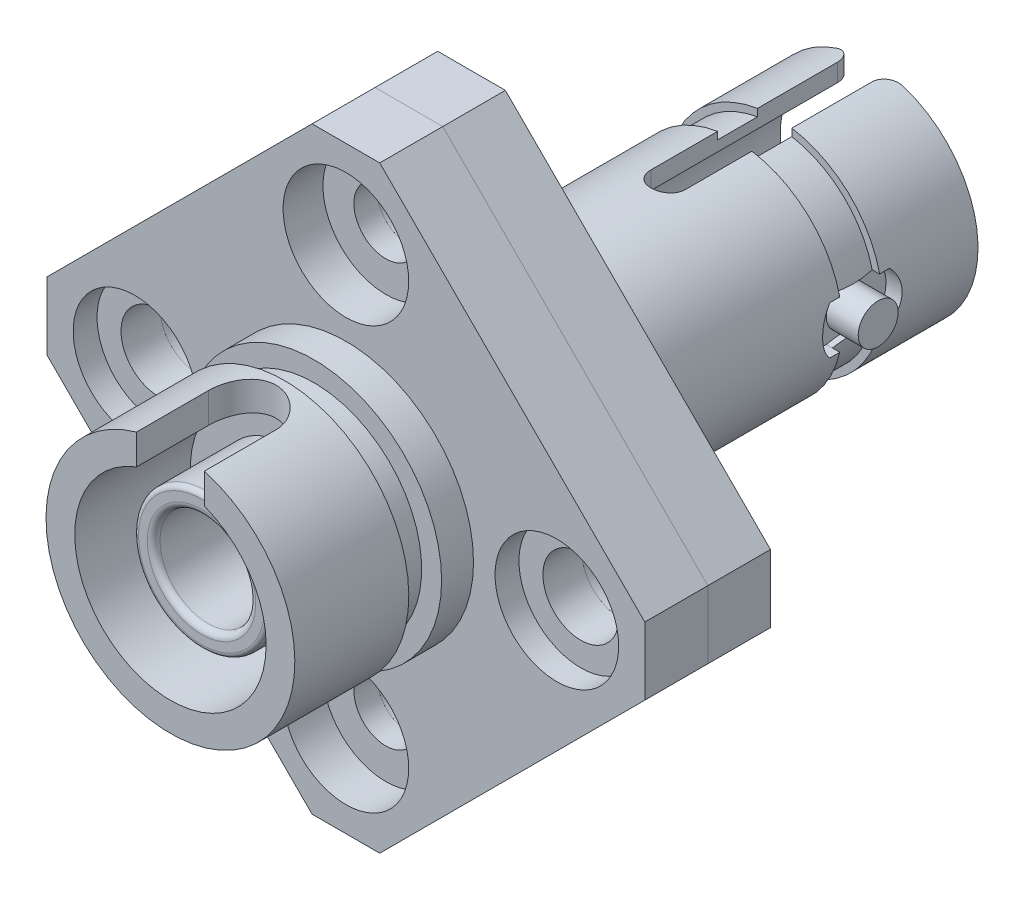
ISO-10303-21;
HEADER;
FILE_DESCRIPTION(('STEP AP214'),'2;1');
FILE_NAME('part.step','',(''),(''),'','','');
FILE_SCHEMA(('AUTOMOTIVE_DESIGN { 1 0 10303 214 1 1 1 1 }'));
ENDSEC;
DATA;
#1=APPLICATION_CONTEXT('core data for automotive mechanical design processes');
#2=APPLICATION_PROTOCOL_DEFINITION('international standard','automotive_design',2000,#1);
#3=PRODUCT_CONTEXT('',#1,'mechanical');
#4=PRODUCT('Part','Part','',(#3));
#5=PRODUCT_RELATED_PRODUCT_CATEGORY('part','',(#4));
#6=PRODUCT_DEFINITION_FORMATION('','',#4);
#7=PRODUCT_DEFINITION_CONTEXT('part definition',#1,'design');
#8=PRODUCT_DEFINITION('design','',#6,#7);
#9=PRODUCT_DEFINITION_SHAPE('','',#8);
#10=(LENGTH_UNIT() NAMED_UNIT(*) SI_UNIT(.MILLI.,.METRE.));
#11=(NAMED_UNIT(*) PLANE_ANGLE_UNIT() SI_UNIT($,.RADIAN.));
#12=(NAMED_UNIT(*) SI_UNIT($,.STERADIAN.) SOLID_ANGLE_UNIT());
#13=UNCERTAINTY_MEASURE_WITH_UNIT(LENGTH_MEASURE(1.E-05),#10,'distance_accuracy_value','');
#14=(GEOMETRIC_REPRESENTATION_CONTEXT(3) GLOBAL_UNCERTAINTY_ASSIGNED_CONTEXT((#13)) GLOBAL_UNIT_ASSIGNED_CONTEXT((#10,
#11,#12)) REPRESENTATION_CONTEXT('',''));
#15=CARTESIAN_POINT('',(0.,0.,0.));
#16=DIRECTION('',(0.,0.,1.));
#17=DIRECTION('',(1.,0.,0.));
#18=AXIS2_PLACEMENT_3D('',#15,#16,#17);
#19=CARTESIAN_POINT('',(0.,-6.71751442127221,4.5974));
#20=DIRECTION('',(0.,0.,-1.));
#21=DIRECTION('',(-0.707106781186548,-0.707106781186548,0.));
#22=AXIS2_PLACEMENT_3D('',#19,#20,#21);
#23=CYLINDRICAL_SURFACE('',#22,1.016);
#24=CARTESIAN_POINT('',(0.,-6.71751442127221,-2.0066));
#25=DIRECTION('',(0.,0.,-1.));
#26=DIRECTION('',(-0.707106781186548,-0.707106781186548,0.));
#27=AXIS2_PLACEMENT_3D('',#24,#25,#26);
#28=CIRCLE('',#27,1.016);
#29=CARTESIAN_POINT('',(-0.718420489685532,-7.43593491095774,-2.0066));
#30=VERTEX_POINT('',#29);
#31=EDGE_CURVE('P0_E1566',#30,#30,#28,.T.);
#32=ORIENTED_EDGE('',*,*,#31,.F.);
#33=EDGE_LOOP('',(#32));
#34=FACE_BOUND('',#33,.T.);
#35=CARTESIAN_POINT('',(0.,-6.71751442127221,-2.7316));
#36=DIRECTION('',(0.,0.,-1.));
#37=DIRECTION('',(-0.707106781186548,-0.707106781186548,0.));
#38=AXIS2_PLACEMENT_3D('',#35,#36,#37);
#39=CIRCLE('',#38,1.016);
#40=CARTESIAN_POINT('',(-0.718420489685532,-7.43593491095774,-2.7316));
#41=VERTEX_POINT('',#40);
#42=EDGE_CURVE('P0_E22',#41,#41,#39,.F.);
#43=ORIENTED_EDGE('',*,*,#42,.F.);
#44=EDGE_LOOP('',(#43));
#45=FACE_BOUND('',#44,.T.);
#46=ADVANCED_FACE('P0_F17',(#34,#45),#23,.F.);
#47=CARTESIAN_POINT('',(0.,6.7175144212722,4.5974));
#48=DIRECTION('',(0.,0.,-1.));
#49=DIRECTION('',(-0.707106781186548,-0.707106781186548,0.));
#50=AXIS2_PLACEMENT_3D('',#47,#48,#49);
#51=CYLINDRICAL_SURFACE('',#50,1.016);
#52=CARTESIAN_POINT('',(0.,6.7175144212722,-2.0066));
#53=DIRECTION('',(0.,0.,-1.));
#54=DIRECTION('',(-0.707106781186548,-0.707106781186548,0.));
#55=AXIS2_PLACEMENT_3D('',#52,#53,#54);
#56=CIRCLE('',#55,1.016);
#57=CARTESIAN_POINT('',(-0.718420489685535,5.99909393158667,-2.0066));
#58=VERTEX_POINT('',#57);
#59=EDGE_CURVE('P0_E1574',#58,#58,#56,.T.);
#60=ORIENTED_EDGE('',*,*,#59,.F.);
#61=EDGE_LOOP('',(#60));
#62=FACE_BOUND('',#61,.T.);
#63=CARTESIAN_POINT('',(0.,6.7175144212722,-2.7316));
#64=DIRECTION('',(0.,0.,-1.));
#65=DIRECTION('',(-0.707106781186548,-0.707106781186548,0.));
#66=AXIS2_PLACEMENT_3D('',#63,#64,#65);
#67=CIRCLE('',#66,1.016);
#68=CARTESIAN_POINT('',(-0.718420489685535,5.99909393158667,-2.7316));
#69=VERTEX_POINT('',#68);
#70=EDGE_CURVE('P0_E1544',#69,#69,#67,.F.);
#71=ORIENTED_EDGE('',*,*,#70,.F.);
#72=EDGE_LOOP('',(#71));
#73=FACE_BOUND('',#72,.T.);
#74=ADVANCED_FACE('P0_F773',(#62,#73),#51,.F.);
#75=CARTESIAN_POINT('',(6.7175144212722,0.,4.5974));
#76=DIRECTION('',(0.,0.,-1.));
#77=DIRECTION('',(-0.707106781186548,-0.707106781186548,0.));
#78=AXIS2_PLACEMENT_3D('',#75,#76,#77);
#79=CYLINDRICAL_SURFACE('',#78,1.2065);
#80=CARTESIAN_POINT('',(6.7175144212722,0.,-2.0066));
#81=DIRECTION('',(0.,0.,-1.));
#82=DIRECTION('',(-0.707106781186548,-0.707106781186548,0.));
#83=AXIS2_PLACEMENT_3D('',#80,#81,#82);
#84=CIRCLE('',#83,1.2065);
#85=CARTESIAN_POINT('',(5.86439008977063,-0.853124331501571,-2.0066));
#86=VERTEX_POINT('',#85);
#87=EDGE_CURVE('P0_E1569',#86,#86,#84,.T.);
#88=ORIENTED_EDGE('',*,*,#87,.F.);
#89=EDGE_LOOP('',(#88));
#90=FACE_BOUND('',#89,.T.);
#91=CARTESIAN_POINT('',(6.7175144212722,0.,-3.2396));
#92=DIRECTION('',(0.,0.,-1.));
#93=DIRECTION('',(-0.707106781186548,-0.707106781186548,0.));
#94=AXIS2_PLACEMENT_3D('',#91,#92,#93);
#95=CIRCLE('',#94,1.2065);
#96=CARTESIAN_POINT('',(5.86439008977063,-0.853124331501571,-3.2396));
#97=VERTEX_POINT('',#96);
#98=EDGE_CURVE('P0_E1534',#97,#97,#95,.F.);
#99=ORIENTED_EDGE('',*,*,#98,.F.);
#100=EDGE_LOOP('',(#99));
#101=FACE_BOUND('',#100,.T.);
#102=ADVANCED_FACE('P0_F779',(#90,#101),#79,.F.);
#103=CARTESIAN_POINT('',(-6.7175144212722,0.,4.5974));
#104=DIRECTION('',(0.,0.,-1.));
#105=DIRECTION('',(-0.707106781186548,-0.707106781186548,0.));
#106=AXIS2_PLACEMENT_3D('',#103,#104,#105);
#107=CYLINDRICAL_SURFACE('',#106,1.2065);
#108=CARTESIAN_POINT('',(-6.7175144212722,0.,-2.0066));
#109=DIRECTION('',(0.,0.,-1.));
#110=DIRECTION('',(-0.707106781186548,-0.707106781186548,0.));
#111=AXIS2_PLACEMENT_3D('',#108,#109,#110);
#112=CIRCLE('',#111,1.2065);
#113=CARTESIAN_POINT('',(-7.57063875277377,-0.853124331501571,-2.0066));
#114=VERTEX_POINT('',#113);
#115=EDGE_CURVE('P0_E1572',#114,#114,#112,.T.);
#116=ORIENTED_EDGE('',*,*,#115,.F.);
#117=EDGE_LOOP('',(#116));
#118=FACE_BOUND('',#117,.T.);
#119=CARTESIAN_POINT('',(-6.7175144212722,0.,-3.2396));
#120=DIRECTION('',(0.,0.,-1.));
#121=DIRECTION('',(-0.707106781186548,-0.707106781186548,0.));
#122=AXIS2_PLACEMENT_3D('',#119,#120,#121);
#123=CIRCLE('',#122,1.2065);
#124=CARTESIAN_POINT('',(-7.57063875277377,-0.853124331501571,-3.2396));
#125=VERTEX_POINT('',#124);
#126=EDGE_CURVE('P0_E1537',#125,#125,#123,.F.);
#127=ORIENTED_EDGE('',*,*,#126,.F.);
#128=EDGE_LOOP('',(#127));
#129=FACE_BOUND('',#128,.T.);
#130=ADVANCED_FACE('P0_F790',(#118,#129),#107,.F.);
#131=CARTESIAN_POINT('',(2.9150714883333,0.,-13.2068649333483));
#132=DIRECTION('',(1.,0.,0.));
#133=DIRECTION('',(0.,-1.,0.));
#134=AXIS2_PLACEMENT_3D('',#131,#132,#133);
#135=PLANE('',#134);
#136=CARTESIAN_POINT('',(2.9150714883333,0.,-13.2068649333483));
#137=DIRECTION('',(1.,0.,0.));
#138=DIRECTION('',(0.,-1.,0.));
#139=AXIS2_PLACEMENT_3D('',#136,#137,#138);
#140=CIRCLE('',#139,1.0776307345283);
#141=CARTESIAN_POINT('',(2.91507148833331,-0.761999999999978,-13.9688649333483));
#142=VERTEX_POINT('',#141);
#143=CARTESIAN_POINT('',(2.9150714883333,0.762000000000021,-13.9688649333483));
#144=VERTEX_POINT('',#143);
#145=EDGE_CURVE('P0_E284',#142,#144,#140,.T.);
#146=ORIENTED_EDGE('',*,*,#145,.T.);
#147=DIRECTION('',(0.,0.,1.));
#148=VECTOR('',#147,1.);
#149=CARTESIAN_POINT('',(2.9150714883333,0.762000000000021,-13.9688649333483));
#150=LINE('',#149,#148);
#151=CARTESIAN_POINT('',(2.9150714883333,0.762000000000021,-13.6631147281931));
#152=VERTEX_POINT('',#151);
#153=EDGE_CURVE('P0_E293',#144,#152,#150,.T.);
#154=ORIENTED_EDGE('',*,*,#153,.T.);
#155=CARTESIAN_POINT('',(2.91507148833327,3.51328879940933,-13.0233573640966));
#156=DIRECTION('',(-1.,0.,0.));
#157=DIRECTION('',(0.,1.,0.));
#158=AXIS2_PLACEMENT_3D('',#155,#156,#157);
#159=CIRCLE('',#158,2.82469105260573);
#160=CARTESIAN_POINT('',(2.9150714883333,0.762000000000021,-12.3836));
#161=VERTEX_POINT('',#160);
#162=EDGE_CURVE('P0_E299',#152,#161,#159,.T.);
#163=ORIENTED_EDGE('',*,*,#162,.T.);
#164=DIRECTION('',(0.,0.,1.));
#165=VECTOR('',#164,1.);
#166=CARTESIAN_POINT('',(2.9150714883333,0.76200000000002,-12.0683350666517));
#167=LINE('',#166,#165);
#168=CARTESIAN_POINT('',(2.9150714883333,0.762000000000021,-12.0683350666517));
#169=VERTEX_POINT('',#168);
#170=EDGE_CURVE('P0_E313',#161,#169,#167,.T.);
#171=ORIENTED_EDGE('',*,*,#170,.T.);
#172=CARTESIAN_POINT('',(2.9150714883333,0.,-12.8303350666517));
#173=DIRECTION('',(1.,0.,0.));
#174=DIRECTION('',(0.,1.,0.));
#175=AXIS2_PLACEMENT_3D('',#172,#173,#174);
#176=CIRCLE('',#175,1.0776307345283);
#177=CARTESIAN_POINT('',(2.91507148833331,-0.761999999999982,-12.0683350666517));
#178=VERTEX_POINT('',#177);
#179=EDGE_CURVE('P0_E316',#169,#178,#176,.T.);
#180=ORIENTED_EDGE('',*,*,#179,.T.);
#181=DIRECTION('',(0.,0.,-1.));
#182=VECTOR('',#181,1.);
#183=CARTESIAN_POINT('',(2.91507148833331,-0.761999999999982,-12.0683350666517));
#184=LINE('',#183,#182);
#185=CARTESIAN_POINT('',(2.91507148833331,-0.761999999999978,-12.3836));
#186=VERTEX_POINT('',#185);
#187=EDGE_CURVE('P0_E319',#178,#186,#184,.T.);
#188=ORIENTED_EDGE('',*,*,#187,.T.);
#189=CARTESIAN_POINT('',(2.91507148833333,-3.51328879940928,-13.0233573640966));
#190=DIRECTION('',(-1.,0.,0.));
#191=DIRECTION('',(0.,-1.,0.));
#192=AXIS2_PLACEMENT_3D('',#189,#190,#191);
#193=CIRCLE('',#192,2.82469105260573);
#194=CARTESIAN_POINT('',(2.91507148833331,-0.761999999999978,-13.6631147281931));
#195=VERTEX_POINT('',#194);
#196=EDGE_CURVE('P0_E322',#186,#195,#193,.T.);
#197=ORIENTED_EDGE('',*,*,#196,.T.);
#198=DIRECTION('',(0.,0.,-1.));
#199=VECTOR('',#198,1.);
#200=CARTESIAN_POINT('',(2.91507148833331,-0.761999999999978,-13.9688649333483));
#201=LINE('',#200,#199);
#202=EDGE_CURVE('P0_E290',#195,#142,#201,.T.);
#203=ORIENTED_EDGE('',*,*,#202,.T.);
#204=EDGE_LOOP('',(#146,#154,#163,#171,#180,#188,#197,#203));
#205=FACE_BOUND('',#204,.T.);
#206=CARTESIAN_POINT('',(2.9150714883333,0.,-13.0186));
#207=DIRECTION('',(1.,0.,0.));
#208=DIRECTION('',(0.,-1.,0.));
#209=AXIS2_PLACEMENT_3D('',#206,#207,#208);
#210=CIRCLE('',#209,0.635000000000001);
#211=CARTESIAN_POINT('',(2.91507148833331,-0.634999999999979,-13.0186));
#212=VERTEX_POINT('',#211);
#213=EDGE_CURVE('P0_E308',#212,#212,#210,.T.);
#214=ORIENTED_EDGE('',*,*,#213,.F.);
#215=EDGE_LOOP('',(#214));
#216=FACE_BOUND('',#215,.T.);
#217=ADVANCED_FACE('P0_F301',(#205,#216),#135,.T.);
#218=CARTESIAN_POINT('',(-2.44115442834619,-2.44115442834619,-13.6536));
#219=DIRECTION('',(0.,0.,1.));
#220=DIRECTION('',(0.707106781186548,0.707106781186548,0.));
#221=AXIS2_PLACEMENT_3D('',#218,#219,#220);
#222=PLANE('',#221);
#223=DIRECTION('',(1.,0.,0.));
#224=VECTOR('',#223,1.);
#225=CARTESIAN_POINT('',(2.91507148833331,-0.759804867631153,-13.6536));
#226=LINE('',#225,#224);
#227=CARTESIAN_POINT('',(3.10675185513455,-0.759804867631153,-13.6536));
#228=VERTEX_POINT('',#227);
#229=CARTESIAN_POINT('',(3.34376099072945,-0.75980486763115,-13.6536));
#230=VERTEX_POINT('',#229);
#231=EDGE_CURVE('P0_E355',#228,#230,#226,.T.);
#232=ORIENTED_EDGE('',*,*,#231,.F.);
#233=CARTESIAN_POINT('',(0.,0.,-13.6536));
#234=DIRECTION('',(0.,0.,-1.));
#235=DIRECTION('',(-0.707106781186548,-0.707106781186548,0.));
#236=AXIS2_PLACEMENT_3D('',#233,#234,#235);
#237=CIRCLE('',#236,3.19831370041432);
#238=CARTESIAN_POINT('',(-3.10675185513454,-0.759804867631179,-13.6536));
#239=VERTEX_POINT('',#238);
#240=EDGE_CURVE('P0_E43',#228,#239,#237,.T.);
#241=ORIENTED_EDGE('',*,*,#240,.T.);
#242=DIRECTION('',(-1.,0.,0.));
#243=VECTOR('',#242,1.);
#244=CARTESIAN_POINT('',(-2.9150714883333,-0.759804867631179,-13.6536));
#245=LINE('',#244,#243);
#246=CARTESIAN_POINT('',(-3.34376099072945,-0.759804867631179,-13.6536));
#247=VERTEX_POINT('',#246);
#248=EDGE_CURVE('P0_E605',#247,#239,#245,.F.);
#249=ORIENTED_EDGE('',*,*,#248,.F.);
#250=CARTESIAN_POINT('',(0.,0.,-13.6536));
#251=DIRECTION('',(0.,0.,1.));
#252=DIRECTION('',(0.707106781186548,0.707106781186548,0.));
#253=AXIS2_PLACEMENT_3D('',#250,#251,#252);
#254=CIRCLE('',#253,3.429);
#255=EDGE_CURVE('P0_E822',#247,#230,#254,.T.);
#256=ORIENTED_EDGE('',*,*,#255,.T.);
#257=EDGE_LOOP('',(#232,#241,#249,#256));
#258=FACE_BOUND('',#257,.T.);
#259=ADVANCED_FACE('P0_F770',(#258),#222,.T.);
#260=CARTESIAN_POINT('',(-2.44115442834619,-2.44115442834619,-12.3836));
#261=DIRECTION('',(0.,0.,-1.));
#262=DIRECTION('',(-0.707106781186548,-0.707106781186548,0.));
#263=AXIS2_PLACEMENT_3D('',#260,#261,#262);
#264=PLANE('',#263);
#265=DIRECTION('',(1.,0.,0.));
#266=VECTOR('',#265,1.);
#267=CARTESIAN_POINT('',(2.91507148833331,-0.761999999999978,-12.3836));
#268=LINE('',#267,#266);
#269=CARTESIAN_POINT('',(3.1062141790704,-0.761999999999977,-12.3836));
#270=VERTEX_POINT('',#269);
#271=CARTESIAN_POINT('',(3.34326143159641,-0.761999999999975,-12.3836));
#272=VERTEX_POINT('',#271);
#273=EDGE_CURVE('P0_E333',#270,#272,#268,.T.);
#274=ORIENTED_EDGE('',*,*,#273,.T.);
#275=CARTESIAN_POINT('',(0.,0.,-12.3836));
#276=DIRECTION('',(0.,0.,-1.));
#277=DIRECTION('',(-0.707106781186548,-0.707106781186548,0.));
#278=AXIS2_PLACEMENT_3D('',#275,#276,#277);
#279=CIRCLE('',#278,3.429);
#280=CARTESIAN_POINT('',(-3.3432614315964,-0.762000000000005,-12.3836));
#281=VERTEX_POINT('',#280);
#282=EDGE_CURVE('P0_E622',#272,#281,#279,.T.);
#283=ORIENTED_EDGE('',*,*,#282,.T.);
#284=DIRECTION('',(-1.,0.,0.));
#285=VECTOR('',#284,1.);
#286=CARTESIAN_POINT('',(-2.9150714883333,-0.762000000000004,-12.3836));
#287=LINE('',#286,#285);
#288=CARTESIAN_POINT('',(-3.10621417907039,-0.762000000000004,-12.3836));
#289=VERTEX_POINT('',#288);
#290=EDGE_CURVE('P0_E610',#289,#281,#287,.T.);
#291=ORIENTED_EDGE('',*,*,#290,.F.);
#292=CARTESIAN_POINT('',(0.,0.,-12.3836));
#293=DIRECTION('',(0.,0.,-1.));
#294=DIRECTION('',(-0.707106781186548,-0.707106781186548,0.));
#295=AXIS2_PLACEMENT_3D('',#292,#293,#294);
#296=CIRCLE('',#295,3.19831370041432);
#297=EDGE_CURVE('P0_E620',#270,#289,#296,.T.);
#298=ORIENTED_EDGE('',*,*,#297,.F.);
#299=EDGE_LOOP('',(#274,#283,#291,#298));
#300=FACE_BOUND('',#299,.T.);
#301=ADVANCED_FACE('P0_F619',(#300),#264,.T.);
#302=CARTESIAN_POINT('',(0.,0.,-16.7016));
#303=DIRECTION('',(0.,0.,-1.));
#304=DIRECTION('',(-0.707106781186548,-0.707106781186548,0.));
#305=AXIS2_PLACEMENT_3D('',#302,#303,#304);
#306=CYLINDRICAL_SURFACE('',#305,3.19831370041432);
#307=CARTESIAN_POINT('',(3.1062141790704,-0.761999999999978,-12.3836));
#308=CARTESIAN_POINT('',(3.11052084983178,-0.744353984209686,-12.4594413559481));
#309=CARTESIAN_POINT('',(3.11394000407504,-0.729853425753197,-12.5360610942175));
#310=CARTESIAN_POINT('',(3.11917051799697,-0.707218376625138,-12.6903225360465));
#311=CARTESIAN_POINT('',(3.12098121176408,-0.699086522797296,-12.767964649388));
#312=CARTESIAN_POINT('',(3.12313789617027,-0.689372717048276,-12.9221808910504));
#313=CARTESIAN_POINT('',(3.12351128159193,-0.687668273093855,-12.9987469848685));
#314=CARTESIAN_POINT('',(3.12289162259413,-0.69048007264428,-13.1517229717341));
#315=CARTESIAN_POINT('',(3.1218993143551,-0.694992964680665,-13.2281329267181));
#316=CARTESIAN_POINT('',(3.11887002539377,-0.708446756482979,-13.3627765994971));
#317=CARTESIAN_POINT('',(3.117126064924,-0.716129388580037,-13.4211459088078));
#318=CARTESIAN_POINT('',(3.11268336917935,-0.735186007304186,-13.5376925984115));
#319=CARTESIAN_POINT('',(3.10997756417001,-0.746587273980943,-13.5958652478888));
#320=CARTESIAN_POINT('',(3.10675185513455,-0.759804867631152,-13.6536));
#321=B_SPLINE_CURVE_WITH_KNOTS('',3,(#307,#308,#309,#310,#311,#312,#313,#314,#315,#316,#317,
#318,#319,#320),.UNSPECIFIED.,.F.,.F.,(4,2,2,2,2,2,4),(0.,0.233882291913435,0.467861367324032,
0.697358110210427,0.926731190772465,1.10330988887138,1.28121426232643),.UNSPECIFIED.);
#322=EDGE_CURVE('P0_E381',#270,#228,#321,.T.);
#323=ORIENTED_EDGE('',*,*,#322,.F.);
#324=ORIENTED_EDGE('',*,*,#297,.T.);
#325=CARTESIAN_POINT('',(-3.10675185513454,-0.759804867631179,-13.6536));
#326=CARTESIAN_POINT('',(-3.11098135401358,-0.742420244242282,-13.5776940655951));
#327=CARTESIAN_POINT('',(-3.11432973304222,-0.728184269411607,-13.5010216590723));
#328=CARTESIAN_POINT('',(-3.1194268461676,-0.706082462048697,-13.3466782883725));
#329=CARTESIAN_POINT('',(-3.12117491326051,-0.698219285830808,-13.2690069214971));
#330=CARTESIAN_POINT('',(-3.12321104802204,-0.689039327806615,-13.1147561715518));
#331=CARTESIAN_POINT('',(-3.12352644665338,-0.687600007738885,-13.0381843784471));
#332=CARTESIAN_POINT('',(-3.12278971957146,-0.690941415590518,-12.8852196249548));
#333=CARTESIAN_POINT('',(-3.12173833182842,-0.695718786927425,-12.808826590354));
#334=CARTESIAN_POINT('',(-3.11859954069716,-0.709638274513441,-12.6742328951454));
#335=CARTESIAN_POINT('',(-3.11680629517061,-0.717522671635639,-12.615892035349));
#336=CARTESIAN_POINT('',(-3.11225936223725,-0.7369817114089,-12.4994159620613));
#337=CARTESIAN_POINT('',(-3.10949856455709,-0.748583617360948,-12.4412855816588));
#338=CARTESIAN_POINT('',(-3.10621417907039,-0.762000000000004,-12.3836));
#339=B_SPLINE_CURVE_WITH_KNOTS('',3,(#325,#326,#327,#328,#329,#330,#331,#332,#333,#334,#335,
#336,#337,#338),.UNSPECIFIED.,.F.,.F.,(4,2,2,2,2,2,4),(0.,0.233882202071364,0.467861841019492,
0.697358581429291,0.926731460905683,1.10330996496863,1.28121428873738),.UNSPECIFIED.);
#340=EDGE_CURVE('P0_E407',#239,#289,#339,.T.);
#341=ORIENTED_EDGE('',*,*,#340,.F.);
#342=ORIENTED_EDGE('',*,*,#240,.F.);
#343=EDGE_LOOP('',(#323,#324,#341,#342));
#344=FACE_BOUND('',#343,.T.);
#345=ADVANCED_FACE('P0_F398',(#344),#306,.T.);
#346=CARTESIAN_POINT('',(-2.9150714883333,0.,-13.2068649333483));
#347=DIRECTION('',(-1.,0.,0.));
#348=DIRECTION('',(0.,1.,0.));
#349=AXIS2_PLACEMENT_3D('',#346,#347,#348);
#350=PLANE('',#349);
#351=CARTESIAN_POINT('',(-2.9150714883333,0.,-13.2068649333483));
#352=DIRECTION('',(-1.,0.,0.));
#353=DIRECTION('',(0.,1.,0.));
#354=AXIS2_PLACEMENT_3D('',#351,#352,#353);
#355=CIRCLE('',#354,1.0776307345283);
#356=CARTESIAN_POINT('',(-2.9150714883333,0.761999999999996,-13.9688649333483));
#357=VERTEX_POINT('',#356);
#358=CARTESIAN_POINT('',(-2.9150714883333,-0.762000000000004,-13.9688649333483));
#359=VERTEX_POINT('',#358);
#360=EDGE_CURVE('P0_E701',#357,#359,#355,.T.);
#361=ORIENTED_EDGE('',*,*,#360,.T.);
#362=DIRECTION('',(0.,0.,1.));
#363=VECTOR('',#362,1.);
#364=CARTESIAN_POINT('',(-2.9150714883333,-0.762000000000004,-13.9688649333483));
#365=LINE('',#364,#363);
#366=CARTESIAN_POINT('',(-2.9150714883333,-0.762000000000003,-13.6631147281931));
#367=VERTEX_POINT('',#366);
#368=EDGE_CURVE('P0_E698',#359,#367,#365,.T.);
#369=ORIENTED_EDGE('',*,*,#368,.T.);
#370=CARTESIAN_POINT('',(-2.9150714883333,-3.51328879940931,-13.0233573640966));
#371=DIRECTION('',(1.,0.,0.));
#372=DIRECTION('',(0.,-1.,0.));
#373=AXIS2_PLACEMENT_3D('',#370,#371,#372);
#374=CIRCLE('',#373,2.82469105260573);
#375=CARTESIAN_POINT('',(-2.9150714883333,-0.762000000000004,-12.3836));
#376=VERTEX_POINT('',#375);
#377=EDGE_CURVE('P0_E696',#367,#376,#374,.T.);
#378=ORIENTED_EDGE('',*,*,#377,.T.);
#379=DIRECTION('',(0.,0.,1.));
#380=VECTOR('',#379,1.);
#381=CARTESIAN_POINT('',(-2.9150714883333,-0.762000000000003,-12.0683350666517));
#382=LINE('',#381,#380);
#383=CARTESIAN_POINT('',(-2.9150714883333,-0.762000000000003,-12.0683350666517));
#384=VERTEX_POINT('',#383);
#385=EDGE_CURVE('P0_E612',#376,#384,#382,.T.);
#386=ORIENTED_EDGE('',*,*,#385,.T.);
#387=CARTESIAN_POINT('',(-2.9150714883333,0.,-12.8303350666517));
#388=DIRECTION('',(-1.,0.,0.));
#389=DIRECTION('',(0.,-1.,0.));
#390=AXIS2_PLACEMENT_3D('',#387,#388,#389);
#391=CIRCLE('',#390,1.0776307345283);
#392=CARTESIAN_POINT('',(-2.9150714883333,0.762,-12.0683350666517));
#393=VERTEX_POINT('',#392);
#394=EDGE_CURVE('P0_E693',#384,#393,#391,.T.);
#395=ORIENTED_EDGE('',*,*,#394,.T.);
#396=DIRECTION('',(0.,0.,-1.));
#397=VECTOR('',#396,1.);
#398=CARTESIAN_POINT('',(-2.9150714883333,0.762,-12.0683350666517));
#399=LINE('',#398,#397);
#400=CARTESIAN_POINT('',(-2.9150714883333,0.761999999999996,-12.3836));
#401=VERTEX_POINT('',#400);
#402=EDGE_CURVE('P0_E675',#393,#401,#399,.T.);
#403=ORIENTED_EDGE('',*,*,#402,.T.);
#404=CARTESIAN_POINT('',(-2.91507148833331,3.5132887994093,-13.0233573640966));
#405=DIRECTION('',(1.,0.,0.));
#406=DIRECTION('',(0.,1.,0.));
#407=AXIS2_PLACEMENT_3D('',#404,#405,#406);
#408=CIRCLE('',#407,2.82469105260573);
#409=CARTESIAN_POINT('',(-2.9150714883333,0.761999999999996,-13.6631147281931));
#410=VERTEX_POINT('',#409);
#411=EDGE_CURVE('P0_E689',#401,#410,#408,.T.);
#412=ORIENTED_EDGE('',*,*,#411,.T.);
#413=DIRECTION('',(0.,0.,-1.));
#414=VECTOR('',#413,1.);
#415=CARTESIAN_POINT('',(-2.9150714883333,0.761999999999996,-13.9688649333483));
#416=LINE('',#415,#414);
#417=EDGE_CURVE('P0_E632',#410,#357,#416,.T.);
#418=ORIENTED_EDGE('',*,*,#417,.T.);
#419=EDGE_LOOP('',(#361,#369,#378,#386,#395,#403,#412,#418));
#420=FACE_BOUND('',#419,.T.);
#421=CARTESIAN_POINT('',(-2.9150714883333,0.,-13.0186));
#422=DIRECTION('',(-1.,0.,0.));
#423=DIRECTION('',(0.,1.,0.));
#424=AXIS2_PLACEMENT_3D('',#421,#422,#423);
#425=CIRCLE('',#424,0.635000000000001);
#426=CARTESIAN_POINT('',(-2.9150714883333,0.634999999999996,-13.0186));
#427=VERTEX_POINT('',#426);
#428=EDGE_CURVE('P0_E705',#427,#427,#425,.T.);
#429=ORIENTED_EDGE('',*,*,#428,.F.);
#430=EDGE_LOOP('',(#429));
#431=FACE_BOUND('',#430,.T.);
#432=ADVANCED_FACE('P0_F759',(#420,#431),#350,.T.);
#433=DIRECTION('',(-1.,0.,0.));
#434=VECTOR('',#433,1.);
#435=CARTESIAN_POINT('',(-2.9150714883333,0.759804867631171,-13.6536));
#436=LINE('',#435,#434);
#437=CARTESIAN_POINT('',(-3.10675185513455,0.759804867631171,-13.6536));
#438=VERTEX_POINT('',#437);
#439=CARTESIAN_POINT('',(-3.34376099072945,0.759804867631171,-13.6536));
#440=VERTEX_POINT('',#439);
#441=EDGE_CURVE('P0_E452',#438,#440,#436,.T.);
#442=ORIENTED_EDGE('',*,*,#441,.F.);
#443=CARTESIAN_POINT('',(-0.5461,3.15134658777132,-13.6536));
#444=VERTEX_POINT('',#443);
#445=EDGE_CURVE('P0_E845',#438,#444,#237,.T.);
#446=ORIENTED_EDGE('',*,*,#445,.T.);
#447=DIRECTION('',(0.,-1.,0.));
#448=VECTOR('',#447,1.);
#449=CARTESIAN_POINT('',(-0.5461,-2.44115442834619,-13.6536));
#450=LINE('',#449,#448);
#451=CARTESIAN_POINT('',(-0.546099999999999,3.38523496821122,-13.6536));
#452=VERTEX_POINT('',#451);
#453=EDGE_CURVE('P0_E482',#452,#444,#450,.T.);
#454=ORIENTED_EDGE('',*,*,#453,.F.);
#455=EDGE_CURVE('P0_E586',#452,#440,#254,.T.);
#456=ORIENTED_EDGE('',*,*,#455,.T.);
#457=EDGE_LOOP('',(#442,#446,#454,#456));
#458=FACE_BOUND('',#457,.T.);
#459=ADVANCED_FACE('P0_F761',(#458),#222,.T.);
#460=DIRECTION('',(-1.,0.,0.));
#461=VECTOR('',#460,1.);
#462=CARTESIAN_POINT('',(-2.9150714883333,0.761999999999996,-12.3836));
#463=LINE('',#462,#461);
#464=CARTESIAN_POINT('',(-3.1062141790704,0.761999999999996,-12.3836));
#465=VERTEX_POINT('',#464);
#466=CARTESIAN_POINT('',(-3.3432614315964,0.761999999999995,-12.3836));
#467=VERTEX_POINT('',#466);
#468=EDGE_CURVE('P0_E677',#465,#467,#463,.T.);
#469=ORIENTED_EDGE('',*,*,#468,.T.);
#470=CARTESIAN_POINT('',(-0.546099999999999,3.38523496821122,-12.3836));
#471=VERTEX_POINT('',#470);
#472=EDGE_CURVE('P0_E828',#467,#471,#279,.T.);
#473=ORIENTED_EDGE('',*,*,#472,.T.);
#474=DIRECTION('',(0.,1.,0.));
#475=VECTOR('',#474,1.);
#476=CARTESIAN_POINT('',(-0.5461,-2.44115442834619,-12.3836));
#477=LINE('',#476,#475);
#478=CARTESIAN_POINT('',(-0.5461,3.15134658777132,-12.3836));
#479=VERTEX_POINT('',#478);
#480=EDGE_CURVE('P0_E479',#479,#471,#477,.T.);
#481=ORIENTED_EDGE('',*,*,#480,.F.);
#482=EDGE_CURVE('P0_E501',#465,#479,#296,.T.);
#483=ORIENTED_EDGE('',*,*,#482,.F.);
#484=EDGE_LOOP('',(#469,#473,#481,#483));
#485=FACE_BOUND('',#484,.T.);
#486=ADVANCED_FACE('P0_F768',(#485),#264,.T.);
#487=CARTESIAN_POINT('',(-3.10621417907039,0.761999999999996,-12.3836));
#488=CARTESIAN_POINT('',(-3.11052084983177,0.744353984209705,-12.4594413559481));
#489=CARTESIAN_POINT('',(-3.11394000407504,0.729853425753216,-12.5360610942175));
#490=CARTESIAN_POINT('',(-3.11917051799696,0.707218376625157,-12.6903225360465));
#491=CARTESIAN_POINT('',(-3.12098121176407,0.699086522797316,-12.767964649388));
#492=CARTESIAN_POINT('',(-3.12313789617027,0.689372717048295,-12.9221808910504));
#493=CARTESIAN_POINT('',(-3.12351128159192,0.687668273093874,-12.9987469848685));
#494=CARTESIAN_POINT('',(-3.12289162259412,0.690480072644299,-13.1517229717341));
#495=CARTESIAN_POINT('',(-3.1218993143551,0.694992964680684,-13.2281329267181));
#496=CARTESIAN_POINT('',(-3.11887002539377,0.708446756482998,-13.3627765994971));
#497=CARTESIAN_POINT('',(-3.11712606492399,0.716129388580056,-13.4211459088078));
#498=CARTESIAN_POINT('',(-3.11268336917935,0.735186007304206,-13.5376925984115));
#499=CARTESIAN_POINT('',(-3.10997756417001,0.746587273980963,-13.5958652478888));
#500=CARTESIAN_POINT('',(-3.10675185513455,0.759804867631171,-13.6536));
#501=B_SPLINE_CURVE_WITH_KNOTS('',3,(#487,#488,#489,#490,#491,#492,#493,#494,#495,#496,#497,
#498,#499,#500),.UNSPECIFIED.,.F.,.F.,(4,2,2,2,2,2,4),(0.,0.233882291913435,0.467861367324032,
0.697358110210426,0.926731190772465,1.10330988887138,1.28121426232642),.UNSPECIFIED.);
#502=EDGE_CURVE('P0_E416',#465,#438,#501,.T.);
#503=ORIENTED_EDGE('',*,*,#502,.F.);
#504=ORIENTED_EDGE('',*,*,#482,.T.);
#505=DIRECTION('',(0.,0.,-1.));
#506=VECTOR('',#505,1.);
#507=CARTESIAN_POINT('',(-0.5461,3.15134658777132,-16.7016));
#508=LINE('',#507,#506);
#509=EDGE_CURVE('P0_E525',#444,#479,#508,.F.);
#510=ORIENTED_EDGE('',*,*,#509,.F.);
#511=ORIENTED_EDGE('',*,*,#445,.F.);
#512=EDGE_LOOP('',(#503,#504,#510,#511));
#513=FACE_BOUND('',#512,.T.);
#514=ADVANCED_FACE('P0_F399',(#513),#306,.T.);
#515=CARTESIAN_POINT('',(0.,0.,-16.7016));
#516=DIRECTION('',(0.,0.,1.));
#517=DIRECTION('',(0.707106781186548,0.707106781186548,0.));
#518=AXIS2_PLACEMENT_3D('',#515,#516,#517);
#519=CYLINDRICAL_SURFACE('',#518,3.429);
#520=DIRECTION('',(0.,0.,1.));
#521=VECTOR('',#520,1.);
#522=CARTESIAN_POINT('',(3.34326143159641,-0.761999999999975,-16.7016));
#523=LINE('',#522,#521);
#524=CARTESIAN_POINT('',(3.34326143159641,-0.761999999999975,-13.9688649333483));
#525=VERTEX_POINT('',#524);
#526=CARTESIAN_POINT('',(3.34326143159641,-0.761999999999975,-13.6631147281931));
#527=VERTEX_POINT('',#526);
#528=EDGE_CURVE('P0_E11',#525,#527,#523,.T.);
#529=ORIENTED_EDGE('',*,*,#528,.T.);
#530=CARTESIAN_POINT('',(3.34326143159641,-0.761999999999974,-13.6631147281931));
#531=CARTESIAN_POINT('',(3.34334543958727,-0.761631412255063,-13.6615296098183));
#532=CARTESIAN_POINT('',(3.34342907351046,-0.761264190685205,-13.6599441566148));
#533=CARTESIAN_POINT('',(3.34359559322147,-0.760532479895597,-13.6567725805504));
#534=CARTESIAN_POINT('',(3.3436784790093,-0.760167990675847,-13.6551864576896));
#535=CARTESIAN_POINT('',(3.34376099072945,-0.75980486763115,-13.6536));
#536=B_SPLINE_CURVE_WITH_KNOTS('',3,(#530,#531,#532,#533,#534,#535),.UNSPECIFIED.,.F.,.F.,(4,2,
4),(0.,0.00488871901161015,0.00977743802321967),.UNSPECIFIED.);
#537=EDGE_CURVE('P0_E715',#527,#230,#536,.T.);
#538=ORIENTED_EDGE('',*,*,#537,.T.);
#539=ORIENTED_EDGE('',*,*,#255,.F.);
#540=CARTESIAN_POINT('',(-3.34376099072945,-0.75980486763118,-13.6536));
#541=CARTESIAN_POINT('',(-3.3436784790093,-0.760167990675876,-13.6551864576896));
#542=CARTESIAN_POINT('',(-3.34359559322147,-0.760532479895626,-13.6567725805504));
#543=CARTESIAN_POINT('',(-3.34342907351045,-0.761264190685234,-13.6599441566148));
#544=CARTESIAN_POINT('',(-3.34334543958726,-0.761631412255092,-13.6615296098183));
#545=CARTESIAN_POINT('',(-3.3432614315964,-0.762000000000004,-13.6631147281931));
#546=B_SPLINE_CURVE_WITH_KNOTS('',3,(#540,#541,#542,#543,#544,#545),.UNSPECIFIED.,.F.,.F.,(4,2,
4),(0.,0.00488871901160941,0.00977743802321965),.UNSPECIFIED.);
#547=CARTESIAN_POINT('',(-3.3432614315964,-0.762000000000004,-13.6631147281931));
#548=VERTEX_POINT('',#547);
#549=EDGE_CURVE('P0_E633',#247,#548,#546,.T.);
#550=ORIENTED_EDGE('',*,*,#549,.T.);
#551=DIRECTION('',(0.,0.,1.));
#552=VECTOR('',#551,1.);
#553=CARTESIAN_POINT('',(-3.3432614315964,-0.762000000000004,-16.7016));
#554=LINE('',#553,#552);
#555=CARTESIAN_POINT('',(-3.3432614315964,-0.762000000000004,-13.9688649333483));
#556=VERTEX_POINT('',#555);
#557=EDGE_CURVE('P0_E660',#548,#556,#554,.F.);
#558=ORIENTED_EDGE('',*,*,#557,.T.);
#559=CARTESIAN_POINT('',(-3.3432614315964,-0.762000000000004,-13.9688649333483));
#560=CARTESIAN_POINT('',(-3.35295853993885,-0.719573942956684,-14.0113444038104));
#561=CARTESIAN_POINT('',(-3.36257911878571,-0.673527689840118,-14.0502436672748));
#562=CARTESIAN_POINT('',(-3.38073501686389,-0.575423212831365,-14.1199808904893));
#563=CARTESIAN_POINT('',(-3.38926911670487,-0.523358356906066,-14.1508098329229));
#564=CARTESIAN_POINT('',(-3.40430494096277,-0.414466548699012,-14.2034448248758));
#565=CARTESIAN_POINT('',(-3.41080370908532,-0.357632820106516,-14.2252377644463));
#566=CARTESIAN_POINT('',(-3.42102602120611,-0.240920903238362,-14.2589716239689));
#567=CARTESIAN_POINT('',(-3.42475220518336,-0.18104566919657,-14.2709219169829));
#568=CARTESIAN_POINT('',(-3.42894453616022,-0.0618705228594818,-14.2843371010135));
#569=CARTESIAN_POINT('',(-3.42950651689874,-0.00260862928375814,-14.2861102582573));
#570=CARTESIAN_POINT('',(-3.42756649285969,0.115363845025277,-14.279929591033));
#571=CARTESIAN_POINT('',(-3.42506408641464,0.174074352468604,-14.2719744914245));
#572=CARTESIAN_POINT('',(-3.41734524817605,0.288093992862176,-14.2468809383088));
#573=CARTESIAN_POINT('',(-3.41218248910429,0.343447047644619,-14.2299239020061));
#574=CARTESIAN_POINT('',(-3.39970153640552,0.450530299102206,-14.1874905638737));
#575=CARTESIAN_POINT('',(-3.39238322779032,0.502260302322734,-14.1620138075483));
#576=CARTESIAN_POINT('',(-3.37809592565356,0.589937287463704,-14.1097836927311));
#577=CARTESIAN_POINT('',(-3.37140598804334,0.626848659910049,-14.0845516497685));
#578=CARTESIAN_POINT('',(-3.35757470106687,0.69715392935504,-14.0298160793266));
#579=CARTESIAN_POINT('',(-3.35043418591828,0.730554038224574,-14.0003203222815));
#580=CARTESIAN_POINT('',(-3.3432614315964,0.761999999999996,-13.9688649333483));
#581=B_SPLINE_CURVE_WITH_KNOTS('',3,(#559,#560,#561,#562,#563,#564,#565,#566,#567,#568,#569,
#570,#571,#572,#573,#574,#575,#576,#577,#578,#579,#580),.UNSPECIFIED.,.F.,.F.,(4,2,2,2,2,2,2,2,
2,2,4),(0.,0.182264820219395,0.364732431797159,0.547463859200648,0.730021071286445,
0.907018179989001,1.08403849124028,1.25761964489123,1.43121005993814,1.56650799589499,
1.70156239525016),.UNSPECIFIED.);
#582=CARTESIAN_POINT('',(-3.3432614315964,0.761999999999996,-13.9688649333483));
#583=VERTEX_POINT('',#582);
#584=EDGE_CURVE('P0_E654',#556,#583,#581,.T.);
#585=ORIENTED_EDGE('',*,*,#584,.T.);
#586=DIRECTION('',(0.,0.,1.));
#587=VECTOR('',#586,1.);
#588=CARTESIAN_POINT('',(-3.3432614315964,0.761999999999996,-16.7016));
#589=LINE('',#588,#587);
#590=CARTESIAN_POINT('',(-3.3432614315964,0.761999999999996,-13.6631147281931));
#591=VERTEX_POINT('',#590);
#592=EDGE_CURVE('P0_E382',#583,#591,#589,.T.);
#593=ORIENTED_EDGE('',*,*,#592,.T.);
#594=CARTESIAN_POINT('',(-3.3432614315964,0.761999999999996,-13.6631147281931));
#595=CARTESIAN_POINT('',(-3.34334543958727,0.761631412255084,-13.6615296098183));
#596=CARTESIAN_POINT('',(-3.34342907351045,0.761264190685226,-13.6599441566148));
#597=CARTESIAN_POINT('',(-3.34359559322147,0.760532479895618,-13.6567725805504));
#598=CARTESIAN_POINT('',(-3.3436784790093,0.760167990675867,-13.6551864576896));
#599=CARTESIAN_POINT('',(-3.34376099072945,0.759804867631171,-13.6536));
#600=B_SPLINE_CURVE_WITH_KNOTS('',3,(#594,#595,#596,#597,#598,#599),.UNSPECIFIED.,.F.,.F.,(4,2,
4),(0.,0.00488871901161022,0.00977743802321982),.UNSPECIFIED.);
#601=EDGE_CURVE('P0_E443',#591,#440,#600,.T.);
#602=ORIENTED_EDGE('',*,*,#601,.T.);
#603=ORIENTED_EDGE('',*,*,#455,.F.);
#604=DIRECTION('',(0.,0.,1.));
#605=VECTOR('',#604,1.);
#606=CARTESIAN_POINT('',(-0.5461,3.38523496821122,-16.7016));
#607=LINE('',#606,#605);
#608=CARTESIAN_POINT('',(-0.5461,3.38523496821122,-16.1936));
#609=VERTEX_POINT('',#608);
#610=EDGE_CURVE('P0_E488',#452,#609,#607,.F.);
#611=ORIENTED_EDGE('',*,*,#610,.T.);
#612=CARTESIAN_POINT('',(-0.546099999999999,3.38523496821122,-16.1936));
#613=CARTESIAN_POINT('',(-0.546074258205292,3.38522905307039,-16.221834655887));
#614=CARTESIAN_POINT('',(-0.548452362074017,3.38485532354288,-16.2500618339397));
#615=CARTESIAN_POINT('',(-0.557826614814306,3.38332839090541,-16.3056916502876));
#616=CARTESIAN_POINT('',(-0.564818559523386,3.38217589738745,-16.333095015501));
#617=CARTESIAN_POINT('',(-0.5832358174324,3.37904700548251,-16.3863343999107));
#618=CARTESIAN_POINT('',(-0.594663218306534,3.37707021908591,-16.4121696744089));
#619=CARTESIAN_POINT('',(-0.621585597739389,3.372218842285,-16.4615270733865));
#620=CARTESIAN_POINT('',(-0.637079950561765,3.36934438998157,-16.4850495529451));
#621=CARTESIAN_POINT('',(-0.671679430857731,3.36261764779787,-16.5291677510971));
#622=CARTESIAN_POINT('',(-0.690790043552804,3.35876386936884,-16.5497589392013));
#623=CARTESIAN_POINT('',(-0.732004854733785,3.35002280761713,-16.5874249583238));
#624=CARTESIAN_POINT('',(-0.754109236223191,3.34513546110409,-16.6044995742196));
#625=CARTESIAN_POINT('',(-0.800853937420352,3.33425474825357,-16.6348653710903));
#626=CARTESIAN_POINT('',(-0.825517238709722,3.32825089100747,-16.648117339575));
#627=CARTESIAN_POINT('',(-0.8764512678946,3.31520206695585,-16.6703355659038));
#628=CARTESIAN_POINT('',(-0.902722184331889,3.30815697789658,-16.6793013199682));
#629=CARTESIAN_POINT('',(-0.949926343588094,3.29486495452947,-16.6912549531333));
#630=CARTESIAN_POINT('',(-0.970691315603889,3.28880937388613,-16.6951451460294));
#631=CARTESIAN_POINT('',(-1.01235963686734,3.27622473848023,-16.7003175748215));
#632=CARTESIAN_POINT('',(-1.03326265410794,3.26969659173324,-16.7016046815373));
#633=CARTESIAN_POINT('',(-1.0541,3.26296095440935,-16.7016));
#634=B_SPLINE_CURVE_WITH_KNOTS('',3,(#612,#613,#614,#615,#616,#617,#618,#619,#620,#621,#622,
#623,#624,#625,#626,#627,#628,#629,#630,#631,#632,#633),.UNSPECIFIED.,.F.,.F.,(4,2,2,2,2,2,2,2,
2,2,4),(0.,0.0845907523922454,0.169104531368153,0.253658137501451,0.33819874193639,
0.422868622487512,0.507543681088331,0.593058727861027,0.678583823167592,0.744359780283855,
0.810012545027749),.UNSPECIFIED.);
#635=CARTESIAN_POINT('',(-1.0541,3.26296095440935,-16.7016));
#636=VERTEX_POINT('',#635);
#637=EDGE_CURVE('P0_E560',#609,#636,#634,.T.);
#638=ORIENTED_EDGE('',*,*,#637,.T.);
#639=CARTESIAN_POINT('',(0.,0.,-16.7016));
#640=DIRECTION('',(0.,0.,-1.));
#641=DIRECTION('',(-0.707106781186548,-0.707106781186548,0.));
#642=AXIS2_PLACEMENT_3D('',#639,#640,#641);
#643=CIRCLE('',#642,3.429);
#644=CARTESIAN_POINT('',(1.0541,3.26296095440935,-16.7016));
#645=VERTEX_POINT('',#644);
#646=EDGE_CURVE('P0_E580',#645,#636,#643,.T.);
#647=ORIENTED_EDGE('',*,*,#646,.F.);
#648=CARTESIAN_POINT('',(1.0541,3.26296095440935,-16.7016));
#649=CARTESIAN_POINT('',(1.02556126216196,3.27219651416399,-16.701625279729));
#650=CARTESIAN_POINT('',(0.996877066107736,3.2810336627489,-16.6991954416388));
#651=CARTESIAN_POINT('',(0.940038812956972,3.29775960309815,-16.6894623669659));
#652=CARTESIAN_POINT('',(0.911885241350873,3.30564755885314,-16.6821548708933));
#653=CARTESIAN_POINT('',(0.856935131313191,3.32031942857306,-16.6626867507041));
#654=CARTESIAN_POINT('',(0.830141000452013,3.3271014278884,-16.6505178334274));
#655=CARTESIAN_POINT('',(0.77887558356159,3.3394741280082,-16.6215956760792));
#656=CARTESIAN_POINT('',(0.754402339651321,3.34506583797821,-16.6048463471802));
#657=CARTESIAN_POINT('',(0.709347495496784,3.35490437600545,-16.5678094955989));
#658=CARTESIAN_POINT('',(0.688665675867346,3.35918883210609,-16.5476538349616));
#659=CARTESIAN_POINT('',(0.650933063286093,3.36670435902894,-16.5040069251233));
#660=CARTESIAN_POINT('',(0.633883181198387,3.36993516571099,-16.4805148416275));
#661=CARTESIAN_POINT('',(0.60433151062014,3.37535863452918,-16.4314536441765));
#662=CARTESIAN_POINT('',(0.591735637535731,3.37757311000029,-16.4059434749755));
#663=CARTESIAN_POINT('',(0.570968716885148,3.38114589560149,-16.3531355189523));
#664=CARTESIAN_POINT('',(0.562794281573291,3.38250486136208,-16.3258391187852));
#665=CARTESIAN_POINT('',(0.553347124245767,3.38405984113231,-16.2808882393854));
#666=CARTESIAN_POINT('',(0.550630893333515,3.38450177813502,-16.2635320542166));
#667=CARTESIAN_POINT('',(0.54700782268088,3.38508855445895,-16.228653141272));
#668=CARTESIAN_POINT('',(0.546098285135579,3.38523383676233,-16.2111307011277));
#669=CARTESIAN_POINT('',(0.546100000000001,3.38523496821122,-16.1936));
#670=B_SPLINE_CURVE_WITH_KNOTS('',3,(#648,#649,#650,#651,#652,#653,#654,#655,#656,#657,#658,
#659,#660,#661,#662,#663,#664,#665,#666,#667,#668,#669),.UNSPECIFIED.,.F.,.F.,(4,2,2,2,2,2,2,2,
2,2,4),(0.,0.0899106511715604,0.179899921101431,0.270043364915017,0.360110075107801,
0.447265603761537,0.534442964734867,0.619649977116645,0.704791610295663,0.757421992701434,
0.809973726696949),.UNSPECIFIED.);
#671=CARTESIAN_POINT('',(0.546100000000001,3.38523496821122,-16.1936));
#672=VERTEX_POINT('',#671);
#673=EDGE_CURVE('P0_E566',#645,#672,#670,.T.);
#674=ORIENTED_EDGE('',*,*,#673,.T.);
#675=DIRECTION('',(0.,0.,1.));
#676=VECTOR('',#675,1.);
#677=CARTESIAN_POINT('',(0.546100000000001,3.38523496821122,-16.7016));
#678=LINE('',#677,#676);
#679=CARTESIAN_POINT('',(0.546100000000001,3.38523496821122,-13.6536));
#680=VERTEX_POINT('',#679);
#681=EDGE_CURVE('P0_E473',#672,#680,#678,.T.);
#682=ORIENTED_EDGE('',*,*,#681,.T.);
#683=CARTESIAN_POINT('',(3.34376099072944,0.759804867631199,-13.6536));
#684=VERTEX_POINT('',#683);
#685=EDGE_CURVE('P0_E819',#684,#680,#254,.T.);
#686=ORIENTED_EDGE('',*,*,#685,.F.);
#687=CARTESIAN_POINT('',(3.34376099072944,0.7598048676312,-13.6536));
#688=CARTESIAN_POINT('',(3.34367847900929,0.760167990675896,-13.6551864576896));
#689=CARTESIAN_POINT('',(3.34359559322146,0.760532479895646,-13.6567725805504));
#690=CARTESIAN_POINT('',(3.34342907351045,0.761264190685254,-13.6599441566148));
#691=CARTESIAN_POINT('',(3.34334543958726,0.761631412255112,-13.6615296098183));
#692=CARTESIAN_POINT('',(3.34326143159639,0.762000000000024,-13.6631147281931));
#693=B_SPLINE_CURVE_WITH_KNOTS('',3,(#687,#688,#689,#690,#691,#692),.UNSPECIFIED.,.F.,.F.,(4,2,
4),(0.,0.00488871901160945,0.00977743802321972),.UNSPECIFIED.);
#694=CARTESIAN_POINT('',(3.34326143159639,0.762000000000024,-13.6631147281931));
#695=VERTEX_POINT('',#694);
#696=EDGE_CURVE('P0_E346',#684,#695,#693,.T.);
#697=ORIENTED_EDGE('',*,*,#696,.T.);
#698=DIRECTION('',(0.,0.,1.));
#699=VECTOR('',#698,1.);
#700=CARTESIAN_POINT('',(3.34326143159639,0.762000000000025,-16.7016));
#701=LINE('',#700,#699);
#702=CARTESIAN_POINT('',(3.34326143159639,0.762000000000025,-13.9688649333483));
#703=VERTEX_POINT('',#702);
#704=EDGE_CURVE('P0_E743',#695,#703,#701,.F.);
#705=ORIENTED_EDGE('',*,*,#704,.T.);
#706=CARTESIAN_POINT('',(3.34326143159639,0.762000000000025,-13.9688649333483));
#707=CARTESIAN_POINT('',(3.35295853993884,0.719573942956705,-14.0113444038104));
#708=CARTESIAN_POINT('',(3.36257911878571,0.673527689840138,-14.0502436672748));
#709=CARTESIAN_POINT('',(3.38073501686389,0.575423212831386,-14.1199808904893));
#710=CARTESIAN_POINT('',(3.38926911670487,0.523358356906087,-14.1508098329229));
#711=CARTESIAN_POINT('',(3.40430494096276,0.414466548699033,-14.2034448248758));
#712=CARTESIAN_POINT('',(3.41080370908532,0.357632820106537,-14.2252377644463));
#713=CARTESIAN_POINT('',(3.42102602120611,0.240920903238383,-14.2589716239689));
#714=CARTESIAN_POINT('',(3.42475220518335,0.181045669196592,-14.2709219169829));
#715=CARTESIAN_POINT('',(3.42894453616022,0.061870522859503,-14.2843371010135));
#716=CARTESIAN_POINT('',(3.42950651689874,0.00260862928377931,-14.2861102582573));
#717=CARTESIAN_POINT('',(3.42756649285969,-0.115363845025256,-14.279929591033));
#718=CARTESIAN_POINT('',(3.42506408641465,-0.174074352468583,-14.2719744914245));
#719=CARTESIAN_POINT('',(3.41734524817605,-0.288093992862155,-14.2468809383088));
#720=CARTESIAN_POINT('',(3.4121824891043,-0.343447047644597,-14.2299239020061));
#721=CARTESIAN_POINT('',(3.39970153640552,-0.450530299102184,-14.1874905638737));
#722=CARTESIAN_POINT('',(3.39238322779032,-0.502260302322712,-14.1620138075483));
#723=CARTESIAN_POINT('',(3.37809592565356,-0.589937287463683,-14.1097836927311));
#724=CARTESIAN_POINT('',(3.37140598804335,-0.626848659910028,-14.0845516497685));
#725=CARTESIAN_POINT('',(3.35757470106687,-0.697153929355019,-14.0298160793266));
#726=CARTESIAN_POINT('',(3.35043418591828,-0.730554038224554,-14.0003203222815));
#727=CARTESIAN_POINT('',(3.34326143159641,-0.761999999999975,-13.9688649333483));
#728=B_SPLINE_CURVE_WITH_KNOTS('',3,(#706,#707,#708,#709,#710,#711,#712,#713,#714,#715,#716,
#717,#718,#719,#720,#721,#722,#723,#724,#725,#726,#727),.UNSPECIFIED.,.F.,.F.,(4,2,2,2,2,2,2,2,
2,2,4),(0.,0.182264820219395,0.364732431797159,0.547463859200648,0.730021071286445,
0.907018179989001,1.08403849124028,1.25761964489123,1.43121005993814,1.56650799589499,
1.70156239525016),.UNSPECIFIED.);
#729=EDGE_CURVE('P0_E27',#703,#525,#728,.T.);
#730=ORIENTED_EDGE('',*,*,#729,.T.);
#731=EDGE_LOOP('',(#529,#538,#539,#550,#558,#585,#593,#602,#603,#611,#638,#647,#674,#682,#686,
#697,#705,#730));
#732=FACE_BOUND('',#731,.T.);
#733=ADVANCED_FACE('P0_F357',(#732),#519,.T.);
#734=CARTESIAN_POINT('',(0.,0.,-4.0016));
#735=DIRECTION('',(0.,0.,-1.));
#736=DIRECTION('',(-0.707106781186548,-0.707106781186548,0.));
#737=AXIS2_PLACEMENT_3D('',#734,#735,#736);
#738=CIRCLE('',#737,3.429);
#739=CARTESIAN_POINT('',(-2.42466915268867,-2.42466915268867,-4.0016));
#740=VERTEX_POINT('',#739);
#741=EDGE_CURVE('P0_E908',#740,#740,#738,.T.);
#742=ORIENTED_EDGE('',*,*,#741,.T.);
#743=EDGE_LOOP('',(#742));
#744=FACE_BOUND('',#743,.T.);
#745=ORIENTED_EDGE('',*,*,#282,.F.);
#746=DIRECTION('',(0.,0.,1.));
#747=VECTOR('',#746,1.);
#748=CARTESIAN_POINT('',(3.34326143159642,-0.761999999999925,-16.7016));
#749=LINE('',#748,#747);
#750=CARTESIAN_POINT('',(3.3432614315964,-0.761999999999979,-12.0683350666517));
#751=VERTEX_POINT('',#750);
#752=EDGE_CURVE('P0_E708',#272,#751,#749,.T.);
#753=ORIENTED_EDGE('',*,*,#752,.T.);
#754=CARTESIAN_POINT('',(3.34326143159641,-0.761999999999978,-12.0683350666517));
#755=CARTESIAN_POINT('',(3.35295853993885,-0.719573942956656,-12.0258555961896));
#756=CARTESIAN_POINT('',(3.36257911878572,-0.673527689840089,-11.9869563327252));
#757=CARTESIAN_POINT('',(3.3807350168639,-0.575423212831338,-11.9172191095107));
#758=CARTESIAN_POINT('',(3.38926911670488,-0.523358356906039,-11.8863901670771));
#759=CARTESIAN_POINT('',(3.40430494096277,-0.414466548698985,-11.8337551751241));
#760=CARTESIAN_POINT('',(3.41080370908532,-0.357632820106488,-11.8119622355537));
#761=CARTESIAN_POINT('',(3.42102602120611,-0.240920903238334,-11.7782283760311));
#762=CARTESIAN_POINT('',(3.42475220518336,-0.181045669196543,-11.7662780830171));
#763=CARTESIAN_POINT('',(3.42894453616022,-0.0618705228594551,-11.7528628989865));
#764=CARTESIAN_POINT('',(3.42950651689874,-0.00260862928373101,-11.7510897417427));
#765=CARTESIAN_POINT('',(3.42756649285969,0.115363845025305,-11.757270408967));
#766=CARTESIAN_POINT('',(3.42506408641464,0.174074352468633,-11.7652255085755));
#767=CARTESIAN_POINT('',(3.41734524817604,0.288093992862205,-11.7903190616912));
#768=CARTESIAN_POINT('',(3.41218248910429,0.343447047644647,-11.8072760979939));
#769=CARTESIAN_POINT('',(3.39970153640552,0.450530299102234,-11.8497094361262));
#770=CARTESIAN_POINT('',(3.39238322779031,0.502260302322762,-11.8751861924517));
#771=CARTESIAN_POINT('',(3.37809592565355,0.589937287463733,-11.9274163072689));
#772=CARTESIAN_POINT('',(3.37140598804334,0.626848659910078,-11.9526483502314));
#773=CARTESIAN_POINT('',(3.35757470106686,0.697153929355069,-12.0073839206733));
#774=CARTESIAN_POINT('',(3.35043418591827,0.730554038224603,-12.0368796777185));
#775=CARTESIAN_POINT('',(3.34326143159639,0.762000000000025,-12.0683350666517));
#776=B_SPLINE_CURVE_WITH_KNOTS('',3,(#754,#755,#756,#757,#758,#759,#760,#761,#762,#763,#764,
#765,#766,#767,#768,#769,#770,#771,#772,#773,#774,#775),.UNSPECIFIED.,.F.,.F.,(4,2,2,2,2,2,2,2,
2,2,4),(0.,0.182264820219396,0.364732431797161,0.547463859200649,0.730021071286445,
0.907018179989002,1.08403849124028,1.25761964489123,1.43121005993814,1.566507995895,
1.70156239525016),.UNSPECIFIED.);
#777=CARTESIAN_POINT('',(3.34326143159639,0.762000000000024,-12.0683350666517));
#778=VERTEX_POINT('',#777);
#779=EDGE_CURVE('P0_E736',#751,#778,#776,.T.);
#780=ORIENTED_EDGE('',*,*,#779,.T.);
#781=DIRECTION('',(0.,0.,1.));
#782=VECTOR('',#781,1.);
#783=CARTESIAN_POINT('',(3.34326143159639,0.762000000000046,-16.7016));
#784=LINE('',#783,#782);
#785=CARTESIAN_POINT('',(3.34326143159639,0.762000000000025,-12.3836));
#786=VERTEX_POINT('',#785);
#787=EDGE_CURVE('P0_E713',#778,#786,#784,.F.);
#788=ORIENTED_EDGE('',*,*,#787,.T.);
#789=CARTESIAN_POINT('',(0.546100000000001,3.38523496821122,-12.3836));
#790=VERTEX_POINT('',#789);
#791=EDGE_CURVE('P0_E823',#790,#786,#279,.T.);
#792=ORIENTED_EDGE('',*,*,#791,.F.);
#793=DIRECTION('',(0.,0.,1.));
#794=VECTOR('',#793,1.);
#795=CARTESIAN_POINT('',(0.546100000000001,3.38523496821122,-16.7016));
#796=LINE('',#795,#794);
#797=CARTESIAN_POINT('',(0.546100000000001,3.38523496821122,-10.2627));
#798=VERTEX_POINT('',#797);
#799=EDGE_CURVE('P0_E470',#790,#798,#796,.T.);
#800=ORIENTED_EDGE('',*,*,#799,.T.);
#801=CARTESIAN_POINT('',(0.546100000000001,3.38523496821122,-10.2627));
#802=CARTESIAN_POINT('',(0.546127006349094,3.38521885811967,-10.2321840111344));
#803=CARTESIAN_POINT('',(0.54354387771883,3.38564715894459,-10.2016802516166));
#804=CARTESIAN_POINT('',(0.533361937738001,3.38727228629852,-10.1415804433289));
#805=CARTESIAN_POINT('',(0.525769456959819,3.38846814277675,-10.1119832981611));
#806=CARTESIAN_POINT('',(0.505770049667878,3.39150901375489,-10.0544917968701));
#807=CARTESIAN_POINT('',(0.493361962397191,3.39335418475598,-10.0265978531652));
#808=CARTESIAN_POINT('',(0.464100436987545,3.39748006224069,-9.97328659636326));
#809=CARTESIAN_POINT('',(0.447247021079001,3.39976076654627,-9.94786927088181));
#810=CARTESIAN_POINT('',(0.409411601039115,3.40452464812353,-9.90000810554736));
#811=CARTESIAN_POINT('',(0.388397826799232,3.40700929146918,-9.87758952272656));
#812=CARTESIAN_POINT('',(0.34290496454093,3.41188799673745,-9.83657865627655));
#813=CARTESIAN_POINT('',(0.318425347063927,3.41428204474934,-9.81798695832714));
#814=CARTESIAN_POINT('',(0.266532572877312,3.41872521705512,-9.7850654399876));
#815=CARTESIAN_POINT('',(0.239104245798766,3.42077240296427,-9.77075924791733));
#816=CARTESIAN_POINT('',(0.182197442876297,3.42427463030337,-9.74696732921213));
#817=CARTESIAN_POINT('',(0.152719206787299,3.42572974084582,-9.73748103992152));
#818=CARTESIAN_POINT('',(0.0928114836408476,3.42787359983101,-9.72367482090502));
#819=CARTESIAN_POINT('',(0.0623921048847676,3.42856870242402,-9.71931203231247));
#820=CARTESIAN_POINT('',(0.00124493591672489,3.42913603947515,-9.71574345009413));
#821=CARTESIAN_POINT('',(-0.0294828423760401,3.42900830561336,-9.71653745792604));
#822=CARTESIAN_POINT('',(-0.0900802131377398,3.42794938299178,-9.72322651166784));
#823=CARTESIAN_POINT('',(-0.119955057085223,3.42702548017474,-9.729075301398));
#824=CARTESIAN_POINT('',(-0.178293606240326,3.42448615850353,-9.74563512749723));
#825=CARTESIAN_POINT('',(-0.206757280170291,3.42287072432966,-9.7563462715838));
#826=CARTESIAN_POINT('',(-0.261604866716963,3.41911735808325,-9.78237355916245));
#827=CARTESIAN_POINT('',(-0.287979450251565,3.41697723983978,-9.79770903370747));
#828=CARTESIAN_POINT('',(-0.337797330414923,3.41241273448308,-9.83253496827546));
#829=CARTESIAN_POINT('',(-0.36124052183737,3.40998833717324,-9.85202557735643));
#830=CARTESIAN_POINT('',(-0.404801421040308,3.40509374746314,-9.8948625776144));
#831=CARTESIAN_POINT('',(-0.424879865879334,3.4026233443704,-9.91824888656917));
#832=CARTESIAN_POINT('',(-0.460839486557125,3.39794025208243,-9.96808768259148));
#833=CARTESIAN_POINT('',(-0.476719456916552,3.39572763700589,-9.99454104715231));
#834=CARTESIAN_POINT('',(-0.503837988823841,3.39181028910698,-10.0498101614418));
#835=CARTESIAN_POINT('',(-0.515069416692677,3.39010633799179,-10.0786294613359));
#836=CARTESIAN_POINT('',(-0.532505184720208,3.38741175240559,-10.1377587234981));
#837=CARTESIAN_POINT('',(-0.538717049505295,3.3864200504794,-10.1680663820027));
#838=CARTESIAN_POINT('',(-0.543587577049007,3.38563942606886,-10.2092850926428));
#839=CARTESIAN_POINT('',(-0.544530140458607,3.38548788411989,-10.2199552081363));
#840=CARTESIAN_POINT('',(-0.545785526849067,3.38528576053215,-10.241315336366));
#841=CARTESIAN_POINT('',(-0.546099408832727,3.38523500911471,-10.25200528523));
#842=CARTESIAN_POINT('',(-0.546099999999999,3.38523496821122,-10.2627));
#843=B_SPLINE_CURVE_WITH_KNOTS('',3,(#801,#802,#803,#804,#805,#806,#807,#808,#809,#810,#811,
#812,#813,#814,#815,#816,#817,#818,#819,#820,#821,#822,#823,#824,#825,#826,#827,#828,#829,#830,
#831,#832,#833,#834,#835,#836,#837,#838,#839,#840,#841,#842),.UNSPECIFIED.,.F.,.F.,(4,2,2,2,2,2,
2,2,2,2,2,2,2,2,2,2,2,2,2,2,4),(0.,0.0914175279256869,0.182719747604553,0.274043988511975,
0.365367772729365,0.457417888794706,0.549482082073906,0.642044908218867,0.734596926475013,
0.826369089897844,0.918137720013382,1.00907536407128,1.10001502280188,1.19134023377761,
1.2826687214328,1.3749981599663,1.46735407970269,1.55985120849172,1.65220941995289,
1.68433348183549,1.71640338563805),.UNSPECIFIED.);
#844=CARTESIAN_POINT('',(-0.546099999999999,3.38523496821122,-10.2627));
#845=VERTEX_POINT('',#844);
#846=EDGE_CURVE('P0_E493',#798,#845,#843,.T.);
#847=ORIENTED_EDGE('',*,*,#846,.T.);
#848=DIRECTION('',(0.,0.,1.));
#849=VECTOR('',#848,1.);
#850=CARTESIAN_POINT('',(-0.5461,3.38523496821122,-16.7016));
#851=LINE('',#850,#849);
#852=EDGE_CURVE('P0_E485',#845,#471,#851,.F.);
#853=ORIENTED_EDGE('',*,*,#852,.T.);
#854=ORIENTED_EDGE('',*,*,#472,.F.);
#855=DIRECTION('',(0.,0.,1.));
#856=VECTOR('',#855,1.);
#857=CARTESIAN_POINT('',(-3.34326143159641,0.761999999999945,-16.7016));
#858=LINE('',#857,#856);
#859=CARTESIAN_POINT('',(-3.3432614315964,0.761999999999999,-12.0683350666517));
#860=VERTEX_POINT('',#859);
#861=EDGE_CURVE('P0_E456',#467,#860,#858,.T.);
#862=ORIENTED_EDGE('',*,*,#861,.T.);
#863=CARTESIAN_POINT('',(-3.3432614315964,0.761999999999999,-12.0683350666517));
#864=CARTESIAN_POINT('',(-3.35295853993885,0.719573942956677,-12.0258555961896));
#865=CARTESIAN_POINT('',(-3.36257911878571,0.673527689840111,-11.9869563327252));
#866=CARTESIAN_POINT('',(-3.38073501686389,0.57542321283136,-11.9172191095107));
#867=CARTESIAN_POINT('',(-3.38926911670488,0.523358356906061,-11.8863901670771));
#868=CARTESIAN_POINT('',(-3.40430494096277,0.414466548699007,-11.8337551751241));
#869=CARTESIAN_POINT('',(-3.41080370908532,0.357632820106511,-11.8119622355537));
#870=CARTESIAN_POINT('',(-3.42102602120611,0.240920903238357,-11.7782283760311));
#871=CARTESIAN_POINT('',(-3.42475220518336,0.181045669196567,-11.7662780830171));
#872=CARTESIAN_POINT('',(-3.42894453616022,0.0618705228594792,-11.7528628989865));
#873=CARTESIAN_POINT('',(-3.42950651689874,0.0026086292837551,-11.7510897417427));
#874=CARTESIAN_POINT('',(-3.42756649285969,-0.115363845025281,-11.757270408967));
#875=CARTESIAN_POINT('',(-3.42506408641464,-0.174074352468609,-11.7652255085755));
#876=CARTESIAN_POINT('',(-3.41734524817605,-0.288093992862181,-11.7903190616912));
#877=CARTESIAN_POINT('',(-3.41218248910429,-0.343447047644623,-11.8072760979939));
#878=CARTESIAN_POINT('',(-3.39970153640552,-0.450530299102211,-11.8497094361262));
#879=CARTESIAN_POINT('',(-3.39238322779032,-0.502260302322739,-11.8751861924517));
#880=CARTESIAN_POINT('',(-3.37809592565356,-0.589937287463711,-11.9274163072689));
#881=CARTESIAN_POINT('',(-3.37140598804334,-0.626848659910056,-11.9526483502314));
#882=CARTESIAN_POINT('',(-3.35757470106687,-0.697153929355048,-12.0073839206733));
#883=CARTESIAN_POINT('',(-3.35043418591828,-0.730554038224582,-12.0368796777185));
#884=CARTESIAN_POINT('',(-3.3432614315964,-0.762000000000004,-12.0683350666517));
#885=B_SPLINE_CURVE_WITH_KNOTS('',3,(#863,#864,#865,#866,#867,#868,#869,#870,#871,#872,#873,
#874,#875,#876,#877,#878,#879,#880,#881,#882,#883,#884),.UNSPECIFIED.,.F.,.F.,(4,2,2,2,2,2,2,2,
2,2,4),(0.,0.182264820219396,0.36473243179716,0.547463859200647,0.730021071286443,
0.907018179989,1.08403849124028,1.25761964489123,1.43121005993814,1.56650799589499,
1.70156239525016),.UNSPECIFIED.);
#886=CARTESIAN_POINT('',(-3.34326143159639,-0.762000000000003,-12.0683350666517));
#887=VERTEX_POINT('',#886);
#888=EDGE_CURVE('P0_E423',#860,#887,#885,.T.);
#889=ORIENTED_EDGE('',*,*,#888,.T.);
#890=DIRECTION('',(0.,0.,1.));
#891=VECTOR('',#890,1.);
#892=CARTESIAN_POINT('',(-3.34326143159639,-0.762000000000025,-16.7016));
#893=LINE('',#892,#891);
#894=EDGE_CURVE('P0_E451',#887,#281,#893,.F.);
#895=ORIENTED_EDGE('',*,*,#894,.T.);
#896=EDGE_LOOP('',(#745,#753,#780,#788,#792,#800,#847,#853,#854,#862,#889,#895));
#897=FACE_BOUND('',#896,.T.);
#898=ADVANCED_FACE('P0_F664',(#744,#897),#519,.T.);
#899=CARTESIAN_POINT('',(0.,0.,-30.9626));
#900=DIRECTION('',(0.,0.,1.));
#901=DIRECTION('',(0.707106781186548,0.707106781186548,0.));
#902=AXIS2_PLACEMENT_3D('',#899,#900,#901);
#903=CYLINDRICAL_SURFACE('',#902,1.524);
#904=CARTESIAN_POINT('',(0.,0.,-7.5576));
#905=DIRECTION('',(0.,0.,-1.));
#906=DIRECTION('',(-0.707106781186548,-0.707106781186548,0.));
#907=AXIS2_PLACEMENT_3D('',#904,#905,#906);
#908=CIRCLE('',#907,1.524);
#909=CARTESIAN_POINT('',(1.0776307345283,1.0776307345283,-7.5576));
#910=VERTEX_POINT('',#909);
#911=EDGE_CURVE('P0_E853',#910,#910,#908,.T.);
#912=CARTESIAN_POINT('',(0.,0.,4.3942));
#913=DIRECTION('',(0.,0.,1.));
#914=DIRECTION('',(0.707106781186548,0.707106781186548,0.));
#915=AXIS2_PLACEMENT_3D('',#912,#913,#914);
#916=CIRCLE('',#915,1.524);
#917=CARTESIAN_POINT('',(1.0776307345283,1.0776307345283,4.3942));
#918=VERTEX_POINT('',#917);
#919=EDGE_CURVE('P0_E863',#918,#918,#916,.T.);
#920=CARTESIAN_POINT('',(1.0776307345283,1.0776307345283,-7.5576));
#921=CARTESIAN_POINT('',(1.0776307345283,1.0776307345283,-7.43310208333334));
#922=CARTESIAN_POINT('',(1.0776307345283,1.0776307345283,-7.30860416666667));
#923=CARTESIAN_POINT('',(1.0776307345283,1.0776307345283,-7.05960833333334));
#924=CARTESIAN_POINT('',(1.0776307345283,1.0776307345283,-6.93511041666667));
#925=CARTESIAN_POINT('',(1.0776307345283,1.0776307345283,-6.68611458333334));
#926=CARTESIAN_POINT('',(1.0776307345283,1.0776307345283,-6.56161666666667));
#927=CARTESIAN_POINT('',(1.0776307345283,1.0776307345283,-6.31262083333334));
#928=CARTESIAN_POINT('',(1.0776307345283,1.0776307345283,-6.18812291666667));
#929=CARTESIAN_POINT('',(1.0776307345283,1.0776307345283,-5.93912708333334));
#930=CARTESIAN_POINT('',(1.0776307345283,1.0776307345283,-5.81462916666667));
#931=CARTESIAN_POINT('',(1.0776307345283,1.0776307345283,-5.56563333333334));
#932=CARTESIAN_POINT('',(1.0776307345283,1.0776307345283,-5.44113541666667));
#933=CARTESIAN_POINT('',(1.0776307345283,1.0776307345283,-5.19213958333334));
#934=CARTESIAN_POINT('',(1.0776307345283,1.0776307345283,-5.06764166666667));
#935=CARTESIAN_POINT('',(1.0776307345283,1.0776307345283,-4.81864583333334));
#936=CARTESIAN_POINT('',(1.0776307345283,1.0776307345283,-4.69414791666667));
#937=CARTESIAN_POINT('',(1.0776307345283,1.0776307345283,-4.44515208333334));
#938=CARTESIAN_POINT('',(1.0776307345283,1.0776307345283,-4.32065416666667));
#939=CARTESIAN_POINT('',(1.0776307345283,1.0776307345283,-4.07165833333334));
#940=CARTESIAN_POINT('',(1.0776307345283,1.0776307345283,-3.94716041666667));
#941=CARTESIAN_POINT('',(1.0776307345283,1.0776307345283,-3.69816458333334));
#942=CARTESIAN_POINT('',(1.0776307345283,1.0776307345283,-3.57366666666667));
#943=CARTESIAN_POINT('',(1.0776307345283,1.0776307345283,-3.32467083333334));
#944=CARTESIAN_POINT('',(1.0776307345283,1.0776307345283,-3.20017291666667));
#945=CARTESIAN_POINT('',(1.0776307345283,1.0776307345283,-2.95117708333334));
#946=CARTESIAN_POINT('',(1.0776307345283,1.0776307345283,-2.82667916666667));
#947=CARTESIAN_POINT('',(1.0776307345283,1.0776307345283,-2.57768333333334));
#948=CARTESIAN_POINT('',(1.0776307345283,1.0776307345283,-2.45318541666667));
#949=CARTESIAN_POINT('',(1.0776307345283,1.0776307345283,-2.20418958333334));
#950=CARTESIAN_POINT('',(1.0776307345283,1.0776307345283,-2.07969166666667));
#951=CARTESIAN_POINT('',(1.0776307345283,1.0776307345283,-1.83069583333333));
#952=CARTESIAN_POINT('',(1.0776307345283,1.0776307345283,-1.70619791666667));
#953=CARTESIAN_POINT('',(1.0776307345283,1.0776307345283,-1.45720208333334));
#954=CARTESIAN_POINT('',(1.0776307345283,1.0776307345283,-1.33270416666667));
#955=CARTESIAN_POINT('',(1.0776307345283,1.0776307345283,-1.08370833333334));
#956=CARTESIAN_POINT('',(1.0776307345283,1.0776307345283,-0.959210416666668));
#957=CARTESIAN_POINT('',(1.0776307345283,1.0776307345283,-0.710214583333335));
#958=CARTESIAN_POINT('',(1.0776307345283,1.0776307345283,-0.585716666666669));
#959=CARTESIAN_POINT('',(1.0776307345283,1.0776307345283,-0.336720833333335));
#960=CARTESIAN_POINT('',(1.0776307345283,1.0776307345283,-0.212222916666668));
#961=CARTESIAN_POINT('',(1.0776307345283,1.0776307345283,0.0367729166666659));
#962=CARTESIAN_POINT('',(1.0776307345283,1.0776307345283,0.161270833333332));
#963=CARTESIAN_POINT('',(1.0776307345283,1.0776307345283,0.410266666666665));
#964=CARTESIAN_POINT('',(1.0776307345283,1.0776307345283,0.534764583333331));
#965=CARTESIAN_POINT('',(1.0776307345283,1.0776307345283,0.783760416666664));
#966=CARTESIAN_POINT('',(1.0776307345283,1.0776307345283,0.908258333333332));
#967=CARTESIAN_POINT('',(1.0776307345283,1.0776307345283,1.15725416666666));
#968=CARTESIAN_POINT('',(1.0776307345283,1.0776307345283,1.28175208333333));
#969=CARTESIAN_POINT('',(1.0776307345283,1.0776307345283,1.53074791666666));
#970=CARTESIAN_POINT('',(1.0776307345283,1.0776307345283,1.65524583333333));
#971=CARTESIAN_POINT('',(1.0776307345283,1.0776307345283,1.90424166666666));
#972=CARTESIAN_POINT('',(1.0776307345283,1.0776307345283,2.02873958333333));
#973=CARTESIAN_POINT('',(1.0776307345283,1.0776307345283,2.27773541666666));
#974=CARTESIAN_POINT('',(1.0776307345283,1.0776307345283,2.40223333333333));
#975=CARTESIAN_POINT('',(1.0776307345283,1.0776307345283,2.65122916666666));
#976=CARTESIAN_POINT('',(1.0776307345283,1.0776307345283,2.77572708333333));
#977=CARTESIAN_POINT('',(1.0776307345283,1.0776307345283,3.02472291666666));
#978=CARTESIAN_POINT('',(1.0776307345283,1.0776307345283,3.14922083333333));
#979=CARTESIAN_POINT('',(1.0776307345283,1.0776307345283,3.39821666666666));
#980=CARTESIAN_POINT('',(1.0776307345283,1.0776307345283,3.52271458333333));
#981=CARTESIAN_POINT('',(1.0776307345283,1.0776307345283,3.77171041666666));
#982=CARTESIAN_POINT('',(1.0776307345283,1.0776307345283,3.89620833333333));
#983=CARTESIAN_POINT('',(1.0776307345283,1.0776307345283,4.14520416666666));
#984=CARTESIAN_POINT('',(1.0776307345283,1.0776307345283,4.26970208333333));
#985=CARTESIAN_POINT('',(1.0776307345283,1.0776307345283,4.3942));
#986=B_SPLINE_CURVE_WITH_KNOTS('',3,(#920,#921,#922,#923,#924,#925,#926,#927,#928,#929,#930,
#931,#932,#933,#934,#935,#936,#937,#938,#939,#940,#941,#942,#943,#944,#945,#946,#947,#948,#949,
#950,#951,#952,#953,#954,#955,#956,#957,#958,#959,#960,#961,#962,#963,#964,#965,#966,#967,#968,
#969,#970,#971,#972,#973,#974,#975,#976,#977,#978,#979,#980,#981,#982,#983,#984,#985),
.UNSPECIFIED.,.F.,.F.,(4,2,2,2,2,2,2,2,2,2,2,2,2,2,2,2,2,2,2,2,2,2,2,2,2,2,2,2,2,2,2,2,4),(0.,
0.373493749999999,0.746987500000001,1.12048125,1.493975,1.86746875,2.2409625,2.61445625,2.98795,
3.36144375,3.7349375,4.10843125,4.481925,4.85541875,5.2289125,5.60240625,5.9759,6.34939375,
6.7228875,7.09638125,7.469875,7.84336875,8.2168625,8.59035625,8.96385,9.33734375,9.7108375,
10.08433125,10.457825,10.83131875,11.2048125,11.57830625,11.9518),.UNSPECIFIED.);
#987=EDGE_CURVE('P0_BSEAM1374',#910,#918,#986,.T.);
#988=ORIENTED_EDGE('',*,*,#911,.T.);
#989=ORIENTED_EDGE('',*,*,#919,.T.);
#990=ORIENTED_EDGE('',*,*,#987,.T.);
#991=ORIENTED_EDGE('',*,*,#987,.F.);
#992=EDGE_LOOP('',(#988,#990,#989,#991));
#993=FACE_BOUND('',#992,.T.);
#994=ADVANCED_FACE('P0_F1374',(#993),#903,.F.);
#995=CARTESIAN_POINT('',(10.5967022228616,0.,-4.0016));
#996=DIRECTION('',(0.,0.,-1.));
#997=DIRECTION('',(-0.707106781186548,-0.707106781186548,0.));
#998=AXIS2_PLACEMENT_3D('',#995,#996,#997);
#999=PLANE('',#998);
#1000=CARTESIAN_POINT('',(0.,-6.71751442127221,-4.0016));
#1001=DIRECTION('',(0.,0.,-1.));
#1002=DIRECTION('',(-0.707106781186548,-0.707106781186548,0.));
#1003=AXIS2_PLACEMENT_3D('',#1000,#1001,#1002);
#1004=CIRCLE('',#1003,1.9685);
#1005=CARTESIAN_POINT('',(-1.39193969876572,-8.10945412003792,-4.0016));
#1006=VERTEX_POINT('',#1005);
#1007=EDGE_CURVE('P0_E1486',#1006,#1006,#1004,.T.);
#1008=ORIENTED_EDGE('',*,*,#1007,.F.);
#1009=EDGE_LOOP('',(#1008));
#1010=FACE_BOUND('',#1009,.T.);
#1011=CARTESIAN_POINT('',(0.,6.7175144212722,-4.0016));
#1012=DIRECTION('',(0.,0.,-1.));
#1013=DIRECTION('',(-0.707106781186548,-0.707106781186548,0.));
#1014=AXIS2_PLACEMENT_3D('',#1011,#1012,#1013);
#1015=CIRCLE('',#1014,1.9685);
#1016=CARTESIAN_POINT('',(-1.39193969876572,5.32557472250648,-4.0016));
#1017=VERTEX_POINT('',#1016);
#1018=EDGE_CURVE('P0_E1490',#1017,#1017,#1015,.T.);
#1019=ORIENTED_EDGE('',*,*,#1018,.F.);
#1020=EDGE_LOOP('',(#1019));
#1021=FACE_BOUND('',#1020,.T.);
#1022=CARTESIAN_POINT('',(6.7175144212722,0.,-4.0016));
#1023=DIRECTION('',(0.,0.,-1.));
#1024=DIRECTION('',(-0.707106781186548,-0.707106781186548,0.));
#1025=AXIS2_PLACEMENT_3D('',#1022,#1023,#1024);
#1026=CIRCLE('',#1025,2.00025);
#1027=CARTESIAN_POINT('',(5.30312408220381,-1.41439033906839,-4.0016));
#1028=VERTEX_POINT('',#1027);
#1029=EDGE_CURVE('P0_E1494',#1028,#1028,#1026,.T.);
#1030=ORIENTED_EDGE('',*,*,#1029,.F.);
#1031=EDGE_LOOP('',(#1030));
#1032=FACE_BOUND('',#1031,.T.);
#1033=CARTESIAN_POINT('',(-6.7175144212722,0.,-4.0016));
#1034=DIRECTION('',(0.,0.,-1.));
#1035=DIRECTION('',(-0.707106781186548,-0.707106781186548,0.));
#1036=AXIS2_PLACEMENT_3D('',#1033,#1034,#1035);
#1037=CIRCLE('',#1036,2.00025);
#1038=CARTESIAN_POINT('',(-8.1319047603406,-1.41439033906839,-4.0016));
#1039=VERTEX_POINT('',#1038);
#1040=EDGE_CURVE('P0_E1497',#1039,#1039,#1037,.T.);
#1041=ORIENTED_EDGE('',*,*,#1040,.F.);
#1042=EDGE_LOOP('',(#1041));
#1043=FACE_BOUND('',#1042,.T.);
#1044=DIRECTION('',(-0.707106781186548,0.707106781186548,0.));
#1045=VECTOR('',#1044,1.);
#1046=CARTESIAN_POINT('',(-10.5967022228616,0.,-4.0016));
#1047=LINE('',#1046,#1045);
#1048=CARTESIAN_POINT('',(-1.0776307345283,-9.51907148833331,-4.0016));
#1049=VERTEX_POINT('',#1048);
#1050=CARTESIAN_POINT('',(-9.5190714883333,-1.0776307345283,-4.0016));
#1051=VERTEX_POINT('',#1050);
#1052=EDGE_CURVE('P0_E898',#1049,#1051,#1047,.T.);
#1053=ORIENTED_EDGE('',*,*,#1052,.T.);
#1054=DIRECTION('',(0.,-1.,0.));
#1055=VECTOR('',#1054,1.);
#1056=CARTESIAN_POINT('',(-9.51907148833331,0.,-4.0016));
#1057=LINE('',#1056,#1055);
#1058=CARTESIAN_POINT('',(-9.51907148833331,1.07763073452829,-4.0016));
#1059=VERTEX_POINT('',#1058);
#1060=EDGE_CURVE('P0_E963',#1051,#1059,#1057,.F.);
#1061=ORIENTED_EDGE('',*,*,#1060,.T.);
#1062=DIRECTION('',(0.707106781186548,0.707106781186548,0.));
#1063=VECTOR('',#1062,1.);
#1064=CARTESIAN_POINT('',(0.,10.5967022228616,-4.0016));
#1065=LINE('',#1064,#1063);
#1066=CARTESIAN_POINT('',(-1.0776307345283,9.5190714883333,-4.0016));
#1067=VERTEX_POINT('',#1066);
#1068=EDGE_CURVE('P0_E881',#1059,#1067,#1065,.T.);
#1069=ORIENTED_EDGE('',*,*,#1068,.T.);
#1070=DIRECTION('',(-1.,0.,0.));
#1071=VECTOR('',#1070,1.);
#1072=CARTESIAN_POINT('',(10.5967022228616,9.51907148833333,-4.0016));
#1073=LINE('',#1072,#1071);
#1074=CARTESIAN_POINT('',(1.0776307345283,9.51907148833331,-4.0016));
#1075=VERTEX_POINT('',#1074);
#1076=EDGE_CURVE('P0_E961',#1067,#1075,#1073,.F.);
#1077=ORIENTED_EDGE('',*,*,#1076,.T.);
#1078=DIRECTION('',(0.707106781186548,-0.707106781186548,0.));
#1079=VECTOR('',#1078,1.);
#1080=CARTESIAN_POINT('',(0.,10.5967022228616,-4.0016));
#1081=LINE('',#1080,#1079);
#1082=CARTESIAN_POINT('',(9.5190714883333,1.0776307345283,-4.0016));
#1083=VERTEX_POINT('',#1082);
#1084=EDGE_CURVE('P0_E885',#1075,#1083,#1081,.T.);
#1085=ORIENTED_EDGE('',*,*,#1084,.T.);
#1086=DIRECTION('',(0.,1.,0.));
#1087=VECTOR('',#1086,1.);
#1088=CARTESIAN_POINT('',(9.5190714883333,0.,-4.0016));
#1089=LINE('',#1088,#1087);
#1090=CARTESIAN_POINT('',(9.51907148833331,-1.0776307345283,-4.0016));
#1091=VERTEX_POINT('',#1090);
#1092=EDGE_CURVE('P0_E954',#1083,#1091,#1089,.F.);
#1093=ORIENTED_EDGE('',*,*,#1092,.T.);
#1094=DIRECTION('',(-0.707106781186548,-0.707106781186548,0.));
#1095=VECTOR('',#1094,1.);
#1096=CARTESIAN_POINT('',(10.5967022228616,0.,-4.0016));
#1097=LINE('',#1096,#1095);
#1098=CARTESIAN_POINT('',(1.0776307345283,-9.5190714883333,-4.0016));
#1099=VERTEX_POINT('',#1098);
#1100=EDGE_CURVE('P0_E901',#1091,#1099,#1097,.T.);
#1101=ORIENTED_EDGE('',*,*,#1100,.T.);
#1102=DIRECTION('',(1.,0.,0.));
#1103=VECTOR('',#1102,1.);
#1104=CARTESIAN_POINT('',(10.5967022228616,-9.51907148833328,-4.0016));
#1105=LINE('',#1104,#1103);
#1106=EDGE_CURVE('P0_E960',#1099,#1049,#1105,.F.);
#1107=ORIENTED_EDGE('',*,*,#1106,.T.);
#1108=EDGE_LOOP('',(#1053,#1061,#1069,#1077,#1085,#1093,#1101,#1107));
#1109=FACE_BOUND('',#1108,.T.);
#1110=ORIENTED_EDGE('',*,*,#741,.F.);
#1111=EDGE_LOOP('',(#1110));
#1112=FACE_BOUND('',#1111,.T.);
#1113=ADVANCED_FACE('P0_F1365',(#1010,#1021,#1032,#1043,#1109,#1112),#999,.T.);
#1114=CARTESIAN_POINT('',(0.,0.,0.2794));
#1115=DIRECTION('',(0.,0.,1.));
#1116=DIRECTION('',(0.707106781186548,0.707106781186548,0.));
#1117=AXIS2_PLACEMENT_3D('',#1114,#1115,#1116);
#1118=PLANE('',#1117);
#1119=CARTESIAN_POINT('',(0.,0.,0.2794));
#1120=DIRECTION('',(0.,0.,1.));
#1121=DIRECTION('',(0.707106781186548,0.707106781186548,0.));
#1122=AXIS2_PLACEMENT_3D('',#1119,#1120,#1121);
#1123=CIRCLE('',#1122,2.9337);
#1124=CARTESIAN_POINT('',(2.07443916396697,2.07443916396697,0.2794));
#1125=VERTEX_POINT('',#1124);
#1126=EDGE_CURVE('P0_E875',#1125,#1125,#1123,.T.);
#1127=ORIENTED_EDGE('',*,*,#1126,.T.);
#1128=EDGE_LOOP('',(#1127));
#1129=FACE_BOUND('',#1128,.T.);
#1130=CARTESIAN_POINT('',(0.,0.,0.2794));
#1131=DIRECTION('',(0.,0.,1.));
#1132=DIRECTION('',(0.707106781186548,0.707106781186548,0.));
#1133=AXIS2_PLACEMENT_3D('',#1130,#1131,#1132);
#1134=CIRCLE('',#1133,2.159);
#1135=CARTESIAN_POINT('',(1.52664354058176,1.52664354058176,0.2794));
#1136=VERTEX_POINT('',#1135);
#1137=EDGE_CURVE('P0_E895',#1136,#1136,#1134,.T.);
#1138=ORIENTED_EDGE('',*,*,#1137,.F.);
#1139=EDGE_LOOP('',(#1138));
#1140=FACE_BOUND('',#1139,.T.);
#1141=ADVANCED_FACE('P0_F1356',(#1129,#1140),#1118,.T.);
#1142=CARTESIAN_POINT('',(10.5967022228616,0.,-2.0066));
#1143=DIRECTION('',(0.,0.,-1.));
#1144=DIRECTION('',(-0.707106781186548,-0.707106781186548,0.));
#1145=AXIS2_PLACEMENT_3D('',#1142,#1143,#1144);
#1146=PLANE('',#1145);
#1147=ORIENTED_EDGE('',*,*,#31,.T.);
#1148=EDGE_LOOP('',(#1147));
#1149=FACE_BOUND('',#1148,.T.);
#1150=ORIENTED_EDGE('',*,*,#87,.T.);
#1151=EDGE_LOOP('',(#1150));
#1152=FACE_BOUND('',#1151,.T.);
#1153=ORIENTED_EDGE('',*,*,#115,.T.);
#1154=EDGE_LOOP('',(#1153));
#1155=FACE_BOUND('',#1154,.T.);
#1156=ORIENTED_EDGE('',*,*,#59,.T.);
#1157=EDGE_LOOP('',(#1156));
#1158=FACE_BOUND('',#1157,.T.);
#1159=DIRECTION('',(0.707106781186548,0.707106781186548,0.));
#1160=VECTOR('',#1159,1.);
#1161=CARTESIAN_POINT('',(0.,10.5967022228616,-2.0066));
#1162=LINE('',#1161,#1160);
#1163=CARTESIAN_POINT('',(-9.51907148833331,1.07763073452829,-2.0066));
#1164=VERTEX_POINT('',#1163);
#1165=CARTESIAN_POINT('',(-1.0776307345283,9.5190714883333,-2.0066));
#1166=VERTEX_POINT('',#1165);
#1167=EDGE_CURVE('P0_E882',#1164,#1166,#1162,.T.);
#1168=ORIENTED_EDGE('',*,*,#1167,.F.);
#1169=DIRECTION('',(0.,1.,0.));
#1170=VECTOR('',#1169,1.);
#1171=CARTESIAN_POINT('',(-9.51907148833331,1.07763073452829,-2.0066));
#1172=LINE('',#1171,#1170);
#1173=CARTESIAN_POINT('',(-9.5190714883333,-1.0776307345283,-2.0066));
#1174=VERTEX_POINT('',#1173);
#1175=EDGE_CURVE('P0_E1508',#1164,#1174,#1172,.F.);
#1176=ORIENTED_EDGE('',*,*,#1175,.T.);
#1177=DIRECTION('',(-0.707106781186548,0.707106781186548,0.));
#1178=VECTOR('',#1177,1.);
#1179=CARTESIAN_POINT('',(-10.5967022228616,0.,-2.0066));
#1180=LINE('',#1179,#1178);
#1181=CARTESIAN_POINT('',(-1.0776307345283,-9.51907148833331,-2.0066));
#1182=VERTEX_POINT('',#1181);
#1183=EDGE_CURVE('P0_E886',#1182,#1174,#1180,.T.);
#1184=ORIENTED_EDGE('',*,*,#1183,.F.);
#1185=DIRECTION('',(-1.,0.,0.));
#1186=VECTOR('',#1185,1.);
#1187=CARTESIAN_POINT('',(-1.0776307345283,-9.51907148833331,-2.0066));
#1188=LINE('',#1187,#1186);
#1189=CARTESIAN_POINT('',(1.0776307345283,-9.5190714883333,-2.0066));
#1190=VERTEX_POINT('',#1189);
#1191=EDGE_CURVE('P0_E1516',#1182,#1190,#1188,.F.);
#1192=ORIENTED_EDGE('',*,*,#1191,.T.);
#1193=DIRECTION('',(-0.707106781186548,-0.707106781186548,0.));
#1194=VECTOR('',#1193,1.);
#1195=CARTESIAN_POINT('',(10.5967022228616,0.,-2.0066));
#1196=LINE('',#1195,#1194);
#1197=CARTESIAN_POINT('',(9.51907148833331,-1.0776307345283,-2.0066));
#1198=VERTEX_POINT('',#1197);
#1199=EDGE_CURVE('P0_E889',#1198,#1190,#1196,.T.);
#1200=ORIENTED_EDGE('',*,*,#1199,.F.);
#1201=DIRECTION('',(0.,-1.,0.));
#1202=VECTOR('',#1201,1.);
#1203=CARTESIAN_POINT('',(9.51907148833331,-1.0776307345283,-2.0066));
#1204=LINE('',#1203,#1202);
#1205=CARTESIAN_POINT('',(9.5190714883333,1.0776307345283,-2.0066));
#1206=VERTEX_POINT('',#1205);
#1207=EDGE_CURVE('P0_E1512',#1198,#1206,#1204,.F.);
#1208=ORIENTED_EDGE('',*,*,#1207,.T.);
#1209=DIRECTION('',(0.707106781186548,-0.707106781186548,0.));
#1210=VECTOR('',#1209,1.);
#1211=CARTESIAN_POINT('',(0.,10.5967022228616,-2.0066));
#1212=LINE('',#1211,#1210);
#1213=CARTESIAN_POINT('',(1.0776307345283,9.51907148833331,-2.0066));
#1214=VERTEX_POINT('',#1213);
#1215=EDGE_CURVE('P0_E892',#1214,#1206,#1212,.T.);
#1216=ORIENTED_EDGE('',*,*,#1215,.F.);
#1217=DIRECTION('',(1.,0.,0.));
#1218=VECTOR('',#1217,1.);
#1219=CARTESIAN_POINT('',(1.0776307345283,9.51907148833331,-2.0066));
#1220=LINE('',#1219,#1218);
#1221=EDGE_CURVE('P0_E1510',#1214,#1166,#1220,.F.);
#1222=ORIENTED_EDGE('',*,*,#1221,.T.);
#1223=EDGE_LOOP('',(#1168,#1176,#1184,#1192,#1200,#1208,#1216,#1222));
#1224=FACE_BOUND('',#1223,.T.);
#1225=CARTESIAN_POINT('',(0.,0.,-2.0066));
#1226=DIRECTION('',(0.,0.,-1.));
#1227=DIRECTION('',(-0.707106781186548,-0.707106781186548,0.));
#1228=AXIS2_PLACEMENT_3D('',#1225,#1226,#1227);
#1229=CIRCLE('',#1228,2.9845);
#1230=CARTESIAN_POINT('',(-2.11036018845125,-2.11036018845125,-2.0066));
#1231=VERTEX_POINT('',#1230);
#1232=EDGE_CURVE('P0_E878',#1231,#1231,#1229,.F.);
#1233=ORIENTED_EDGE('',*,*,#1232,.F.);
#1234=EDGE_LOOP('',(#1233));
#1235=FACE_BOUND('',#1234,.T.);
#1236=ADVANCED_FACE('P0_F1347',(#1149,#1152,#1155,#1158,#1224,#1235),#1146,.F.);
#1237=CARTESIAN_POINT('',(0.,10.5967022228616,-4.0016));
#1238=DIRECTION('',(-0.707106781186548,-0.707106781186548,0.));
#1239=DIRECTION('',(0.,0.,1.));
#1240=AXIS2_PLACEMENT_3D('',#1237,#1238,#1239);
#1241=PLANE('',#1240);
#1242=ORIENTED_EDGE('',*,*,#1215,.T.);
#1243=DIRECTION('',(0.,0.,-1.));
#1244=VECTOR('',#1243,1.);
#1245=CARTESIAN_POINT('',(9.5190714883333,1.0776307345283,-4.0016));
#1246=LINE('',#1245,#1244);
#1247=EDGE_CURVE('P0_E955',#1206,#1083,#1246,.T.);
#1248=ORIENTED_EDGE('',*,*,#1247,.T.);
#1249=ORIENTED_EDGE('',*,*,#1084,.F.);
#1250=DIRECTION('',(0.,0.,1.));
#1251=VECTOR('',#1250,1.);
#1252=CARTESIAN_POINT('',(1.0776307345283,9.51907148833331,-4.0016));
#1253=LINE('',#1252,#1251);
#1254=EDGE_CURVE('P0_E973',#1075,#1214,#1253,.T.);
#1255=ORIENTED_EDGE('',*,*,#1254,.T.);
#1256=EDGE_LOOP('',(#1242,#1248,#1249,#1255));
#1257=FACE_BOUND('',#1256,.T.);
#1258=ADVANCED_FACE('P0_F1338',(#1257),#1241,.F.);
#1259=CARTESIAN_POINT('',(10.5967022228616,0.,-4.0016));
#1260=DIRECTION('',(-0.707106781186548,0.707106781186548,0.));
#1261=DIRECTION('',(0.707106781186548,0.707106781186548,0.));
#1262=AXIS2_PLACEMENT_3D('',#1259,#1260,#1261);
#1263=PLANE('',#1262);
#1264=ORIENTED_EDGE('',*,*,#1199,.T.);
#1265=DIRECTION('',(0.,0.,-1.));
#1266=VECTOR('',#1265,1.);
#1267=CARTESIAN_POINT('',(1.0776307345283,-9.5190714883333,-4.0016));
#1268=LINE('',#1267,#1266);
#1269=EDGE_CURVE('P0_E971',#1190,#1099,#1268,.T.);
#1270=ORIENTED_EDGE('',*,*,#1269,.T.);
#1271=ORIENTED_EDGE('',*,*,#1100,.F.);
#1272=DIRECTION('',(0.,0.,1.));
#1273=VECTOR('',#1272,1.);
#1274=CARTESIAN_POINT('',(9.51907148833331,-1.0776307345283,-4.0016));
#1275=LINE('',#1274,#1273);
#1276=EDGE_CURVE('P0_E957',#1091,#1198,#1275,.T.);
#1277=ORIENTED_EDGE('',*,*,#1276,.T.);
#1278=EDGE_LOOP('',(#1264,#1270,#1271,#1277));
#1279=FACE_BOUND('',#1278,.T.);
#1280=ADVANCED_FACE('P0_F1329',(#1279),#1263,.F.);
#1281=CARTESIAN_POINT('',(-10.5967022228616,0.,-4.0016));
#1282=DIRECTION('',(0.707106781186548,0.707106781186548,0.));
#1283=DIRECTION('',(0.707106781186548,-0.707106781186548,0.));
#1284=AXIS2_PLACEMENT_3D('',#1281,#1282,#1283);
#1285=PLANE('',#1284);
#1286=ORIENTED_EDGE('',*,*,#1183,.T.);
#1287=DIRECTION('',(0.,0.,-1.));
#1288=VECTOR('',#1287,1.);
#1289=CARTESIAN_POINT('',(-9.5190714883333,-1.0776307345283,-4.0016));
#1290=LINE('',#1289,#1288);
#1291=EDGE_CURVE('P0_E965',#1174,#1051,#1290,.T.);
#1292=ORIENTED_EDGE('',*,*,#1291,.T.);
#1293=ORIENTED_EDGE('',*,*,#1052,.F.);
#1294=DIRECTION('',(0.,0.,1.));
#1295=VECTOR('',#1294,1.);
#1296=CARTESIAN_POINT('',(-1.0776307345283,-9.51907148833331,-4.0016));
#1297=LINE('',#1296,#1295);
#1298=EDGE_CURVE('P0_E1519',#1049,#1182,#1297,.T.);
#1299=ORIENTED_EDGE('',*,*,#1298,.T.);
#1300=EDGE_LOOP('',(#1286,#1292,#1293,#1299));
#1301=FACE_BOUND('',#1300,.T.);
#1302=ADVANCED_FACE('P0_F1320',(#1301),#1285,.F.);
#1303=CARTESIAN_POINT('',(0.,10.5967022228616,-4.0016));
#1304=DIRECTION('',(0.707106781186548,-0.707106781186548,0.));
#1305=DIRECTION('',(0.,0.,1.));
#1306=AXIS2_PLACEMENT_3D('',#1303,#1304,#1305);
#1307=PLANE('',#1306);
#1308=ORIENTED_EDGE('',*,*,#1068,.F.);
#1309=DIRECTION('',(0.,0.,1.));
#1310=VECTOR('',#1309,1.);
#1311=CARTESIAN_POINT('',(-9.51907148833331,1.07763073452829,-4.0016));
#1312=LINE('',#1311,#1310);
#1313=EDGE_CURVE('P0_E1507',#1059,#1164,#1312,.T.);
#1314=ORIENTED_EDGE('',*,*,#1313,.T.);
#1315=ORIENTED_EDGE('',*,*,#1167,.T.);
#1316=DIRECTION('',(0.,0.,-1.));
#1317=VECTOR('',#1316,1.);
#1318=CARTESIAN_POINT('',(-1.0776307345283,9.5190714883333,-4.0016));
#1319=LINE('',#1318,#1317);
#1320=EDGE_CURVE('P0_E856',#1166,#1067,#1319,.T.);
#1321=ORIENTED_EDGE('',*,*,#1320,.T.);
#1322=EDGE_LOOP('',(#1308,#1314,#1315,#1321));
#1323=FACE_BOUND('',#1322,.T.);
#1324=ADVANCED_FACE('P0_F1311',(#1323),#1307,.F.);
#1325=CARTESIAN_POINT('',(0.,0.,0.2794));
#1326=DIRECTION('',(0.,0.,-1.));
#1327=DIRECTION('',(-0.707106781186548,-0.707106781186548,0.));
#1328=AXIS2_PLACEMENT_3D('',#1325,#1326,#1327);
#1329=CYLINDRICAL_SURFACE('',#1328,2.9845);
#1330=CARTESIAN_POINT('',(0.,0.,0.2286));
#1331=DIRECTION('',(0.,0.,1.));
#1332=DIRECTION('',(0.707106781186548,0.707106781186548,0.));
#1333=AXIS2_PLACEMENT_3D('',#1330,#1331,#1332);
#1334=CIRCLE('',#1333,2.9845);
#1335=CARTESIAN_POINT('',(2.11036018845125,2.11036018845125,0.2286));
#1336=VERTEX_POINT('',#1335);
#1337=EDGE_CURVE('P0_E872',#1336,#1336,#1334,.F.);
#1338=ORIENTED_EDGE('',*,*,#1337,.T.);
#1339=EDGE_LOOP('',(#1338));
#1340=FACE_BOUND('',#1339,.T.);
#1341=ORIENTED_EDGE('',*,*,#1232,.T.);
#1342=EDGE_LOOP('',(#1341));
#1343=FACE_BOUND('',#1342,.T.);
#1344=ADVANCED_FACE('P0_F1303',(#1340,#1343),#1329,.T.);
#1345=CARTESIAN_POINT('',(0.,0.,0.2286));
#1346=DIRECTION('',(0.,0.,1.));
#1347=DIRECTION('',(0.707106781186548,0.707106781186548,0.));
#1348=AXIS2_PLACEMENT_3D('',#1345,#1346,#1347);
#1349=TOROIDAL_SURFACE('',#1348,2.9337,0.0508);
#1350=ORIENTED_EDGE('',*,*,#1337,.F.);
#1351=EDGE_LOOP('',(#1350));
#1352=FACE_BOUND('',#1351,.T.);
#1353=ORIENTED_EDGE('',*,*,#1126,.F.);
#1354=EDGE_LOOP('',(#1353));
#1355=FACE_BOUND('',#1354,.T.);
#1356=ADVANCED_FACE('P0_F1294',(#1352,#1355),#1349,.T.);
#1357=CARTESIAN_POINT('',(0.,0.,4.5974));
#1358=DIRECTION('',(0.,0.,-1.));
#1359=DIRECTION('',(-0.707106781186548,-0.707106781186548,0.));
#1360=AXIS2_PLACEMENT_3D('',#1357,#1358,#1359);
#1361=CYLINDRICAL_SURFACE('',#1360,2.159);
#1362=CARTESIAN_POINT('',(0.,0.,4.445));
#1363=DIRECTION('',(0.,0.,1.));
#1364=DIRECTION('',(0.707106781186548,0.707106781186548,0.));
#1365=AXIS2_PLACEMENT_3D('',#1362,#1363,#1364);
#1366=CIRCLE('',#1365,2.159);
#1367=CARTESIAN_POINT('',(1.52664354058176,1.52664354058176,4.445));
#1368=VERTEX_POINT('',#1367);
#1369=EDGE_CURVE('P0_E866',#1368,#1368,#1366,.F.);
#1370=ORIENTED_EDGE('',*,*,#1369,.T.);
#1371=EDGE_LOOP('',(#1370));
#1372=FACE_BOUND('',#1371,.T.);
#1373=ORIENTED_EDGE('',*,*,#1137,.T.);
#1374=EDGE_LOOP('',(#1373));
#1375=FACE_BOUND('',#1374,.T.);
#1376=ADVANCED_FACE('P0_F1285',(#1372,#1375),#1361,.T.);
#1377=CARTESIAN_POINT('',(0.,0.,4.5974));
#1378=DIRECTION('',(0.,0.,1.));
#1379=DIRECTION('',(0.707106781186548,0.707106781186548,0.));
#1380=AXIS2_PLACEMENT_3D('',#1377,#1378,#1379);
#1381=PLANE('',#1380);
#1382=CARTESIAN_POINT('',(0.,0.,4.5974));
#1383=DIRECTION('',(0.,0.,1.));
#1384=DIRECTION('',(0.707106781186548,0.707106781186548,0.));
#1385=AXIS2_PLACEMENT_3D('',#1382,#1383,#1384);
#1386=CIRCLE('',#1385,1.7272);
#1387=CARTESIAN_POINT('',(1.22131483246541,1.2213148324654,4.5974));
#1388=VERTEX_POINT('',#1387);
#1389=EDGE_CURVE('P0_E860',#1388,#1388,#1386,.F.);
#1390=ORIENTED_EDGE('',*,*,#1389,.T.);
#1391=EDGE_LOOP('',(#1390));
#1392=FACE_BOUND('',#1391,.T.);
#1393=CARTESIAN_POINT('',(0.,0.,4.5974));
#1394=DIRECTION('',(0.,0.,1.));
#1395=DIRECTION('',(0.707106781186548,0.707106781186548,0.));
#1396=AXIS2_PLACEMENT_3D('',#1393,#1394,#1395);
#1397=CIRCLE('',#1396,2.0066);
#1398=CARTESIAN_POINT('',(1.41888046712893,1.41888046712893,4.5974));
#1399=VERTEX_POINT('',#1398);
#1400=EDGE_CURVE('P0_E869',#1399,#1399,#1397,.T.);
#1401=ORIENTED_EDGE('',*,*,#1400,.T.);
#1402=EDGE_LOOP('',(#1401));
#1403=FACE_BOUND('',#1402,.T.);
#1404=ADVANCED_FACE('P0_F931',(#1392,#1403),#1381,.T.);
#1405=CARTESIAN_POINT('',(0.,0.,4.445));
#1406=DIRECTION('',(0.,0.,1.));
#1407=DIRECTION('',(0.707106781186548,0.707106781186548,0.));
#1408=AXIS2_PLACEMENT_3D('',#1405,#1406,#1407);
#1409=TOROIDAL_SURFACE('',#1408,2.0066,0.1524);
#1410=ORIENTED_EDGE('',*,*,#1369,.F.);
#1411=EDGE_LOOP('',(#1410));
#1412=FACE_BOUND('',#1411,.T.);
#1413=ORIENTED_EDGE('',*,*,#1400,.F.);
#1414=EDGE_LOOP('',(#1413));
#1415=FACE_BOUND('',#1414,.T.);
#1416=ADVANCED_FACE('P0_F925',(#1412,#1415),#1409,.T.);
#1417=CARTESIAN_POINT('',(0.,0.,4.3942));
#1418=DIRECTION('',(0.,0.,1.));
#1419=DIRECTION('',(0.707106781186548,0.707106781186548,0.));
#1420=AXIS2_PLACEMENT_3D('',#1417,#1418,#1419);
#1421=TOROIDAL_SURFACE('',#1420,1.7272,0.2032);
#1422=ORIENTED_EDGE('',*,*,#1389,.F.);
#1423=EDGE_LOOP('',(#1422));
#1424=FACE_BOUND('',#1423,.T.);
#1425=ORIENTED_EDGE('',*,*,#919,.F.);
#1426=EDGE_LOOP('',(#1425));
#1427=FACE_BOUND('',#1426,.T.);
#1428=ADVANCED_FACE('P0_F919',(#1424,#1427),#1421,.T.);
#1429=CARTESIAN_POINT('',(0.,0.,-16.7016));
#1430=DIRECTION('',(0.,0.,-1.));
#1431=DIRECTION('',(-0.707106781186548,-0.707106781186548,0.));
#1432=AXIS2_PLACEMENT_3D('',#1429,#1430,#1431);
#1433=PLANE('',#1432);
#1434=ORIENTED_EDGE('',*,*,#646,.T.);
#1435=DIRECTION('',(0.,1.,0.));
#1436=VECTOR('',#1435,1.);
#1437=CARTESIAN_POINT('',(-1.0541,2.81776912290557,-16.7016));
#1438=LINE('',#1437,#1436);
#1439=CARTESIAN_POINT('',(-1.0541,2.66962941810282,-16.7016));
#1440=VERTEX_POINT('',#1439);
#1441=EDGE_CURVE('P0_E545',#636,#1440,#1438,.F.);
#1442=ORIENTED_EDGE('',*,*,#1441,.T.);
#1443=CARTESIAN_POINT('',(0.,0.,-16.7016));
#1444=DIRECTION('',(0.,0.,-1.));
#1445=DIRECTION('',(-0.707106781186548,-0.707106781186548,0.));
#1446=AXIS2_PLACEMENT_3D('',#1443,#1444,#1445);
#1447=CIRCLE('',#1446,2.8702);
#1448=CARTESIAN_POINT('',(1.0541,2.66962941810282,-16.7016));
#1449=VERTEX_POINT('',#1448);
#1450=EDGE_CURVE('P0_E579',#1449,#1440,#1447,.T.);
#1451=ORIENTED_EDGE('',*,*,#1450,.F.);
#1452=DIRECTION('',(0.,1.,0.));
#1453=VECTOR('',#1452,1.);
#1454=CARTESIAN_POINT('',(1.0541,3.38523496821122,-16.7016));
#1455=LINE('',#1454,#1453);
#1456=EDGE_CURVE('P0_E565',#1449,#645,#1455,.T.);
#1457=ORIENTED_EDGE('',*,*,#1456,.T.);
#1458=EDGE_LOOP('',(#1434,#1442,#1451,#1457));
#1459=FACE_BOUND('',#1458,.T.);
#1460=ADVANCED_FACE('P0_F533',(#1459),#1433,.T.);
#1461=CARTESIAN_POINT('',(0.,0.,-8.5736));
#1462=DIRECTION('',(0.,0.,-1.));
#1463=DIRECTION('',(-0.707106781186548,-0.707106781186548,0.));
#1464=AXIS2_PLACEMENT_3D('',#1461,#1462,#1463);
#1465=PLANE('',#1464);
#1466=CARTESIAN_POINT('',(0.,0.,-8.5736));
#1467=DIRECTION('',(0.,0.,-1.));
#1468=DIRECTION('',(-0.707106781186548,-0.707106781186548,0.));
#1469=AXIS2_PLACEMENT_3D('',#1466,#1467,#1468);
#1470=CIRCLE('',#1469,2.54);
#1471=CARTESIAN_POINT('',(-1.79605122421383,-1.79605122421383,-8.5736));
#1472=VERTEX_POINT('',#1471);
#1473=EDGE_CURVE('P0_E857',#1472,#1472,#1470,.F.);
#1474=ORIENTED_EDGE('',*,*,#1473,.T.);
#1475=EDGE_LOOP('',(#1474));
#1476=FACE_BOUND('',#1475,.T.);
#1477=CARTESIAN_POINT('',(0.,0.,-8.5736));
#1478=DIRECTION('',(0.,0.,-1.));
#1479=DIRECTION('',(-0.707106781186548,-0.707106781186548,0.));
#1480=AXIS2_PLACEMENT_3D('',#1477,#1478,#1479);
#1481=CIRCLE('',#1480,2.8702);
#1482=CARTESIAN_POINT('',(-2.02953788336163,-2.02953788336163,-8.5736));
#1483=VERTEX_POINT('',#1482);
#1484=EDGE_CURVE('P0_E585',#1483,#1483,#1481,.T.);
#1485=ORIENTED_EDGE('',*,*,#1484,.T.);
#1486=EDGE_LOOP('',(#1485));
#1487=FACE_BOUND('',#1486,.T.);
#1488=ADVANCED_FACE('P0_F402',(#1476,#1487),#1465,.T.);
#1489=CARTESIAN_POINT('',(0.,0.,-8.5736));
#1490=DIRECTION('',(0.,0.,-1.));
#1491=DIRECTION('',(-0.707106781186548,-0.707106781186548,0.));
#1492=AXIS2_PLACEMENT_3D('',#1489,#1490,#1491);
#1493=CYLINDRICAL_SURFACE('',#1492,2.8702);
#1494=ORIENTED_EDGE('',*,*,#1450,.T.);
#1495=CARTESIAN_POINT('',(-1.0541,2.66962941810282,-16.7016));
#1496=CARTESIAN_POINT('',(-1.02558290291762,2.6809100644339,-16.701625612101));
#1497=CARTESIAN_POINT('',(-0.996846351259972,2.69170810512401,-16.6991985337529));
#1498=CARTESIAN_POINT('',(-0.939758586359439,2.71215656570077,-16.6894060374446));
#1499=CARTESIAN_POINT('',(-0.911408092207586,2.72180505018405,-16.6820324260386));
#1500=CARTESIAN_POINT('',(-0.855953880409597,2.73975368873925,-16.6622911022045));
#1501=CARTESIAN_POINT('',(-0.828853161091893,2.7480507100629,-16.6499120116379));
#1502=CARTESIAN_POINT('',(-0.776965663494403,2.76316858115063,-16.620389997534));
#1503=CARTESIAN_POINT('',(-0.752176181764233,2.7699911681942,-16.603252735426));
#1504=CARTESIAN_POINT('',(-0.706921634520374,2.78187579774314,-16.5655637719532));
#1505=CARTESIAN_POINT('',(-0.686307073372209,2.78700608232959,-16.5452129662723));
#1506=CARTESIAN_POINT('',(-0.648722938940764,2.79599374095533,-16.5011259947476));
#1507=CARTESIAN_POINT('',(-0.631754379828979,2.7998507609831,-16.4773888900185));
#1508=CARTESIAN_POINT('',(-0.602558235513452,2.8062766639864,-16.4280559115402));
#1509=CARTESIAN_POINT('',(-0.590195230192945,2.80888312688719,-16.4025448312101));
#1510=CARTESIAN_POINT('',(-0.569872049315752,2.81307703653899,-16.349758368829));
#1511=CARTESIAN_POINT('',(-0.561908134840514,2.81466534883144,-16.3224845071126));
#1512=CARTESIAN_POINT('',(-0.552888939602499,2.81644693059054,-16.2781021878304));
#1513=CARTESIAN_POINT('',(-0.550344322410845,2.8169441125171,-16.2612937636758));
#1514=CARTESIAN_POINT('',(-0.546950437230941,2.81760435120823,-16.2275260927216));
#1515=CARTESIAN_POINT('',(-0.546098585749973,2.81776791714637,-16.2105671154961));
#1516=CARTESIAN_POINT('',(-0.5461,2.81776912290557,-16.1936));
#1517=B_SPLINE_CURVE_WITH_KNOTS('',3,(#1495,#1496,#1497,#1498,#1499,#1500,#1501,#1502,#1503,
#1504,#1505,#1506,#1507,#1508,#1509,#1510,#1511,#1512,#1513,#1514,#1515,#1516),.UNSPECIFIED.,
.F.,.F.,(4,2,2,2,2,2,2,2,2,2,4),(0.,0.0919417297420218,0.184036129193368,0.276341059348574,
0.36853662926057,0.456352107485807,0.544191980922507,0.629194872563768,0.714125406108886,
0.765066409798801,0.815929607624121),.UNSPECIFIED.);
#1518=CARTESIAN_POINT('',(-0.546099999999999,2.81776912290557,-16.1936));
#1519=VERTEX_POINT('',#1518);
#1520=EDGE_CURVE('P0_E544',#1440,#1519,#1517,.T.);
#1521=ORIENTED_EDGE('',*,*,#1520,.T.);
#1522=DIRECTION('',(0.,0.,-1.));
#1523=VECTOR('',#1522,1.);
#1524=CARTESIAN_POINT('',(-0.546099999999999,2.81776912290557,-8.5736));
#1525=LINE('',#1524,#1523);
#1526=CARTESIAN_POINT('',(-0.546099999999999,2.81776912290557,-10.2627));
#1527=VERTEX_POINT('',#1526);
#1528=EDGE_CURVE('P0_E491',#1519,#1527,#1525,.F.);
#1529=ORIENTED_EDGE('',*,*,#1528,.T.);
#1530=CARTESIAN_POINT('',(-0.546099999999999,2.81776912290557,-10.2627));
#1531=CARTESIAN_POINT('',(-0.546127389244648,2.81774977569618,-10.2322724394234));
#1532=CARTESIAN_POINT('',(-0.543558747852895,2.81826146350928,-10.201859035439));
#1533=CARTESIAN_POINT('',(-0.533439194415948,2.82020176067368,-10.1419471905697));
#1534=CARTESIAN_POINT('',(-0.525895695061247,2.82162900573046,-10.1124474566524));
#1535=CARTESIAN_POINT('',(-0.506033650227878,2.82525632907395,-10.0551499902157));
#1536=CARTESIAN_POINT('',(-0.49371441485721,2.82745651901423,-10.0273525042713));
#1537=CARTESIAN_POINT('',(-0.464669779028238,2.83237491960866,-9.97421491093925));
#1538=CARTESIAN_POINT('',(-0.447944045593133,2.83509316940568,-9.94887498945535));
#1539=CARTESIAN_POINT('',(-0.4103335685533,2.84078136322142,-9.90105443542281));
#1540=CARTESIAN_POINT('',(-0.389403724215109,2.84375381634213,-9.87860956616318));
#1541=CARTESIAN_POINT('',(-0.344074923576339,2.84959328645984,-9.83752538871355));
#1542=CARTESIAN_POINT('',(-0.319675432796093,2.85246028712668,-9.81888666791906));
#1543=CARTESIAN_POINT('',(-0.267863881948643,2.85779274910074,-9.78580792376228));
#1544=CARTESIAN_POINT('',(-0.240429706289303,2.86025488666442,-9.77140195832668));
#1545=CARTESIAN_POINT('',(-0.18347731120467,2.8644717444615,-9.74741785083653));
#1546=CARTESIAN_POINT('',(-0.153959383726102,2.86622656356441,-9.73783903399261));
#1547=CARTESIAN_POINT('',(-0.0940500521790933,2.86881342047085,-9.72389170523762));
#1548=CARTESIAN_POINT('',(-0.0636732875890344,2.86965622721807,-9.71946234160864));
#1549=CARTESIAN_POINT('',(-0.00259616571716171,2.87036123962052,-9.71574996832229));
#1550=CARTESIAN_POINT('',(0.028104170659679,2.87022350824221,-9.71646662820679));
#1551=CARTESIAN_POINT('',(0.0885379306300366,2.86899132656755,-9.72297959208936));
#1552=CARTESIAN_POINT('',(0.118278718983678,2.86790924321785,-9.72871023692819));
#1553=CARTESIAN_POINT('',(0.176368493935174,2.86492384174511,-9.74498454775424));
#1554=CARTESIAN_POINT('',(0.204717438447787,2.86302049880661,-9.75552835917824));
#1555=CARTESIAN_POINT('',(0.259409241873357,2.85858579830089,-9.78119206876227));
#1556=CARTESIAN_POINT('',(0.28573949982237,2.85605085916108,-9.79633817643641));
#1557=CARTESIAN_POINT('',(0.335508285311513,2.85063323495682,-9.83075673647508));
#1558=CARTESIAN_POINT('',(0.358946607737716,2.84775052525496,-9.85002948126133));
#1559=CARTESIAN_POINT('',(0.402653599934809,2.84190301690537,-9.89251281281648));
#1560=CARTESIAN_POINT('',(0.422866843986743,2.8389376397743,-9.91578037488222));
#1561=CARTESIAN_POINT('',(0.459118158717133,2.83330130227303,-9.96541213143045));
#1562=CARTESIAN_POINT('',(0.475155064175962,2.83063042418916,-9.99177718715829));
#1563=CARTESIAN_POINT('',(0.502615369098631,2.82588415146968,-10.0469341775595));
#1564=CARTESIAN_POINT('',(0.51402784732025,2.82381016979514,-10.075731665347));
#1565=CARTESIAN_POINT('',(0.531820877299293,2.82051375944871,-10.1348647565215));
#1566=CARTESIAN_POINT('',(0.538208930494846,2.81929006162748,-10.1651979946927));
#1567=CARTESIAN_POINT('',(0.543360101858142,2.81829893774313,-10.2069251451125));
#1568=CARTESIAN_POINT('',(0.544387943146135,2.81810046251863,-10.2180641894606));
#1569=CARTESIAN_POINT('',(0.545757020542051,2.81783567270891,-10.2403671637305));
#1570=CARTESIAN_POINT('',(0.546099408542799,2.81776913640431,-10.2515310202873));
#1571=CARTESIAN_POINT('',(0.546100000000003,2.81776912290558,-10.2627));
#1572=B_SPLINE_CURVE_WITH_KNOTS('',3,(#1530,#1531,#1532,#1533,#1534,#1535,#1536,#1537,#1538,
#1539,#1540,#1541,#1542,#1543,#1544,#1545,#1546,#1547,#1548,#1549,#1550,#1551,#1552,#1553,#1554,
#1555,#1556,#1557,#1558,#1559,#1560,#1561,#1562,#1563,#1564,#1565,#1566,#1567,#1568,#1569,#1570,
#1571),.UNSPECIFIED.,.F.,.F.,(4,2,2,2,2,2,2,2,2,2,2,2,2,2,2,2,2,2,2,2,4),(0.,0.0911487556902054,
0.182162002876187,0.273188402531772,0.364221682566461,0.456289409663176,0.548371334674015,
0.641175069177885,0.733965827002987,0.825648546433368,0.917325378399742,1.00781935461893,
1.09831606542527,1.18933812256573,1.28036663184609,1.37282160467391,1.46530234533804,
1.558000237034,1.65055946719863,1.68410716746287,1.71759844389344),.UNSPECIFIED.);
#1573=CARTESIAN_POINT('',(0.546100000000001,2.81776912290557,-10.2627));
#1574=VERTEX_POINT('',#1573);
#1575=EDGE_CURVE('P0_E516',#1527,#1574,#1572,.T.);
#1576=ORIENTED_EDGE('',*,*,#1575,.T.);
#1577=DIRECTION('',(0.,0.,-1.));
#1578=VECTOR('',#1577,1.);
#1579=CARTESIAN_POINT('',(0.546100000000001,2.81776912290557,-8.5736));
#1580=LINE('',#1579,#1578);
#1581=CARTESIAN_POINT('',(0.546100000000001,2.81776912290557,-16.1936));
#1582=VERTEX_POINT('',#1581);
#1583=EDGE_CURVE('P0_E476',#1574,#1582,#1580,.T.);
#1584=ORIENTED_EDGE('',*,*,#1583,.T.);
#1585=CARTESIAN_POINT('',(0.546100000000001,2.81776912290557,-16.1936));
#1586=CARTESIAN_POINT('',(0.54607366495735,2.81776225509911,-16.221686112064));
#1587=CARTESIAN_POINT('',(0.548427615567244,2.81731782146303,-16.2497646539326));
#1588=CARTESIAN_POINT('',(0.557702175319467,2.81550287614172,-16.3050996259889));
#1589=CARTESIAN_POINT('',(0.564618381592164,2.81413325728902,-16.3323568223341));
#1590=CARTESIAN_POINT('',(0.582828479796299,2.810416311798,-16.3853116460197));
#1591=CARTESIAN_POINT('',(0.594124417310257,2.80806852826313,-16.4110085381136));
#1592=CARTESIAN_POINT('',(0.620719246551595,2.80230998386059,-16.4601030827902));
#1593=CARTESIAN_POINT('',(0.636017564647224,2.79889937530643,-16.4835010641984));
#1594=CARTESIAN_POINT('',(0.670157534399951,2.7909216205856,-16.527407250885));
#1595=CARTESIAN_POINT('',(0.689006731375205,2.78635200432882,-16.5479091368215));
#1596=CARTESIAN_POINT('',(0.729607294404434,2.77599699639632,-16.5854323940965));
#1597=CARTESIAN_POINT('',(0.75135867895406,2.77021159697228,-16.6024537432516));
#1598=CARTESIAN_POINT('',(0.797380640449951,2.7573193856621,-16.6328381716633));
#1599=CARTESIAN_POINT('',(0.821681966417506,2.75019536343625,-16.6461472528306));
#1600=CARTESIAN_POINT('',(0.871798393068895,2.73472181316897,-16.6685567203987));
#1601=CARTESIAN_POINT('',(0.897614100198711,2.72637179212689,-16.6776554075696));
#1602=CARTESIAN_POINT('',(0.945283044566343,2.71016638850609,-16.6903064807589));
#1603=CARTESIAN_POINT('',(0.967015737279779,2.70249126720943,-16.6945612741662));
#1604=CARTESIAN_POINT('',(1.0105700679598,2.68651109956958,-16.7002080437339));
#1605=CARTESIAN_POINT('',(1.03239142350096,2.67820740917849,-16.701606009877));
#1606=CARTESIAN_POINT('',(1.0541,2.66962941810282,-16.7016));
#1607=B_SPLINE_CURVE_WITH_KNOTS('',3,(#1585,#1586,#1587,#1588,#1589,#1590,#1591,#1592,#1593,
#1594,#1595,#1596,#1597,#1598,#1599,#1600,#1601,#1602,#1603,#1604,#1605,#1606),.UNSPECIFIED.,
.F.,.F.,(4,2,2,2,2,2,2,2,2,2,4),(0.,0.0841454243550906,0.168209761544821,0.252313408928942,
0.336405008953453,0.420677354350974,0.504950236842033,0.59039164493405,0.67586750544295,
0.746000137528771,0.815985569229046),.UNSPECIFIED.);
#1608=EDGE_CURVE('P0_E538',#1582,#1449,#1607,.T.);
#1609=ORIENTED_EDGE('',*,*,#1608,.T.);
#1610=EDGE_LOOP('',(#1494,#1521,#1529,#1576,#1584,#1609));
#1611=FACE_BOUND('',#1610,.T.);
#1612=ORIENTED_EDGE('',*,*,#1484,.F.);
#1613=EDGE_LOOP('',(#1612));
#1614=FACE_BOUND('',#1613,.T.);
#1615=ADVANCED_FACE('P0_F528',(#1611,#1614),#1493,.F.);
#1616=CARTESIAN_POINT('',(0.,0.,-7.5576));
#1617=DIRECTION('',(0.,0.,-1.));
#1618=DIRECTION('',(-0.707106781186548,-0.707106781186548,0.));
#1619=AXIS2_PLACEMENT_3D('',#1616,#1617,#1618);
#1620=TOROIDAL_SURFACE('',#1619,2.54,1.016);
#1621=ORIENTED_EDGE('',*,*,#911,.F.);
#1622=EDGE_LOOP('',(#1621));
#1623=FACE_BOUND('',#1622,.T.);
#1624=ORIENTED_EDGE('',*,*,#1473,.F.);
#1625=EDGE_LOOP('',(#1624));
#1626=FACE_BOUND('',#1625,.T.);
#1627=ADVANCED_FACE('P0_F531',(#1623,#1626),#1620,.T.);
#1628=DIRECTION('',(1.,0.,0.));
#1629=VECTOR('',#1628,1.);
#1630=CARTESIAN_POINT('',(2.9150714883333,0.759804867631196,-13.6536));
#1631=LINE('',#1630,#1629);
#1632=CARTESIAN_POINT('',(3.10675185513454,0.759804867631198,-13.6536));
#1633=VERTEX_POINT('',#1632);
#1634=EDGE_CURVE('P0_E35',#684,#1633,#1631,.F.);
#1635=ORIENTED_EDGE('',*,*,#1634,.F.);
#1636=ORIENTED_EDGE('',*,*,#685,.T.);
#1637=DIRECTION('',(0.,1.,0.));
#1638=VECTOR('',#1637,1.);
#1639=CARTESIAN_POINT('',(0.5461,-2.44115442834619,-13.6536));
#1640=LINE('',#1639,#1638);
#1641=CARTESIAN_POINT('',(0.546100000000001,3.15134658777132,-13.6536));
#1642=VERTEX_POINT('',#1641);
#1643=EDGE_CURVE('P0_E467',#1642,#680,#1640,.T.);
#1644=ORIENTED_EDGE('',*,*,#1643,.F.);
#1645=EDGE_CURVE('P0_E821',#1642,#1633,#237,.T.);
#1646=ORIENTED_EDGE('',*,*,#1645,.T.);
#1647=EDGE_LOOP('',(#1635,#1636,#1644,#1646));
#1648=FACE_BOUND('',#1647,.T.);
#1649=ADVANCED_FACE('P0_F400',(#1648),#222,.T.);
#1650=DIRECTION('',(1.,0.,0.));
#1651=VECTOR('',#1650,1.);
#1652=CARTESIAN_POINT('',(2.9150714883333,0.762000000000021,-12.3836));
#1653=LINE('',#1652,#1651);
#1654=CARTESIAN_POINT('',(3.10621417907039,0.762000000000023,-12.3836));
#1655=VERTEX_POINT('',#1654);
#1656=EDGE_CURVE('P0_E343',#1655,#786,#1653,.T.);
#1657=ORIENTED_EDGE('',*,*,#1656,.F.);
#1658=CARTESIAN_POINT('',(0.546100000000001,3.15134658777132,-12.3836));
#1659=VERTEX_POINT('',#1658);
#1660=EDGE_CURVE('P0_E502',#1659,#1655,#296,.T.);
#1661=ORIENTED_EDGE('',*,*,#1660,.F.);
#1662=DIRECTION('',(0.,-1.,0.));
#1663=VECTOR('',#1662,1.);
#1664=CARTESIAN_POINT('',(0.5461,-2.44115442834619,-12.3836));
#1665=LINE('',#1664,#1663);
#1666=EDGE_CURVE('P0_E463',#790,#1659,#1665,.T.);
#1667=ORIENTED_EDGE('',*,*,#1666,.F.);
#1668=ORIENTED_EDGE('',*,*,#791,.T.);
#1669=EDGE_LOOP('',(#1657,#1661,#1667,#1668));
#1670=FACE_BOUND('',#1669,.T.);
#1671=ADVANCED_FACE('P0_F396',(#1670),#264,.T.);
#1672=CARTESIAN_POINT('',(3.10675185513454,0.759804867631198,-13.6536));
#1673=CARTESIAN_POINT('',(3.11098135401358,0.7424202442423,-13.5776940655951));
#1674=CARTESIAN_POINT('',(3.11432973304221,0.728184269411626,-13.5010216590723));
#1675=CARTESIAN_POINT('',(3.11942684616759,0.706082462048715,-13.3466782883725));
#1676=CARTESIAN_POINT('',(3.12117491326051,0.698219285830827,-13.2690069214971));
#1677=CARTESIAN_POINT('',(3.12321104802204,0.689039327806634,-13.1147561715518));
#1678=CARTESIAN_POINT('',(3.12352644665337,0.687600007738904,-13.0381843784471));
#1679=CARTESIAN_POINT('',(3.12278971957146,0.690941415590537,-12.8852196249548));
#1680=CARTESIAN_POINT('',(3.12173833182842,0.695718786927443,-12.808826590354));
#1681=CARTESIAN_POINT('',(3.11859954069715,0.70963827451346,-12.6742328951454));
#1682=CARTESIAN_POINT('',(3.11680629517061,0.717522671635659,-12.615892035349));
#1683=CARTESIAN_POINT('',(3.11225936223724,0.736981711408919,-12.4994159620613));
#1684=CARTESIAN_POINT('',(3.10949856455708,0.748583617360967,-12.4412855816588));
#1685=CARTESIAN_POINT('',(3.10621417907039,0.762000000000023,-12.3836));
#1686=B_SPLINE_CURVE_WITH_KNOTS('',3,(#1672,#1673,#1674,#1675,#1676,#1677,#1678,#1679,#1680,
#1681,#1682,#1683,#1684,#1685),.UNSPECIFIED.,.F.,.F.,(4,2,2,2,2,2,4),(0.,0.233882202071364,
0.467861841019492,0.697358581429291,0.926731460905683,1.10330996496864,1.28121428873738),.UNSPECIFIED.);
#1687=EDGE_CURVE('P0_E373',#1633,#1655,#1686,.T.);
#1688=ORIENTED_EDGE('',*,*,#1687,.F.);
#1689=ORIENTED_EDGE('',*,*,#1645,.F.);
#1690=DIRECTION('',(0.,0.,-1.));
#1691=VECTOR('',#1690,1.);
#1692=CARTESIAN_POINT('',(0.546100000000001,3.15134658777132,-16.7016));
#1693=LINE('',#1692,#1691);
#1694=EDGE_CURVE('P0_E976',#1659,#1642,#1693,.T.);
#1695=ORIENTED_EDGE('',*,*,#1694,.F.);
#1696=ORIENTED_EDGE('',*,*,#1660,.T.);
#1697=EDGE_LOOP('',(#1688,#1689,#1695,#1696));
#1698=FACE_BOUND('',#1697,.T.);
#1699=ADVANCED_FACE('P0_F390',(#1698),#306,.T.);
#1700=CARTESIAN_POINT('',(-9.51907148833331,1.07763073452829,-4.0016));
#1701=DIRECTION('',(1.,0.,0.));
#1702=DIRECTION('',(0.,-1.,0.));
#1703=AXIS2_PLACEMENT_3D('',#1700,#1701,#1702);
#1704=PLANE('',#1703);
#1705=ORIENTED_EDGE('',*,*,#1060,.F.);
#1706=ORIENTED_EDGE('',*,*,#1291,.F.);
#1707=ORIENTED_EDGE('',*,*,#1175,.F.);
#1708=ORIENTED_EDGE('',*,*,#1313,.F.);
#1709=EDGE_LOOP('',(#1705,#1706,#1707,#1708));
#1710=FACE_BOUND('',#1709,.T.);
#1711=ADVANCED_FACE('P0_F395',(#1710),#1704,.F.);
#1712=CARTESIAN_POINT('',(-1.0776307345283,-9.51907148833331,-4.0016));
#1713=DIRECTION('',(0.,1.,0.));
#1714=DIRECTION('',(1.,0.,0.));
#1715=AXIS2_PLACEMENT_3D('',#1712,#1713,#1714);
#1716=PLANE('',#1715);
#1717=ORIENTED_EDGE('',*,*,#1106,.F.);
#1718=ORIENTED_EDGE('',*,*,#1269,.F.);
#1719=ORIENTED_EDGE('',*,*,#1191,.F.);
#1720=ORIENTED_EDGE('',*,*,#1298,.F.);
#1721=EDGE_LOOP('',(#1717,#1718,#1719,#1720));
#1722=FACE_BOUND('',#1721,.T.);
#1723=ADVANCED_FACE('P0_F940',(#1722),#1716,.F.);
#1724=CARTESIAN_POINT('',(9.51907148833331,-1.0776307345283,-4.0016));
#1725=DIRECTION('',(-1.,0.,0.));
#1726=DIRECTION('',(0.,1.,0.));
#1727=AXIS2_PLACEMENT_3D('',#1724,#1725,#1726);
#1728=PLANE('',#1727);
#1729=ORIENTED_EDGE('',*,*,#1092,.F.);
#1730=ORIENTED_EDGE('',*,*,#1247,.F.);
#1731=ORIENTED_EDGE('',*,*,#1207,.F.);
#1732=ORIENTED_EDGE('',*,*,#1276,.F.);
#1733=EDGE_LOOP('',(#1729,#1730,#1731,#1732));
#1734=FACE_BOUND('',#1733,.T.);
#1735=ADVANCED_FACE('P0_F943',(#1734),#1728,.F.);
#1736=CARTESIAN_POINT('',(1.0776307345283,9.51907148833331,-4.0016));
#1737=DIRECTION('',(0.,-1.,0.));
#1738=DIRECTION('',(-1.,0.,0.));
#1739=AXIS2_PLACEMENT_3D('',#1736,#1737,#1738);
#1740=PLANE('',#1739);
#1741=ORIENTED_EDGE('',*,*,#1076,.F.);
#1742=ORIENTED_EDGE('',*,*,#1320,.F.);
#1743=ORIENTED_EDGE('',*,*,#1221,.F.);
#1744=ORIENTED_EDGE('',*,*,#1254,.F.);
#1745=EDGE_LOOP('',(#1741,#1742,#1743,#1744));
#1746=FACE_BOUND('',#1745,.T.);
#1747=ADVANCED_FACE('P0_F510',(#1746),#1740,.F.);
#1748=CARTESIAN_POINT('',(0.,-1.1489285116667,-10.2627));
#1749=DIRECTION('',(0.,1.,0.));
#1750=DIRECTION('',(1.,0.,0.));
#1751=AXIS2_PLACEMENT_3D('',#1748,#1749,#1750);
#1752=CYLINDRICAL_SURFACE('',#1751,0.5461);
#1753=DIRECTION('',(0.,1.,0.));
#1754=VECTOR('',#1753,1.);
#1755=CARTESIAN_POINT('',(0.546100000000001,-1.1489285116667,-10.2627));
#1756=LINE('',#1755,#1754);
#1757=EDGE_CURVE('P0_E460',#1574,#798,#1756,.T.);
#1758=ORIENTED_EDGE('',*,*,#1757,.F.);
#1759=ORIENTED_EDGE('',*,*,#1575,.F.);
#1760=DIRECTION('',(0.,1.,0.));
#1761=VECTOR('',#1760,1.);
#1762=CARTESIAN_POINT('',(-0.5461,-1.1489285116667,-10.2627));
#1763=LINE('',#1762,#1761);
#1764=EDGE_CURVE('P0_E459',#1527,#845,#1763,.T.);
#1765=ORIENTED_EDGE('',*,*,#1764,.T.);
#1766=ORIENTED_EDGE('',*,*,#846,.F.);
#1767=EDGE_LOOP('',(#1758,#1759,#1765,#1766));
#1768=FACE_BOUND('',#1767,.T.);
#1769=ADVANCED_FACE('P0_F504',(#1768),#1752,.F.);
#1770=CARTESIAN_POINT('',(-0.5461,-1.1489285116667,-16.7016));
#1771=DIRECTION('',(-1.,0.,0.));
#1772=DIRECTION('',(0.,1.,0.));
#1773=AXIS2_PLACEMENT_3D('',#1770,#1771,#1772);
#1774=PLANE('',#1773);
#1775=ORIENTED_EDGE('',*,*,#1528,.F.);
#1776=DIRECTION('',(0.,1.,0.));
#1777=VECTOR('',#1776,1.);
#1778=CARTESIAN_POINT('',(-0.546099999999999,3.38523496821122,-16.1936));
#1779=LINE('',#1778,#1777);
#1780=EDGE_CURVE('P0_E524',#1519,#609,#1779,.T.);
#1781=ORIENTED_EDGE('',*,*,#1780,.T.);
#1782=ORIENTED_EDGE('',*,*,#610,.F.);
#1783=ORIENTED_EDGE('',*,*,#453,.T.);
#1784=ORIENTED_EDGE('',*,*,#509,.T.);
#1785=ORIENTED_EDGE('',*,*,#480,.T.);
#1786=ORIENTED_EDGE('',*,*,#852,.F.);
#1787=ORIENTED_EDGE('',*,*,#1764,.F.);
#1788=EDGE_LOOP('',(#1775,#1781,#1782,#1783,#1784,#1785,#1786,#1787));
#1789=FACE_BOUND('',#1788,.T.);
#1790=ADVANCED_FACE('P0_F509',(#1789),#1774,.F.);
#1791=CARTESIAN_POINT('',(0.5461,-1.1489285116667,-16.7016));
#1792=DIRECTION('',(1.,0.,0.));
#1793=DIRECTION('',(0.,-1.,0.));
#1794=AXIS2_PLACEMENT_3D('',#1791,#1792,#1793);
#1795=PLANE('',#1794);
#1796=ORIENTED_EDGE('',*,*,#681,.F.);
#1797=DIRECTION('',(0.,1.,0.));
#1798=VECTOR('',#1797,1.);
#1799=CARTESIAN_POINT('',(0.5461,2.81776912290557,-16.1936));
#1800=LINE('',#1799,#1798);
#1801=EDGE_CURVE('P0_E551',#672,#1582,#1800,.F.);
#1802=ORIENTED_EDGE('',*,*,#1801,.T.);
#1803=ORIENTED_EDGE('',*,*,#1583,.F.);
#1804=ORIENTED_EDGE('',*,*,#1757,.T.);
#1805=ORIENTED_EDGE('',*,*,#799,.F.);
#1806=ORIENTED_EDGE('',*,*,#1666,.T.);
#1807=ORIENTED_EDGE('',*,*,#1694,.T.);
#1808=ORIENTED_EDGE('',*,*,#1643,.T.);
#1809=EDGE_LOOP('',(#1796,#1802,#1803,#1804,#1805,#1806,#1807,#1808));
#1810=FACE_BOUND('',#1809,.T.);
#1811=ADVANCED_FACE('P0_F512',(#1810),#1795,.F.);
#1812=CARTESIAN_POINT('',(-1.0541,-1.1489285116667,-16.1936));
#1813=DIRECTION('',(0.,-1.,0.));
#1814=DIRECTION('',(-1.,0.,0.));
#1815=AXIS2_PLACEMENT_3D('',#1812,#1813,#1814);
#1816=CYLINDRICAL_SURFACE('',#1815,0.508);
#1817=ORIENTED_EDGE('',*,*,#1520,.F.);
#1818=ORIENTED_EDGE('',*,*,#1441,.F.);
#1819=ORIENTED_EDGE('',*,*,#637,.F.);
#1820=ORIENTED_EDGE('',*,*,#1780,.F.);
#1821=EDGE_LOOP('',(#1817,#1818,#1819,#1820));
#1822=FACE_BOUND('',#1821,.T.);
#1823=ADVANCED_FACE('P0_F552',(#1822),#1816,.T.);
#1824=CARTESIAN_POINT('',(1.0541,0.,-16.1936));
#1825=DIRECTION('',(0.,-1.,0.));
#1826=DIRECTION('',(-1.,0.,0.));
#1827=AXIS2_PLACEMENT_3D('',#1824,#1825,#1826);
#1828=CYLINDRICAL_SURFACE('',#1827,0.508);
#1829=ORIENTED_EDGE('',*,*,#1608,.F.);
#1830=ORIENTED_EDGE('',*,*,#1801,.F.);
#1831=ORIENTED_EDGE('',*,*,#673,.F.);
#1832=ORIENTED_EDGE('',*,*,#1456,.F.);
#1833=EDGE_LOOP('',(#1829,#1830,#1831,#1832));
#1834=FACE_BOUND('',#1833,.T.);
#1835=ADVANCED_FACE('P0_F19',(#1834),#1828,.T.);
#1836=CARTESIAN_POINT('',(-2.9150714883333,0.,-13.2068649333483));
#1837=DIRECTION('',(-1.,0.,0.));
#1838=DIRECTION('',(0.,1.,0.));
#1839=AXIS2_PLACEMENT_3D('',#1836,#1837,#1838);
#1840=CYLINDRICAL_SURFACE('',#1839,1.0776307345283);
#1841=DIRECTION('',(-1.,0.,0.));
#1842=VECTOR('',#1841,1.);
#1843=CARTESIAN_POINT('',(-2.9150714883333,-0.762000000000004,-13.9688649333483));
#1844=LINE('',#1843,#1842);
#1845=EDGE_CURVE('P0_E625',#359,#556,#1844,.T.);
#1846=ORIENTED_EDGE('',*,*,#1845,.F.);
#1847=ORIENTED_EDGE('',*,*,#360,.F.);
#1848=DIRECTION('',(-1.,0.,0.));
#1849=VECTOR('',#1848,1.);
#1850=CARTESIAN_POINT('',(-2.9150714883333,0.761999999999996,-13.9688649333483));
#1851=LINE('',#1850,#1849);
#1852=EDGE_CURVE('P0_E634',#357,#583,#1851,.T.);
#1853=ORIENTED_EDGE('',*,*,#1852,.T.);
#1854=ORIENTED_EDGE('',*,*,#584,.F.);
#1855=EDGE_LOOP('',(#1846,#1847,#1853,#1854));
#1856=FACE_BOUND('',#1855,.T.);
#1857=ADVANCED_FACE('P0_F650',(#1856),#1840,.F.);
#1858=CARTESIAN_POINT('',(-2.9150714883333,0.761999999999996,-13.9688649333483));
#1859=DIRECTION('',(0.,1.,0.));
#1860=DIRECTION('',(1.,0.,0.));
#1861=AXIS2_PLACEMENT_3D('',#1858,#1859,#1860);
#1862=PLANE('',#1861);
#1863=ORIENTED_EDGE('',*,*,#1852,.F.);
#1864=ORIENTED_EDGE('',*,*,#417,.F.);
#1865=DIRECTION('',(-1.,0.,0.));
#1866=VECTOR('',#1865,1.);
#1867=CARTESIAN_POINT('',(-2.9150714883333,0.761999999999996,-13.6631147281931));
#1868=LINE('',#1867,#1866);
#1869=EDGE_CURVE('P0_E682',#410,#591,#1868,.T.);
#1870=ORIENTED_EDGE('',*,*,#1869,.T.);
#1871=ORIENTED_EDGE('',*,*,#592,.F.);
#1872=EDGE_LOOP('',(#1863,#1864,#1870,#1871));
#1873=FACE_BOUND('',#1872,.T.);
#1874=ADVANCED_FACE('P0_F438',(#1873),#1862,.F.);
#1875=CARTESIAN_POINT('',(-2.9150714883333,-0.762000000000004,-13.9688649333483));
#1876=DIRECTION('',(0.,-1.,0.));
#1877=DIRECTION('',(-1.,0.,0.));
#1878=AXIS2_PLACEMENT_3D('',#1875,#1876,#1877);
#1879=PLANE('',#1878);
#1880=DIRECTION('',(-1.,0.,0.));
#1881=VECTOR('',#1880,1.);
#1882=CARTESIAN_POINT('',(-2.9150714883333,-0.762000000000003,-13.6631147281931));
#1883=LINE('',#1882,#1881);
#1884=EDGE_CURVE('P0_E623',#367,#548,#1883,.T.);
#1885=ORIENTED_EDGE('',*,*,#1884,.F.);
#1886=ORIENTED_EDGE('',*,*,#368,.F.);
#1887=ORIENTED_EDGE('',*,*,#1845,.T.);
#1888=ORIENTED_EDGE('',*,*,#557,.F.);
#1889=EDGE_LOOP('',(#1885,#1886,#1887,#1888));
#1890=FACE_BOUND('',#1889,.T.);
#1891=ADVANCED_FACE('P0_F645',(#1890),#1879,.F.);
#1892=CARTESIAN_POINT('',(-2.9150714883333,0.,-12.8303350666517));
#1893=DIRECTION('',(-1.,0.,0.));
#1894=DIRECTION('',(0.,1.,0.));
#1895=AXIS2_PLACEMENT_3D('',#1892,#1893,#1894);
#1896=CYLINDRICAL_SURFACE('',#1895,1.0776307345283);
#1897=DIRECTION('',(-1.,0.,0.));
#1898=VECTOR('',#1897,1.);
#1899=CARTESIAN_POINT('',(-2.9150714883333,0.762,-12.0683350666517));
#1900=LINE('',#1899,#1898);
#1901=EDGE_CURVE('P0_E670',#393,#860,#1900,.T.);
#1902=ORIENTED_EDGE('',*,*,#1901,.F.);
#1903=ORIENTED_EDGE('',*,*,#394,.F.);
#1904=DIRECTION('',(-1.,0.,0.));
#1905=VECTOR('',#1904,1.);
#1906=CARTESIAN_POINT('',(-2.9150714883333,-0.762000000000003,-12.0683350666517));
#1907=LINE('',#1906,#1905);
#1908=EDGE_CURVE('P0_E614',#384,#887,#1907,.T.);
#1909=ORIENTED_EDGE('',*,*,#1908,.T.);
#1910=ORIENTED_EDGE('',*,*,#888,.F.);
#1911=EDGE_LOOP('',(#1902,#1903,#1909,#1910));
#1912=FACE_BOUND('',#1911,.T.);
#1913=ADVANCED_FACE('P0_F648',(#1912),#1896,.F.);
#1914=CARTESIAN_POINT('',(-2.9150714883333,0.762,-12.0683350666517));
#1915=DIRECTION('',(0.,1.,0.));
#1916=DIRECTION('',(1.,0.,0.));
#1917=AXIS2_PLACEMENT_3D('',#1914,#1915,#1916);
#1918=PLANE('',#1917);
#1919=ORIENTED_EDGE('',*,*,#468,.F.);
#1920=EDGE_CURVE('P0_E678',#401,#465,#463,.T.);
#1921=ORIENTED_EDGE('',*,*,#1920,.F.);
#1922=ORIENTED_EDGE('',*,*,#402,.F.);
#1923=ORIENTED_EDGE('',*,*,#1901,.T.);
#1924=ORIENTED_EDGE('',*,*,#861,.F.);
#1925=EDGE_LOOP('',(#1919,#1921,#1922,#1923,#1924));
#1926=FACE_BOUND('',#1925,.T.);
#1927=ADVANCED_FACE('P0_F440',(#1926),#1918,.F.);
#1928=CARTESIAN_POINT('',(-2.9150714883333,-0.762000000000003,-12.0683350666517));
#1929=DIRECTION('',(0.,-1.,0.));
#1930=DIRECTION('',(-1.,0.,0.));
#1931=AXIS2_PLACEMENT_3D('',#1928,#1929,#1930);
#1932=PLANE('',#1931);
#1933=ORIENTED_EDGE('',*,*,#1908,.F.);
#1934=ORIENTED_EDGE('',*,*,#385,.F.);
#1935=EDGE_CURVE('P0_E603',#376,#289,#287,.T.);
#1936=ORIENTED_EDGE('',*,*,#1935,.T.);
#1937=ORIENTED_EDGE('',*,*,#290,.T.);
#1938=ORIENTED_EDGE('',*,*,#894,.F.);
#1939=EDGE_LOOP('',(#1933,#1934,#1936,#1937,#1938));
#1940=FACE_BOUND('',#1939,.T.);
#1941=ADVANCED_FACE('P0_F436',(#1940),#1932,.F.);
#1942=CARTESIAN_POINT('',(-2.91507148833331,3.5132887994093,-13.0233573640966));
#1943=DIRECTION('',(-1.,0.,0.));
#1944=DIRECTION('',(0.,1.,0.));
#1945=AXIS2_PLACEMENT_3D('',#1942,#1943,#1944);
#1946=CYLINDRICAL_SURFACE('',#1945,2.82469105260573);
#1947=ORIENTED_EDGE('',*,*,#1869,.F.);
#1948=ORIENTED_EDGE('',*,*,#411,.F.);
#1949=ORIENTED_EDGE('',*,*,#1920,.T.);
#1950=ORIENTED_EDGE('',*,*,#502,.T.);
#1951=ORIENTED_EDGE('',*,*,#441,.T.);
#1952=ORIENTED_EDGE('',*,*,#601,.F.);
#1953=EDGE_LOOP('',(#1947,#1948,#1949,#1950,#1951,#1952));
#1954=FACE_BOUND('',#1953,.T.);
#1955=ADVANCED_FACE('P0_F430',(#1954),#1946,.T.);
#1956=CARTESIAN_POINT('',(-2.9150714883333,-3.51328879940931,-13.0233573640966));
#1957=DIRECTION('',(-1.,0.,0.));
#1958=DIRECTION('',(0.,1.,0.));
#1959=AXIS2_PLACEMENT_3D('',#1956,#1957,#1958);
#1960=CYLINDRICAL_SURFACE('',#1959,2.82469105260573);
#1961=ORIENTED_EDGE('',*,*,#248,.T.);
#1962=ORIENTED_EDGE('',*,*,#340,.T.);
#1963=ORIENTED_EDGE('',*,*,#1935,.F.);
#1964=ORIENTED_EDGE('',*,*,#377,.F.);
#1965=ORIENTED_EDGE('',*,*,#1884,.T.);
#1966=ORIENTED_EDGE('',*,*,#549,.F.);
#1967=EDGE_LOOP('',(#1961,#1962,#1963,#1964,#1965,#1966));
#1968=FACE_BOUND('',#1967,.T.);
#1969=ADVANCED_FACE('P0_F435',(#1968),#1960,.T.);
#1970=CARTESIAN_POINT('',(-3.9310714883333,0.,-13.0186));
#1971=DIRECTION('',(1.,0.,0.));
#1972=DIRECTION('',(0.,-1.,0.));
#1973=AXIS2_PLACEMENT_3D('',#1970,#1971,#1972);
#1974=CYLINDRICAL_SURFACE('',#1973,0.635000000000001);
#1975=CARTESIAN_POINT('',(-3.9310714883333,0.,-13.0186));
#1976=DIRECTION('',(-1.,0.,0.));
#1977=DIRECTION('',(0.,1.,0.));
#1978=AXIS2_PLACEMENT_3D('',#1975,#1976,#1977);
#1979=CIRCLE('',#1978,0.635000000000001);
#1980=CARTESIAN_POINT('',(-3.9310714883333,0.634999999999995,-13.0186));
#1981=VERTEX_POINT('',#1980);
#1982=EDGE_CURVE('P0_E704',#1981,#1981,#1979,.T.);
#1983=ORIENTED_EDGE('',*,*,#1982,.F.);
#1984=EDGE_LOOP('',(#1983));
#1985=FACE_BOUND('',#1984,.T.);
#1986=ORIENTED_EDGE('',*,*,#428,.T.);
#1987=EDGE_LOOP('',(#1986));
#1988=FACE_BOUND('',#1987,.T.);
#1989=ADVANCED_FACE('P0_F644',(#1985,#1988),#1974,.T.);
#1990=CARTESIAN_POINT('',(-3.9310714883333,0.,-13.0186));
#1991=DIRECTION('',(-1.,0.,0.));
#1992=DIRECTION('',(0.,1.,0.));
#1993=AXIS2_PLACEMENT_3D('',#1990,#1991,#1992);
#1994=PLANE('',#1993);
#1995=ORIENTED_EDGE('',*,*,#1982,.T.);
#1996=EDGE_LOOP('',(#1995));
#1997=FACE_BOUND('',#1996,.T.);
#1998=ADVANCED_FACE('P0_F753',(#1997),#1994,.T.);
#1999=CARTESIAN_POINT('',(2.9150714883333,0.,-13.2068649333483));
#2000=DIRECTION('',(1.,0.,0.));
#2001=DIRECTION('',(0.,-1.,0.));
#2002=AXIS2_PLACEMENT_3D('',#1999,#2000,#2001);
#2003=CYLINDRICAL_SURFACE('',#2002,1.0776307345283);
#2004=DIRECTION('',(1.,0.,0.));
#2005=VECTOR('',#2004,1.);
#2006=CARTESIAN_POINT('',(2.9150714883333,0.762000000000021,-13.9688649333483));
#2007=LINE('',#2006,#2005);
#2008=EDGE_CURVE('P0_E279',#144,#703,#2007,.T.);
#2009=ORIENTED_EDGE('',*,*,#2008,.F.);
#2010=ORIENTED_EDGE('',*,*,#145,.F.);
#2011=DIRECTION('',(1.,0.,0.));
#2012=VECTOR('',#2011,1.);
#2013=CARTESIAN_POINT('',(2.91507148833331,-0.761999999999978,-13.9688649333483));
#2014=LINE('',#2013,#2012);
#2015=EDGE_CURVE('P0_E325',#142,#525,#2014,.T.);
#2016=ORIENTED_EDGE('',*,*,#2015,.T.);
#2017=ORIENTED_EDGE('',*,*,#729,.F.);
#2018=EDGE_LOOP('',(#2009,#2010,#2016,#2017));
#2019=FACE_BOUND('',#2018,.T.);
#2020=ADVANCED_FACE('P0_F281',(#2019),#2003,.F.);
#2021=CARTESIAN_POINT('',(2.91507148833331,-0.761999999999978,-13.9688649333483));
#2022=DIRECTION('',(0.,-1.,0.));
#2023=DIRECTION('',(-1.,0.,0.));
#2024=AXIS2_PLACEMENT_3D('',#2021,#2022,#2023);
#2025=PLANE('',#2024);
#2026=ORIENTED_EDGE('',*,*,#2015,.F.);
#2027=ORIENTED_EDGE('',*,*,#202,.F.);
#2028=DIRECTION('',(1.,0.,0.));
#2029=VECTOR('',#2028,1.);
#2030=CARTESIAN_POINT('',(2.91507148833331,-0.761999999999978,-13.6631147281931));
#2031=LINE('',#2030,#2029);
#2032=EDGE_CURVE('P0_E327',#195,#527,#2031,.T.);
#2033=ORIENTED_EDGE('',*,*,#2032,.T.);
#2034=ORIENTED_EDGE('',*,*,#528,.F.);
#2035=EDGE_LOOP('',(#2026,#2027,#2033,#2034));
#2036=FACE_BOUND('',#2035,.T.);
#2037=ADVANCED_FACE('P0_F726',(#2036),#2025,.F.);
#2038=CARTESIAN_POINT('',(2.9150714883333,0.762000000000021,-13.9688649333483));
#2039=DIRECTION('',(0.,1.,0.));
#2040=DIRECTION('',(1.,0.,0.));
#2041=AXIS2_PLACEMENT_3D('',#2038,#2039,#2040);
#2042=PLANE('',#2041);
#2043=DIRECTION('',(1.,0.,0.));
#2044=VECTOR('',#2043,1.);
#2045=CARTESIAN_POINT('',(2.9150714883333,0.762000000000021,-13.6631147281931));
#2046=LINE('',#2045,#2044);
#2047=EDGE_CURVE('P0_E289',#152,#695,#2046,.T.);
#2048=ORIENTED_EDGE('',*,*,#2047,.F.);
#2049=ORIENTED_EDGE('',*,*,#153,.F.);
#2050=ORIENTED_EDGE('',*,*,#2008,.T.);
#2051=ORIENTED_EDGE('',*,*,#704,.F.);
#2052=EDGE_LOOP('',(#2048,#2049,#2050,#2051));
#2053=FACE_BOUND('',#2052,.T.);
#2054=ADVANCED_FACE('P0_F294',(#2053),#2042,.F.);
#2055=CARTESIAN_POINT('',(2.9150714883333,0.,-12.8303350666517));
#2056=DIRECTION('',(1.,0.,0.));
#2057=DIRECTION('',(0.,-1.,0.));
#2058=AXIS2_PLACEMENT_3D('',#2055,#2056,#2057);
#2059=CYLINDRICAL_SURFACE('',#2058,1.0776307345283);
#2060=DIRECTION('',(1.,0.,0.));
#2061=VECTOR('',#2060,1.);
#2062=CARTESIAN_POINT('',(2.91507148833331,-0.761999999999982,-12.0683350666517));
#2063=LINE('',#2062,#2061);
#2064=EDGE_CURVE('P0_E334',#178,#751,#2063,.T.);
#2065=ORIENTED_EDGE('',*,*,#2064,.F.);
#2066=ORIENTED_EDGE('',*,*,#179,.F.);
#2067=DIRECTION('',(1.,0.,0.));
#2068=VECTOR('',#2067,1.);
#2069=CARTESIAN_POINT('',(2.9150714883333,0.762000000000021,-12.0683350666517));
#2070=LINE('',#2069,#2068);
#2071=EDGE_CURVE('P0_E337',#169,#778,#2070,.T.);
#2072=ORIENTED_EDGE('',*,*,#2071,.T.);
#2073=ORIENTED_EDGE('',*,*,#779,.F.);
#2074=EDGE_LOOP('',(#2065,#2066,#2072,#2073));
#2075=FACE_BOUND('',#2074,.T.);
#2076=ADVANCED_FACE('P0_F731',(#2075),#2059,.F.);
#2077=CARTESIAN_POINT('',(2.91507148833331,-0.761999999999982,-12.0683350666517));
#2078=DIRECTION('',(0.,-1.,0.));
#2079=DIRECTION('',(-1.,0.,0.));
#2080=AXIS2_PLACEMENT_3D('',#2077,#2078,#2079);
#2081=PLANE('',#2080);
#2082=ORIENTED_EDGE('',*,*,#273,.F.);
#2083=EDGE_CURVE('P0_E330',#186,#270,#268,.T.);
#2084=ORIENTED_EDGE('',*,*,#2083,.F.);
#2085=ORIENTED_EDGE('',*,*,#187,.F.);
#2086=ORIENTED_EDGE('',*,*,#2064,.T.);
#2087=ORIENTED_EDGE('',*,*,#752,.F.);
#2088=EDGE_LOOP('',(#2082,#2084,#2085,#2086,#2087));
#2089=FACE_BOUND('',#2088,.T.);
#2090=ADVANCED_FACE('P0_F728',(#2089),#2081,.F.);
#2091=CARTESIAN_POINT('',(2.9150714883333,0.76200000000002,-12.0683350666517));
#2092=DIRECTION('',(0.,1.,0.));
#2093=DIRECTION('',(1.,0.,0.));
#2094=AXIS2_PLACEMENT_3D('',#2091,#2092,#2093);
#2095=PLANE('',#2094);
#2096=ORIENTED_EDGE('',*,*,#2071,.F.);
#2097=ORIENTED_EDGE('',*,*,#170,.F.);
#2098=EDGE_CURVE('P0_E340',#161,#1655,#1653,.T.);
#2099=ORIENTED_EDGE('',*,*,#2098,.T.);
#2100=ORIENTED_EDGE('',*,*,#1656,.T.);
#2101=ORIENTED_EDGE('',*,*,#787,.F.);
#2102=EDGE_LOOP('',(#2096,#2097,#2099,#2100,#2101));
#2103=FACE_BOUND('',#2102,.T.);
#2104=ADVANCED_FACE('P0_F368',(#2103),#2095,.F.);
#2105=CARTESIAN_POINT('',(2.91507148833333,-3.51328879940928,-13.0233573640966));
#2106=DIRECTION('',(1.,0.,0.));
#2107=DIRECTION('',(0.,-1.,0.));
#2108=AXIS2_PLACEMENT_3D('',#2105,#2106,#2107);
#2109=CYLINDRICAL_SURFACE('',#2108,2.82469105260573);
#2110=ORIENTED_EDGE('',*,*,#2032,.F.);
#2111=ORIENTED_EDGE('',*,*,#196,.F.);
#2112=ORIENTED_EDGE('',*,*,#2083,.T.);
#2113=ORIENTED_EDGE('',*,*,#322,.T.);
#2114=ORIENTED_EDGE('',*,*,#231,.T.);
#2115=ORIENTED_EDGE('',*,*,#537,.F.);
#2116=EDGE_LOOP('',(#2110,#2111,#2112,#2113,#2114,#2115));
#2117=FACE_BOUND('',#2116,.T.);
#2118=ADVANCED_FACE('P0_F367',(#2117),#2109,.T.);
#2119=CARTESIAN_POINT('',(2.91507148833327,3.51328879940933,-13.0233573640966));
#2120=DIRECTION('',(1.,0.,0.));
#2121=DIRECTION('',(0.,-1.,0.));
#2122=AXIS2_PLACEMENT_3D('',#2119,#2120,#2121);
#2123=CYLINDRICAL_SURFACE('',#2122,2.82469105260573);
#2124=ORIENTED_EDGE('',*,*,#1634,.T.);
#2125=ORIENTED_EDGE('',*,*,#1687,.T.);
#2126=ORIENTED_EDGE('',*,*,#2098,.F.);
#2127=ORIENTED_EDGE('',*,*,#162,.F.);
#2128=ORIENTED_EDGE('',*,*,#2047,.T.);
#2129=ORIENTED_EDGE('',*,*,#696,.F.);
#2130=EDGE_LOOP('',(#2124,#2125,#2126,#2127,#2128,#2129));
#2131=FACE_BOUND('',#2130,.T.);
#2132=ADVANCED_FACE('P0_F361',(#2131),#2123,.T.);
#2133=CARTESIAN_POINT('',(3.9310714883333,0.,-13.0186));
#2134=DIRECTION('',(-1.,0.,0.));
#2135=DIRECTION('',(0.,1.,0.));
#2136=AXIS2_PLACEMENT_3D('',#2133,#2134,#2135);
#2137=CYLINDRICAL_SURFACE('',#2136,0.635000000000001);
#2138=CARTESIAN_POINT('',(3.9310714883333,0.,-13.0186));
#2139=DIRECTION('',(1.,0.,0.));
#2140=DIRECTION('',(0.,-1.,0.));
#2141=AXIS2_PLACEMENT_3D('',#2138,#2139,#2140);
#2142=CIRCLE('',#2141,0.635000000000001);
#2143=CARTESIAN_POINT('',(3.93107148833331,-0.634999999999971,-13.0186));
#2144=VERTEX_POINT('',#2143);
#2145=EDGE_CURVE('P0_E305',#2144,#2144,#2142,.T.);
#2146=ORIENTED_EDGE('',*,*,#2145,.F.);
#2147=EDGE_LOOP('',(#2146));
#2148=FACE_BOUND('',#2147,.T.);
#2149=ORIENTED_EDGE('',*,*,#213,.T.);
#2150=EDGE_LOOP('',(#2149));
#2151=FACE_BOUND('',#2150,.T.);
#2152=ADVANCED_FACE('P0_F366',(#2148,#2151),#2137,.T.);
#2153=CARTESIAN_POINT('',(3.9310714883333,0.,-13.0186));
#2154=DIRECTION('',(1.,0.,0.));
#2155=DIRECTION('',(0.,-1.,0.));
#2156=AXIS2_PLACEMENT_3D('',#2153,#2154,#2155);
#2157=PLANE('',#2156);
#2158=ORIENTED_EDGE('',*,*,#2145,.T.);
#2159=EDGE_LOOP('',(#2158));
#2160=FACE_BOUND('',#2159,.T.);
#2161=ADVANCED_FACE('P0_F795',(#2160),#2157,.T.);
#2162=CARTESIAN_POINT('',(-6.7175144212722,0.,-3.2396));
#2163=DIRECTION('',(0.,0.,-1.));
#2164=DIRECTION('',(-0.707106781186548,-0.707106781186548,0.));
#2165=AXIS2_PLACEMENT_3D('',#2162,#2163,#2164);
#2166=PLANE('',#2165);
#2167=CARTESIAN_POINT('',(-6.7175144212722,0.,-3.2396));
#2168=DIRECTION('',(0.,0.,-1.));
#2169=DIRECTION('',(-0.707106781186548,-0.707106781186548,0.));
#2170=AXIS2_PLACEMENT_3D('',#2167,#2168,#2169);
#2171=CIRCLE('',#2170,2.00025);
#2172=CARTESIAN_POINT('',(-8.1319047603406,-1.41439033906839,-3.2396));
#2173=VERTEX_POINT('',#2172);
#2174=EDGE_CURVE('P0_E1533',#2173,#2173,#2171,.T.);
#2175=ORIENTED_EDGE('',*,*,#2174,.T.);
#2176=EDGE_LOOP('',(#2175));
#2177=FACE_BOUND('',#2176,.T.);
#2178=ORIENTED_EDGE('',*,*,#126,.T.);
#2179=EDGE_LOOP('',(#2178));
#2180=FACE_BOUND('',#2179,.T.);
#2181=ADVANCED_FACE('P0_F798',(#2177,#2180),#2166,.T.);
#2182=CARTESIAN_POINT('',(-6.7175144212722,0.,-3.2396));
#2183=DIRECTION('',(0.,0.,-1.));
#2184=DIRECTION('',(-0.707106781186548,-0.707106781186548,0.));
#2185=AXIS2_PLACEMENT_3D('',#2182,#2183,#2184);
#2186=CYLINDRICAL_SURFACE('',#2185,2.00025);
#2187=CARTESIAN_POINT('',(-8.1319047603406,-1.41439033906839,-3.2396));
#2188=CARTESIAN_POINT('',(-8.1319047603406,-1.41439033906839,-3.2475375));
#2189=CARTESIAN_POINT('',(-8.1319047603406,-1.41439033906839,-3.255475));
#2190=CARTESIAN_POINT('',(-8.1319047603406,-1.41439033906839,-3.27135));
#2191=CARTESIAN_POINT('',(-8.1319047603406,-1.41439033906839,-3.2792875));
#2192=CARTESIAN_POINT('',(-8.1319047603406,-1.41439033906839,-3.2951625));
#2193=CARTESIAN_POINT('',(-8.1319047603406,-1.41439033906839,-3.3031));
#2194=CARTESIAN_POINT('',(-8.1319047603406,-1.41439033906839,-3.318975));
#2195=CARTESIAN_POINT('',(-8.1319047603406,-1.41439033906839,-3.3269125));
#2196=CARTESIAN_POINT('',(-8.1319047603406,-1.41439033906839,-3.3427875));
#2197=CARTESIAN_POINT('',(-8.1319047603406,-1.41439033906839,-3.350725));
#2198=CARTESIAN_POINT('',(-8.1319047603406,-1.41439033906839,-3.3666));
#2199=CARTESIAN_POINT('',(-8.1319047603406,-1.41439033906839,-3.3745375));
#2200=CARTESIAN_POINT('',(-8.1319047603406,-1.41439033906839,-3.3904125));
#2201=CARTESIAN_POINT('',(-8.1319047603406,-1.41439033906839,-3.39835));
#2202=CARTESIAN_POINT('',(-8.1319047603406,-1.41439033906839,-3.414225));
#2203=CARTESIAN_POINT('',(-8.1319047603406,-1.41439033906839,-3.4221625));
#2204=CARTESIAN_POINT('',(-8.1319047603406,-1.41439033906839,-3.4380375));
#2205=CARTESIAN_POINT('',(-8.1319047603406,-1.41439033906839,-3.445975));
#2206=CARTESIAN_POINT('',(-8.1319047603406,-1.41439033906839,-3.46185));
#2207=CARTESIAN_POINT('',(-8.1319047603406,-1.41439033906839,-3.4697875));
#2208=CARTESIAN_POINT('',(-8.1319047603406,-1.41439033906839,-3.4856625));
#2209=CARTESIAN_POINT('',(-8.1319047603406,-1.41439033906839,-3.4936));
#2210=CARTESIAN_POINT('',(-8.1319047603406,-1.41439033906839,-3.509475));
#2211=CARTESIAN_POINT('',(-8.1319047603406,-1.41439033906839,-3.5174125));
#2212=CARTESIAN_POINT('',(-8.1319047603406,-1.41439033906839,-3.5332875));
#2213=CARTESIAN_POINT('',(-8.1319047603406,-1.41439033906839,-3.541225));
#2214=CARTESIAN_POINT('',(-8.1319047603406,-1.41439033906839,-3.5571));
#2215=CARTESIAN_POINT('',(-8.1319047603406,-1.41439033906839,-3.5650375));
#2216=CARTESIAN_POINT('',(-8.1319047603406,-1.41439033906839,-3.5809125));
#2217=CARTESIAN_POINT('',(-8.1319047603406,-1.41439033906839,-3.58885));
#2218=CARTESIAN_POINT('',(-8.1319047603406,-1.41439033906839,-3.604725));
#2219=CARTESIAN_POINT('',(-8.1319047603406,-1.41439033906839,-3.6126625));
#2220=CARTESIAN_POINT('',(-8.1319047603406,-1.41439033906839,-3.6285375));
#2221=CARTESIAN_POINT('',(-8.1319047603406,-1.41439033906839,-3.636475));
#2222=CARTESIAN_POINT('',(-8.1319047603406,-1.41439033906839,-3.65235));
#2223=CARTESIAN_POINT('',(-8.1319047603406,-1.41439033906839,-3.6602875));
#2224=CARTESIAN_POINT('',(-8.1319047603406,-1.41439033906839,-3.6761625));
#2225=CARTESIAN_POINT('',(-8.1319047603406,-1.41439033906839,-3.6841));
#2226=CARTESIAN_POINT('',(-8.1319047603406,-1.41439033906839,-3.699975));
#2227=CARTESIAN_POINT('',(-8.1319047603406,-1.41439033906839,-3.7079125));
#2228=CARTESIAN_POINT('',(-8.1319047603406,-1.41439033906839,-3.7237875));
#2229=CARTESIAN_POINT('',(-8.1319047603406,-1.41439033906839,-3.731725));
#2230=CARTESIAN_POINT('',(-8.1319047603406,-1.41439033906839,-3.7476));
#2231=CARTESIAN_POINT('',(-8.1319047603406,-1.41439033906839,-3.7555375));
#2232=CARTESIAN_POINT('',(-8.1319047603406,-1.41439033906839,-3.7714125));
#2233=CARTESIAN_POINT('',(-8.1319047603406,-1.41439033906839,-3.77935));
#2234=CARTESIAN_POINT('',(-8.1319047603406,-1.41439033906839,-3.795225));
#2235=CARTESIAN_POINT('',(-8.1319047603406,-1.41439033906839,-3.8031625));
#2236=CARTESIAN_POINT('',(-8.1319047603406,-1.41439033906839,-3.8190375));
#2237=CARTESIAN_POINT('',(-8.1319047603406,-1.41439033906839,-3.826975));
#2238=CARTESIAN_POINT('',(-8.1319047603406,-1.41439033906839,-3.84285));
#2239=CARTESIAN_POINT('',(-8.1319047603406,-1.41439033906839,-3.8507875));
#2240=CARTESIAN_POINT('',(-8.1319047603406,-1.41439033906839,-3.8666625));
#2241=CARTESIAN_POINT('',(-8.1319047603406,-1.41439033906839,-3.8746));
#2242=CARTESIAN_POINT('',(-8.1319047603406,-1.41439033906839,-3.890475));
#2243=CARTESIAN_POINT('',(-8.1319047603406,-1.41439033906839,-3.8984125));
#2244=CARTESIAN_POINT('',(-8.1319047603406,-1.41439033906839,-3.9142875));
#2245=CARTESIAN_POINT('',(-8.1319047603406,-1.41439033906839,-3.922225));
#2246=CARTESIAN_POINT('',(-8.1319047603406,-1.41439033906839,-3.9381));
#2247=CARTESIAN_POINT('',(-8.1319047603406,-1.41439033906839,-3.9460375));
#2248=CARTESIAN_POINT('',(-8.1319047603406,-1.41439033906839,-3.9619125));
#2249=CARTESIAN_POINT('',(-8.1319047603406,-1.41439033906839,-3.96985));
#2250=CARTESIAN_POINT('',(-8.1319047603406,-1.41439033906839,-3.985725));
#2251=CARTESIAN_POINT('',(-8.1319047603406,-1.41439033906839,-3.9936625));
#2252=CARTESIAN_POINT('',(-8.1319047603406,-1.41439033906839,-4.0016));
#2253=B_SPLINE_CURVE_WITH_KNOTS('',3,(#2187,#2188,#2189,#2190,#2191,#2192,#2193,#2194,#2195,
#2196,#2197,#2198,#2199,#2200,#2201,#2202,#2203,#2204,#2205,#2206,#2207,#2208,#2209,#2210,#2211,
#2212,#2213,#2214,#2215,#2216,#2217,#2218,#2219,#2220,#2221,#2222,#2223,#2224,#2225,#2226,#2227,
#2228,#2229,#2230,#2231,#2232,#2233,#2234,#2235,#2236,#2237,#2238,#2239,#2240,#2241,#2242,#2243,
#2244,#2245,#2246,#2247,#2248,#2249,#2250,#2251,#2252),.UNSPECIFIED.,.F.,.F.,(4,2,2,2,2,2,2,2,2,
2,2,2,2,2,2,2,2,2,2,2,2,2,2,2,2,2,2,2,2,2,2,2,4),(0.,0.0238125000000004,0.0476250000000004,
0.0714375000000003,0.0952500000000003,0.1190625,0.142875,0.1666875,0.1905,0.2143125,0.238125,
0.2619375,0.28575,0.3095625,0.333375,0.3571875,0.381,0.4048125,0.428625,0.4524375,0.47625,
0.5000625,0.523875,0.5476875,0.5715,0.5953125,0.619124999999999,0.6429375,0.666749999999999,
0.6905625,0.714374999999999,0.7381875,0.761999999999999),.UNSPECIFIED.);
#2254=EDGE_CURVE('P0_BSEAM786',#2173,#1039,#2253,.T.);
#2255=ORIENTED_EDGE('',*,*,#2174,.F.);
#2256=ORIENTED_EDGE('',*,*,#1040,.T.);
#2257=ORIENTED_EDGE('',*,*,#2254,.T.);
#2258=ORIENTED_EDGE('',*,*,#2254,.F.);
#2259=EDGE_LOOP('',(#2255,#2257,#2256,#2258));
#2260=FACE_BOUND('',#2259,.T.);
#2261=ADVANCED_FACE('P0_F786',(#2260),#2186,.F.);
#2262=CARTESIAN_POINT('',(6.7175144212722,0.,-3.2396));
#2263=DIRECTION('',(0.,0.,-1.));
#2264=DIRECTION('',(-0.707106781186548,-0.707106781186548,0.));
#2265=AXIS2_PLACEMENT_3D('',#2262,#2263,#2264);
#2266=PLANE('',#2265);
#2267=CARTESIAN_POINT('',(6.7175144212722,0.,-3.2396));
#2268=DIRECTION('',(0.,0.,-1.));
#2269=DIRECTION('',(-0.707106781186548,-0.707106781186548,0.));
#2270=AXIS2_PLACEMENT_3D('',#2267,#2268,#2269);
#2271=CIRCLE('',#2270,2.00025);
#2272=CARTESIAN_POINT('',(5.30312408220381,-1.41439033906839,-3.2396));
#2273=VERTEX_POINT('',#2272);
#2274=EDGE_CURVE('P0_E1540',#2273,#2273,#2271,.T.);
#2275=ORIENTED_EDGE('',*,*,#2274,.T.);
#2276=EDGE_LOOP('',(#2275));
#2277=FACE_BOUND('',#2276,.T.);
#2278=ORIENTED_EDGE('',*,*,#98,.T.);
#2279=EDGE_LOOP('',(#2278));
#2280=FACE_BOUND('',#2279,.T.);
#2281=ADVANCED_FACE('P0_F1041',(#2277,#2280),#2266,.T.);
#2282=CARTESIAN_POINT('',(6.7175144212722,0.,-3.2396));
#2283=DIRECTION('',(0.,0.,-1.));
#2284=DIRECTION('',(-0.707106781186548,-0.707106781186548,0.));
#2285=AXIS2_PLACEMENT_3D('',#2282,#2283,#2284);
#2286=CYLINDRICAL_SURFACE('',#2285,2.00025);
#2287=CARTESIAN_POINT('',(5.30312408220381,-1.41439033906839,-3.2396));
#2288=CARTESIAN_POINT('',(5.30312408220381,-1.41439033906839,-3.2475375));
#2289=CARTESIAN_POINT('',(5.30312408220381,-1.41439033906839,-3.255475));
#2290=CARTESIAN_POINT('',(5.30312408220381,-1.41439033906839,-3.27135));
#2291=CARTESIAN_POINT('',(5.30312408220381,-1.41439033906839,-3.2792875));
#2292=CARTESIAN_POINT('',(5.30312408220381,-1.41439033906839,-3.2951625));
#2293=CARTESIAN_POINT('',(5.30312408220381,-1.41439033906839,-3.3031));
#2294=CARTESIAN_POINT('',(5.30312408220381,-1.41439033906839,-3.318975));
#2295=CARTESIAN_POINT('',(5.30312408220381,-1.41439033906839,-3.3269125));
#2296=CARTESIAN_POINT('',(5.30312408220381,-1.41439033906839,-3.3427875));
#2297=CARTESIAN_POINT('',(5.30312408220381,-1.41439033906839,-3.350725));
#2298=CARTESIAN_POINT('',(5.30312408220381,-1.41439033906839,-3.3666));
#2299=CARTESIAN_POINT('',(5.30312408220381,-1.41439033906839,-3.3745375));
#2300=CARTESIAN_POINT('',(5.30312408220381,-1.41439033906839,-3.3904125));
#2301=CARTESIAN_POINT('',(5.30312408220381,-1.41439033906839,-3.39835));
#2302=CARTESIAN_POINT('',(5.30312408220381,-1.41439033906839,-3.414225));
#2303=CARTESIAN_POINT('',(5.30312408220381,-1.41439033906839,-3.4221625));
#2304=CARTESIAN_POINT('',(5.30312408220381,-1.41439033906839,-3.4380375));
#2305=CARTESIAN_POINT('',(5.30312408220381,-1.41439033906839,-3.445975));
#2306=CARTESIAN_POINT('',(5.30312408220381,-1.41439033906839,-3.46185));
#2307=CARTESIAN_POINT('',(5.30312408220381,-1.41439033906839,-3.4697875));
#2308=CARTESIAN_POINT('',(5.30312408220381,-1.41439033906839,-3.4856625));
#2309=CARTESIAN_POINT('',(5.30312408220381,-1.41439033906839,-3.4936));
#2310=CARTESIAN_POINT('',(5.30312408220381,-1.41439033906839,-3.509475));
#2311=CARTESIAN_POINT('',(5.30312408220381,-1.41439033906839,-3.5174125));
#2312=CARTESIAN_POINT('',(5.30312408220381,-1.41439033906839,-3.5332875));
#2313=CARTESIAN_POINT('',(5.30312408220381,-1.41439033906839,-3.541225));
#2314=CARTESIAN_POINT('',(5.30312408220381,-1.41439033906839,-3.5571));
#2315=CARTESIAN_POINT('',(5.30312408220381,-1.41439033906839,-3.5650375));
#2316=CARTESIAN_POINT('',(5.30312408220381,-1.41439033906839,-3.5809125));
#2317=CARTESIAN_POINT('',(5.30312408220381,-1.41439033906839,-3.58885));
#2318=CARTESIAN_POINT('',(5.30312408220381,-1.41439033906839,-3.604725));
#2319=CARTESIAN_POINT('',(5.30312408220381,-1.41439033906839,-3.6126625));
#2320=CARTESIAN_POINT('',(5.30312408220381,-1.41439033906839,-3.6285375));
#2321=CARTESIAN_POINT('',(5.30312408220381,-1.41439033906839,-3.636475));
#2322=CARTESIAN_POINT('',(5.30312408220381,-1.41439033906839,-3.65235));
#2323=CARTESIAN_POINT('',(5.30312408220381,-1.41439033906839,-3.6602875));
#2324=CARTESIAN_POINT('',(5.30312408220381,-1.41439033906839,-3.6761625));
#2325=CARTESIAN_POINT('',(5.30312408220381,-1.41439033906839,-3.6841));
#2326=CARTESIAN_POINT('',(5.30312408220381,-1.41439033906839,-3.699975));
#2327=CARTESIAN_POINT('',(5.30312408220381,-1.41439033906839,-3.7079125));
#2328=CARTESIAN_POINT('',(5.30312408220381,-1.41439033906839,-3.7237875));
#2329=CARTESIAN_POINT('',(5.30312408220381,-1.41439033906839,-3.731725));
#2330=CARTESIAN_POINT('',(5.30312408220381,-1.41439033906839,-3.7476));
#2331=CARTESIAN_POINT('',(5.30312408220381,-1.41439033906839,-3.7555375));
#2332=CARTESIAN_POINT('',(5.30312408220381,-1.41439033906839,-3.7714125));
#2333=CARTESIAN_POINT('',(5.30312408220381,-1.41439033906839,-3.77935));
#2334=CARTESIAN_POINT('',(5.30312408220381,-1.41439033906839,-3.795225));
#2335=CARTESIAN_POINT('',(5.30312408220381,-1.41439033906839,-3.8031625));
#2336=CARTESIAN_POINT('',(5.30312408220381,-1.41439033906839,-3.8190375));
#2337=CARTESIAN_POINT('',(5.30312408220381,-1.41439033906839,-3.826975));
#2338=CARTESIAN_POINT('',(5.30312408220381,-1.41439033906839,-3.84285));
#2339=CARTESIAN_POINT('',(5.30312408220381,-1.41439033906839,-3.8507875));
#2340=CARTESIAN_POINT('',(5.30312408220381,-1.41439033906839,-3.8666625));
#2341=CARTESIAN_POINT('',(5.30312408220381,-1.41439033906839,-3.8746));
#2342=CARTESIAN_POINT('',(5.30312408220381,-1.41439033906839,-3.890475));
#2343=CARTESIAN_POINT('',(5.30312408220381,-1.41439033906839,-3.8984125));
#2344=CARTESIAN_POINT('',(5.30312408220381,-1.41439033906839,-3.9142875));
#2345=CARTESIAN_POINT('',(5.30312408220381,-1.41439033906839,-3.922225));
#2346=CARTESIAN_POINT('',(5.30312408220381,-1.41439033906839,-3.9381));
#2347=CARTESIAN_POINT('',(5.30312408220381,-1.41439033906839,-3.9460375));
#2348=CARTESIAN_POINT('',(5.30312408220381,-1.41439033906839,-3.9619125));
#2349=CARTESIAN_POINT('',(5.30312408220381,-1.41439033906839,-3.96985));
#2350=CARTESIAN_POINT('',(5.30312408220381,-1.41439033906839,-3.985725));
#2351=CARTESIAN_POINT('',(5.30312408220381,-1.41439033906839,-3.9936625));
#2352=CARTESIAN_POINT('',(5.30312408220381,-1.41439033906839,-4.0016));
#2353=B_SPLINE_CURVE_WITH_KNOTS('',3,(#2287,#2288,#2289,#2290,#2291,#2292,#2293,#2294,#2295,
#2296,#2297,#2298,#2299,#2300,#2301,#2302,#2303,#2304,#2305,#2306,#2307,#2308,#2309,#2310,#2311,
#2312,#2313,#2314,#2315,#2316,#2317,#2318,#2319,#2320,#2321,#2322,#2323,#2324,#2325,#2326,#2327,
#2328,#2329,#2330,#2331,#2332,#2333,#2334,#2335,#2336,#2337,#2338,#2339,#2340,#2341,#2342,#2343,
#2344,#2345,#2346,#2347,#2348,#2349,#2350,#2351,#2352),.UNSPECIFIED.,.F.,.F.,(4,2,2,2,2,2,2,2,2,
2,2,2,2,2,2,2,2,2,2,2,2,2,2,2,2,2,2,2,2,2,2,2,4),(0.,0.0238125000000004,0.0476250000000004,
0.0714375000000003,0.0952500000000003,0.1190625,0.142875,0.1666875,0.1905,0.2143125,0.238125,
0.2619375,0.28575,0.3095625,0.333375,0.3571875,0.381,0.4048125,0.428625,0.4524375,0.47625,
0.5000625,0.523875,0.5476875,0.5715,0.5953125,0.619124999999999,0.6429375,0.666749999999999,
0.6905625,0.714374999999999,0.7381875,0.761999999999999),.UNSPECIFIED.);
#2354=EDGE_CURVE('P0_BSEAM1048',#2273,#1028,#2353,.T.);
#2355=ORIENTED_EDGE('',*,*,#2274,.F.);
#2356=ORIENTED_EDGE('',*,*,#1029,.T.);
#2357=ORIENTED_EDGE('',*,*,#2354,.T.);
#2358=ORIENTED_EDGE('',*,*,#2354,.F.);
#2359=EDGE_LOOP('',(#2355,#2357,#2356,#2358));
#2360=FACE_BOUND('',#2359,.T.);
#2361=ADVANCED_FACE('P0_F1048',(#2360),#2286,.F.);
#2362=CARTESIAN_POINT('',(0.,6.7175144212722,-2.7316));
#2363=DIRECTION('',(0.,0.,-1.));
#2364=DIRECTION('',(-0.707106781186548,-0.707106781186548,0.));
#2365=AXIS2_PLACEMENT_3D('',#2362,#2363,#2364);
#2366=PLANE('',#2365);
#2367=CARTESIAN_POINT('',(0.,6.7175144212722,-2.7316));
#2368=DIRECTION('',(0.,0.,-1.));
#2369=DIRECTION('',(-0.707106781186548,-0.707106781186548,0.));
#2370=AXIS2_PLACEMENT_3D('',#2367,#2368,#2369);
#2371=CIRCLE('',#2370,1.9685);
#2372=CARTESIAN_POINT('',(-1.39193969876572,5.32557472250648,-2.7316));
#2373=VERTEX_POINT('',#2372);
#2374=EDGE_CURVE('P0_E1548',#2373,#2373,#2371,.T.);
#2375=ORIENTED_EDGE('',*,*,#2374,.T.);
#2376=EDGE_LOOP('',(#2375));
#2377=FACE_BOUND('',#2376,.T.);
#2378=ORIENTED_EDGE('',*,*,#70,.T.);
#2379=EDGE_LOOP('',(#2378));
#2380=FACE_BOUND('',#2379,.T.);
#2381=ADVANCED_FACE('P0_F1056',(#2377,#2380),#2366,.T.);
#2382=CARTESIAN_POINT('',(0.,6.7175144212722,-2.7316));
#2383=DIRECTION('',(0.,0.,-1.));
#2384=DIRECTION('',(-0.707106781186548,-0.707106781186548,0.));
#2385=AXIS2_PLACEMENT_3D('',#2382,#2383,#2384);
#2386=CYLINDRICAL_SURFACE('',#2385,1.9685);
#2387=ORIENTED_EDGE('',*,*,#2374,.F.);
#2388=EDGE_LOOP('',(#2387));
#2389=FACE_BOUND('',#2388,.T.);
#2390=ORIENTED_EDGE('',*,*,#1018,.T.);
#2391=EDGE_LOOP('',(#2390));
#2392=FACE_BOUND('',#2391,.T.);
#2393=ADVANCED_FACE('P0_F1064',(#2389,#2392),#2386,.F.);
#2394=CARTESIAN_POINT('',(0.,-6.71751442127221,-2.7316));
#2395=DIRECTION('',(0.,0.,-1.));
#2396=DIRECTION('',(-0.707106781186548,-0.707106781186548,0.));
#2397=AXIS2_PLACEMENT_3D('',#2394,#2395,#2396);
#2398=PLANE('',#2397);
#2399=CARTESIAN_POINT('',(0.,-6.71751442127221,-2.7316));
#2400=DIRECTION('',(0.,0.,-1.));
#2401=DIRECTION('',(-0.707106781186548,-0.707106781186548,0.));
#2402=AXIS2_PLACEMENT_3D('',#2399,#2400,#2401);
#2403=CIRCLE('',#2402,1.9685);
#2404=CARTESIAN_POINT('',(-1.39193969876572,-8.10945412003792,-2.7316));
#2405=VERTEX_POINT('',#2404);
#2406=EDGE_CURVE('P0_E1552',#2405,#2405,#2403,.T.);
#2407=ORIENTED_EDGE('',*,*,#2406,.T.);
#2408=EDGE_LOOP('',(#2407));
#2409=FACE_BOUND('',#2408,.T.);
#2410=ORIENTED_EDGE('',*,*,#42,.T.);
#2411=EDGE_LOOP('',(#2410));
#2412=FACE_BOUND('',#2411,.T.);
#2413=ADVANCED_FACE('P0_F1072',(#2409,#2412),#2398,.T.);
#2414=CARTESIAN_POINT('',(0.,-6.71751442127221,-2.7316));
#2415=DIRECTION('',(0.,0.,-1.));
#2416=DIRECTION('',(-0.707106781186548,-0.707106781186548,0.));
#2417=AXIS2_PLACEMENT_3D('',#2414,#2415,#2416);
#2418=CYLINDRICAL_SURFACE('',#2417,1.9685);
#2419=ORIENTED_EDGE('',*,*,#2406,.F.);
#2420=EDGE_LOOP('',(#2419));
#2421=FACE_BOUND('',#2420,.T.);
#2422=ORIENTED_EDGE('',*,*,#1007,.T.);
#2423=EDGE_LOOP('',(#2422));
#2424=FACE_BOUND('',#2423,.T.);
#2425=ADVANCED_FACE('P0_F1080',(#2421,#2424),#2418,.F.);
#2426=CLOSED_SHELL('',(#46,#74,#102,#130,#217,#259,#301,#345,#432,#459,#486,#514,#733,#898,#994,
#1113,#1141,#1236,#1258,#1280,#1302,#1324,#1344,#1356,#1376,#1404,#1416,#1428,#1460,#1488,#1615,
#1627,#1649,#1671,#1699,#1711,#1723,#1735,#1747,#1769,#1790,#1811,#1823,#1835,#1857,#1874,#1891,
#1913,#1927,#1941,#1955,#1969,#1989,#1998,#2020,#2037,#2054,#2076,#2090,#2104,#2118,#2132,#2152,
#2161,#2181,#2261,#2281,#2361,#2381,#2393,#2413,#2425));
#2427=MANIFOLD_SOLID_BREP('P0_B1',#2426);
#2428=CARTESIAN_POINT('',(6.71762969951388,-0.000115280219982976,-2.0066));
#2429=DIRECTION('',(0.,0.,1.));
#2430=DIRECTION('',(1.,0.,0.));
#2431=AXIS2_PLACEMENT_3D('',#2428,#2429,#2430);
#2432=CYLINDRICAL_SURFACE('',#2431,1.2065);
#2433=CARTESIAN_POINT('',(6.71762969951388,-0.000115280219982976,-2.0066));
#2434=DIRECTION('',(0.,0.,1.));
#2435=DIRECTION('',(1.,0.,0.));
#2436=AXIS2_PLACEMENT_3D('',#2433,#2434,#2435);
#2437=CIRCLE('',#2436,1.2065);
#2438=CARTESIAN_POINT('',(7.92412969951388,-0.000115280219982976,-2.0066));
#2439=VERTEX_POINT('',#2438);
#2440=EDGE_CURVE('P1_E297',#2439,#2439,#2437,.T.);
#2441=ORIENTED_EDGE('',*,*,#2440,.F.);
#2442=EDGE_LOOP('',(#2441));
#2443=FACE_BOUND('',#2442,.T.);
#2444=CARTESIAN_POINT('',(6.71762969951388,-0.000115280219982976,-0.762));
#2445=DIRECTION('',(0.,0.,1.));
#2446=DIRECTION('',(1.,0.,0.));
#2447=AXIS2_PLACEMENT_3D('',#2444,#2445,#2446);
#2448=CIRCLE('',#2447,1.2065);
#2449=CARTESIAN_POINT('',(7.92412969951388,-0.000115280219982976,-0.762));
#2450=VERTEX_POINT('',#2449);
#2451=EDGE_CURVE('P1_E20',#2450,#2450,#2448,.F.);
#2452=ORIENTED_EDGE('',*,*,#2451,.F.);
#2453=EDGE_LOOP('',(#2452));
#2454=FACE_BOUND('',#2453,.T.);
#2455=ADVANCED_FACE('P1_F16',(#2443,#2454),#2432,.F.);
#2456=CARTESIAN_POINT('',(-6.7175144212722,0.,-2.0066));
#2457=DIRECTION('',(0.,0.,1.));
#2458=DIRECTION('',(1.,0.,0.));
#2459=AXIS2_PLACEMENT_3D('',#2456,#2457,#2458);
#2460=CYLINDRICAL_SURFACE('',#2459,1.2065);
#2461=CARTESIAN_POINT('',(-6.7175144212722,0.,-2.0066));
#2462=DIRECTION('',(0.,0.,1.));
#2463=DIRECTION('',(1.,0.,0.));
#2464=AXIS2_PLACEMENT_3D('',#2461,#2462,#2463);
#2465=CIRCLE('',#2464,1.2065);
#2466=CARTESIAN_POINT('',(-5.5110144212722,0.,-2.0066));
#2467=VERTEX_POINT('',#2466);
#2468=EDGE_CURVE('P1_E333',#2467,#2467,#2465,.T.);
#2469=ORIENTED_EDGE('',*,*,#2468,.F.);
#2470=EDGE_LOOP('',(#2469));
#2471=FACE_BOUND('',#2470,.T.);
#2472=CARTESIAN_POINT('',(-6.7175144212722,0.,-0.762));
#2473=DIRECTION('',(0.,0.,1.));
#2474=DIRECTION('',(1.,0.,0.));
#2475=AXIS2_PLACEMENT_3D('',#2472,#2473,#2474);
#2476=CIRCLE('',#2475,1.2065);
#2477=CARTESIAN_POINT('',(-5.5110144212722,0.,-0.762));
#2478=VERTEX_POINT('',#2477);
#2479=EDGE_CURVE('P1_E303',#2478,#2478,#2476,.F.);
#2480=ORIENTED_EDGE('',*,*,#2479,.F.);
#2481=EDGE_LOOP('',(#2480));
#2482=FACE_BOUND('',#2481,.T.);
#2483=ADVANCED_FACE('P1_F220',(#2471,#2482),#2460,.F.);
#2484=CARTESIAN_POINT('',(0.,-6.7175144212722,-2.0066));
#2485=DIRECTION('',(0.,0.,1.));
#2486=DIRECTION('',(1.,0.,0.));
#2487=AXIS2_PLACEMENT_3D('',#2484,#2485,#2486);
#2488=CYLINDRICAL_SURFACE('',#2487,1.01600000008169);
#2489=CARTESIAN_POINT('',(0.,-6.7175144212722,-2.0066));
#2490=DIRECTION('',(0.,0.,1.));
#2491=DIRECTION('',(1.,0.,0.));
#2492=AXIS2_PLACEMENT_3D('',#2489,#2490,#2491);
#2493=CIRCLE('',#2492,1.01600000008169);
#2494=CARTESIAN_POINT('',(1.01600000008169,-6.7175144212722,-2.0066));
#2495=VERTEX_POINT('',#2494);
#2496=EDGE_CURVE('P1_E330',#2495,#2495,#2493,.T.);
#2497=ORIENTED_EDGE('',*,*,#2496,.F.);
#2498=EDGE_LOOP('',(#2497));
#2499=FACE_BOUND('',#2498,.T.);
#2500=CARTESIAN_POINT('',(0.,-6.7175144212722,-1.27));
#2501=DIRECTION('',(0.,0.,1.));
#2502=DIRECTION('',(1.,0.,0.));
#2503=AXIS2_PLACEMENT_3D('',#2500,#2501,#2502);
#2504=CIRCLE('',#2503,1.01600000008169);
#2505=CARTESIAN_POINT('',(1.01600000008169,-6.7175144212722,-1.27));
#2506=VERTEX_POINT('',#2505);
#2507=EDGE_CURVE('P1_E299',#2506,#2506,#2504,.F.);
#2508=ORIENTED_EDGE('',*,*,#2507,.F.);
#2509=EDGE_LOOP('',(#2508));
#2510=FACE_BOUND('',#2509,.T.);
#2511=ADVANCED_FACE('P1_F226',(#2499,#2510),#2488,.F.);
#2512=CARTESIAN_POINT('',(0.,6.7175144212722,-2.0066));
#2513=DIRECTION('',(0.,0.,1.));
#2514=DIRECTION('',(1.,0.,0.));
#2515=AXIS2_PLACEMENT_3D('',#2512,#2513,#2514);
#2516=CYLINDRICAL_SURFACE('',#2515,1.016);
#2517=CARTESIAN_POINT('',(0.,6.7175144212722,-2.0066));
#2518=DIRECTION('',(0.,0.,1.));
#2519=DIRECTION('',(1.,0.,0.));
#2520=AXIS2_PLACEMENT_3D('',#2517,#2518,#2519);
#2521=CIRCLE('',#2520,1.016);
#2522=CARTESIAN_POINT('',(1.016,6.7175144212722,-2.0066));
#2523=VERTEX_POINT('',#2522);
#2524=EDGE_CURVE('P1_E336',#2523,#2523,#2521,.T.);
#2525=ORIENTED_EDGE('',*,*,#2524,.F.);
#2526=EDGE_LOOP('',(#2525));
#2527=FACE_BOUND('',#2526,.T.);
#2528=CARTESIAN_POINT('',(0.,6.7175144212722,-1.27));
#2529=DIRECTION('',(0.,0.,1.));
#2530=DIRECTION('',(1.,0.,0.));
#2531=AXIS2_PLACEMENT_3D('',#2528,#2529,#2530);
#2532=CIRCLE('',#2531,1.016);
#2533=CARTESIAN_POINT('',(1.016,6.7175144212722,-1.27));
#2534=VERTEX_POINT('',#2533);
#2535=EDGE_CURVE('P1_E294',#2534,#2534,#2532,.F.);
#2536=ORIENTED_EDGE('',*,*,#2535,.F.);
#2537=EDGE_LOOP('',(#2536));
#2538=FACE_BOUND('',#2537,.T.);
#2539=ADVANCED_FACE('P1_F236',(#2527,#2538),#2516,.F.);
#2540=CARTESIAN_POINT('',(0.,0.,0.));
#2541=DIRECTION('',(0.,0.,1.));
#2542=DIRECTION('',(1.,0.,0.));
#2543=AXIS2_PLACEMENT_3D('',#2540,#2541,#2542);
#2544=CYLINDRICAL_SURFACE('',#2543,2.159);
#2545=CARTESIAN_POINT('',(0.,0.,1.905));
#2546=DIRECTION('',(0.,0.,1.));
#2547=DIRECTION('',(1.,0.,0.));
#2548=AXIS2_PLACEMENT_3D('',#2545,#2546,#2547);
#2549=CIRCLE('',#2548,2.159);
#2550=CARTESIAN_POINT('',(2.159,0.,1.905));
#2551=VERTEX_POINT('',#2550);
#2552=EDGE_CURVE('P1_E147',#2551,#2551,#2549,.T.);
#2553=ORIENTED_EDGE('',*,*,#2552,.T.);
#2554=EDGE_LOOP('',(#2553));
#2555=FACE_BOUND('',#2554,.T.);
#2556=CARTESIAN_POINT('',(0.,0.,0.0254000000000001));
#2557=DIRECTION('',(0.,0.,-1.));
#2558=DIRECTION('',(-1.,0.,0.));
#2559=AXIS2_PLACEMENT_3D('',#2556,#2557,#2558);
#2560=CIRCLE('',#2559,2.159);
#2561=CARTESIAN_POINT('',(-2.159,0.,0.0254000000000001));
#2562=VERTEX_POINT('',#2561);
#2563=EDGE_CURVE('P1_E343',#2562,#2562,#2560,.F.);
#2564=ORIENTED_EDGE('',*,*,#2563,.F.);
#2565=EDGE_LOOP('',(#2564));
#2566=FACE_BOUND('',#2565,.T.);
#2567=ADVANCED_FACE('P1_F198',(#2555,#2566),#2544,.F.);
#2568=CARTESIAN_POINT('',(0.,0.,5.588));
#2569=DIRECTION('',(0.,0.,1.));
#2570=DIRECTION('',(1.,0.,0.));
#2571=AXIS2_PLACEMENT_3D('',#2568,#2569,#2570);
#2572=PLANE('',#2571);
#2573=CARTESIAN_POINT('',(0.,0.,5.588));
#2574=DIRECTION('',(0.,0.,1.));
#2575=DIRECTION('',(1.,0.,0.));
#2576=AXIS2_PLACEMENT_3D('',#2573,#2574,#2575);
#2577=CIRCLE('',#2576,3.9624);
#2578=CARTESIAN_POINT('',(-1.0795,3.81251800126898,5.588));
#2579=VERTEX_POINT('',#2578);
#2580=CARTESIAN_POINT('',(1.0795,3.81251800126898,5.588));
#2581=VERTEX_POINT('',#2580);
#2582=EDGE_CURVE('P1_E127',#2579,#2581,#2577,.T.);
#2583=ORIENTED_EDGE('',*,*,#2582,.T.);
#2584=DIRECTION('',(0.,-1.,0.));
#2585=VECTOR('',#2584,1.);
#2586=CARTESIAN_POINT('',(1.0795,4.064,5.588));
#2587=LINE('',#2586,#2585);
#2588=CARTESIAN_POINT('',(1.0795,2.85043571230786,5.588));
#2589=VERTEX_POINT('',#2588);
#2590=EDGE_CURVE('P1_E120',#2581,#2589,#2587,.T.);
#2591=ORIENTED_EDGE('',*,*,#2590,.T.);
#2592=CARTESIAN_POINT('',(0.,0.,5.588));
#2593=DIRECTION('',(0.,0.,1.));
#2594=DIRECTION('',(1.,0.,0.));
#2595=AXIS2_PLACEMENT_3D('',#2592,#2593,#2594);
#2596=CIRCLE('',#2595,3.048);
#2597=CARTESIAN_POINT('',(-1.0795,2.85043571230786,5.588));
#2598=VERTEX_POINT('',#2597);
#2599=EDGE_CURVE('P1_E129',#2598,#2589,#2596,.T.);
#2600=ORIENTED_EDGE('',*,*,#2599,.F.);
#2601=DIRECTION('',(0.,-1.,0.));
#2602=VECTOR('',#2601,1.);
#2603=CARTESIAN_POINT('',(-1.0795,4.064,5.588));
#2604=LINE('',#2603,#2602);
#2605=EDGE_CURVE('P1_E111',#2579,#2598,#2604,.T.);
#2606=ORIENTED_EDGE('',*,*,#2605,.F.);
#2607=EDGE_LOOP('',(#2583,#2591,#2600,#2606));
#2608=FACE_BOUND('',#2607,.T.);
#2609=ADVANCED_FACE('P1_F125',(#2608),#2572,.T.);
#2610=CARTESIAN_POINT('',(0.,0.,1.016));
#2611=DIRECTION('',(0.,0.,1.));
#2612=DIRECTION('',(1.,0.,0.));
#2613=AXIS2_PLACEMENT_3D('',#2610,#2611,#2612);
#2614=CYLINDRICAL_SURFACE('',#2613,3.9624);
#2615=CARTESIAN_POINT('',(0.,0.,1.95895863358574));
#2616=DIRECTION('',(0.,0.,-1.));
#2617=DIRECTION('',(-1.,0.,0.));
#2618=AXIS2_PLACEMENT_3D('',#2615,#2616,#2617);
#2619=CIRCLE('',#2618,3.9624);
#2620=CARTESIAN_POINT('',(-3.9624,0.,1.95895863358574));
#2621=VERTEX_POINT('',#2620);
#2622=EDGE_CURVE('P1_E136',#2621,#2621,#2619,.T.);
#2623=ORIENTED_EDGE('',*,*,#2622,.F.);
#2624=EDGE_LOOP('',(#2623));
#2625=FACE_BOUND('',#2624,.T.);
#2626=CARTESIAN_POINT('',(-1.0795,3.81251800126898,3.302));
#2627=CARTESIAN_POINT('',(-1.07950047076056,3.81251576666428,3.27223422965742));
#2628=CARTESIAN_POINT('',(-1.0782680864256,3.81286703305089,3.24248331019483));
#2629=CARTESIAN_POINT('',(-1.07335601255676,3.81425357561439,3.18320590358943));
#2630=CARTESIAN_POINT('',(-1.06967679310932,3.81528872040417,3.15367937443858));
#2631=CARTESIAN_POINT('',(-1.05502605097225,3.81937725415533,3.06589264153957));
#2632=CARTESIAN_POINT('',(-1.04044117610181,3.8234140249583,3.00823877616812));
#2633=CARTESIAN_POINT('',(-1.00212072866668,3.83363474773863,2.89631725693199));
#2634=CARTESIAN_POINT('',(-0.978387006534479,3.83981826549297,2.84204892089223));
#2635=CARTESIAN_POINT('',(-0.922475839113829,3.85363190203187,2.73823166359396));
#2636=CARTESIAN_POINT('',(-0.890295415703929,3.86126253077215,2.68868441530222));
#2637=CARTESIAN_POINT('',(-0.817515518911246,3.87733149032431,2.59445800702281));
#2638=CARTESIAN_POINT('',(-0.776736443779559,3.8857845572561,2.54992011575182));
#2639=CARTESIAN_POINT('',(-0.688299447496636,3.90241965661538,2.46822023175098));
#2640=CARTESIAN_POINT('',(-0.640640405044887,3.91060164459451,2.43105944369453));
#2641=CARTESIAN_POINT('',(-0.538808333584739,3.92593817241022,2.3645759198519));
#2642=CARTESIAN_POINT('',(-0.484539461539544,3.93307317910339,2.33539509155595));
#2643=CARTESIAN_POINT('',(-0.371641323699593,3.94534097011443,2.28662724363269));
#2644=CARTESIAN_POINT('',(-0.313013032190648,3.95047420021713,2.26703808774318));
#2645=CARTESIAN_POINT('',(-0.194541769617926,3.95805570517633,2.23846928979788));
#2646=CARTESIAN_POINT('',(-0.134761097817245,3.96056508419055,2.22924780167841));
#2647=CARTESIAN_POINT('',(-0.0144507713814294,3.96283007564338,2.22091450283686));
#2648=CARTESIAN_POINT('',(0.0460787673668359,3.96258610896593,2.22180114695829));
#2649=CARTESIAN_POINT('',(0.16448048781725,3.95941629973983,2.23349034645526));
#2650=CARTESIAN_POINT('',(0.222380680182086,3.9565612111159,2.24403130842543));
#2651=CARTESIAN_POINT('',(0.335556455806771,3.94857390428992,2.27430641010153));
#2652=CARTESIAN_POINT('',(0.390831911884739,3.94344157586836,2.29404099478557));
#2653=CARTESIAN_POINT('',(0.49785053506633,3.93137263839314,2.34233991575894));
#2654=CARTESIAN_POINT('',(0.549551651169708,3.92441806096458,2.37099275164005));
#2655=CARTESIAN_POINT('',(0.647499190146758,3.90945226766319,2.43624619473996));
#2656=CARTESIAN_POINT('',(0.693744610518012,3.90144085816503,2.47284825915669));
#2657=CARTESIAN_POINT('',(0.781026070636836,3.88492598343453,2.5543397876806));
#2658=CARTESIAN_POINT('',(0.82184882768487,3.87641497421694,2.59945640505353));
#2659=CARTESIAN_POINT('',(0.895411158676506,3.86008767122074,2.69599510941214));
#2660=CARTESIAN_POINT('',(0.928148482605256,3.8522715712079,2.74741894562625));
#2661=CARTESIAN_POINT('',(0.984785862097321,3.83818597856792,2.85559983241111));
#2662=CARTESIAN_POINT('',(1.00862055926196,3.83192803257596,2.91239263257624));
#2663=CARTESIAN_POINT('',(1.04630286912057,3.82181253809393,3.02936063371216));
#2664=CARTESIAN_POINT('',(1.06016552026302,3.81795137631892,3.0895305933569));
#2665=CARTESIAN_POINT('',(1.07236806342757,3.81453146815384,3.17553353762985));
#2666=CARTESIAN_POINT('',(1.07504269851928,3.81377778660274,3.20076685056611));
#2667=CARTESIAN_POINT('',(1.07860681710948,3.81277115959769,3.25132933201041));
#2668=CARTESIAN_POINT('',(1.07949909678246,3.81251742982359,3.2766582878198));
#2669=CARTESIAN_POINT('',(1.0795,3.81251800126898,3.302));
#2670=B_SPLINE_CURVE_WITH_KNOTS('',3,(#2626,#2627,#2628,#2629,#2630,#2631,#2632,#2633,#2634,
#2635,#2636,#2637,#2638,#2639,#2640,#2641,#2642,#2643,#2644,#2645,#2646,#2647,#2648,#2649,#2650,
#2651,#2652,#2653,#2654,#2655,#2656,#2657,#2658,#2659,#2660,#2661,#2662,#2663,#2664,#2665,#2666,
#2667,#2668,#2669),.UNSPECIFIED.,.F.,.F.,(4,2,2,2,2,2,2,2,2,2,2,2,2,2,2,2,2,2,2,2,2,4),(0.,
0.0892405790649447,0.178464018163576,0.356358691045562,0.534217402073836,0.712138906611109,
0.894229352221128,1.07634950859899,1.26152407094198,1.44665737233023,1.62737616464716,
1.80806733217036,1.98400284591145,2.15994687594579,2.33769575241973,2.51547724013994,
2.69893090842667,2.88243557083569,3.06726211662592,3.25180934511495,3.32791170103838,
3.40389457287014),.UNSPECIFIED.);
#2671=CARTESIAN_POINT('',(-1.0795,3.81251800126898,3.302));
#2672=VERTEX_POINT('',#2671);
#2673=CARTESIAN_POINT('',(1.0795,3.81251800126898,3.302));
#2674=VERTEX_POINT('',#2673);
#2675=EDGE_CURVE('P1_E119',#2672,#2674,#2670,.T.);
#2676=ORIENTED_EDGE('',*,*,#2675,.T.);
#2677=DIRECTION('',(0.,0.,1.));
#2678=VECTOR('',#2677,1.);
#2679=CARTESIAN_POINT('',(1.0795,3.81251800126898,1.016));
#2680=LINE('',#2679,#2678);
#2681=EDGE_CURVE('P1_E134',#2674,#2581,#2680,.T.);
#2682=ORIENTED_EDGE('',*,*,#2681,.T.);
#2683=ORIENTED_EDGE('',*,*,#2582,.F.);
#2684=DIRECTION('',(0.,0.,1.));
#2685=VECTOR('',#2684,1.);
#2686=CARTESIAN_POINT('',(-1.0795,3.81251800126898,1.016));
#2687=LINE('',#2686,#2685);
#2688=EDGE_CURVE('P1_E108',#2579,#2672,#2687,.F.);
#2689=ORIENTED_EDGE('',*,*,#2688,.T.);
#2690=EDGE_LOOP('',(#2676,#2682,#2683,#2689));
#2691=FACE_BOUND('',#2690,.T.);
#2692=ADVANCED_FACE('P1_F133',(#2625,#2691),#2614,.T.);
#2693=CARTESIAN_POINT('',(0.,0.,1.905));
#2694=DIRECTION('',(0.,0.,1.));
#2695=DIRECTION('',(1.,0.,0.));
#2696=AXIS2_PLACEMENT_3D('',#2693,#2694,#2695);
#2697=CYLINDRICAL_SURFACE('',#2696,3.048);
#2698=CARTESIAN_POINT('',(0.,0.,1.905));
#2699=DIRECTION('',(0.,0.,1.));
#2700=DIRECTION('',(1.,0.,0.));
#2701=AXIS2_PLACEMENT_3D('',#2698,#2699,#2700);
#2702=CIRCLE('',#2701,3.048);
#2703=CARTESIAN_POINT('',(3.048,0.,1.905));
#2704=VERTEX_POINT('',#2703);
#2705=EDGE_CURVE('P1_E373',#2704,#2704,#2702,.T.);
#2706=ORIENTED_EDGE('',*,*,#2705,.F.);
#2707=EDGE_LOOP('',(#2706));
#2708=FACE_BOUND('',#2707,.T.);
#2709=DIRECTION('',(0.,0.,1.));
#2710=VECTOR('',#2709,1.);
#2711=CARTESIAN_POINT('',(1.0795,2.85043571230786,1.905));
#2712=LINE('',#2711,#2710);
#2713=CARTESIAN_POINT('',(1.0795,2.85043571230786,3.302));
#2714=VERTEX_POINT('',#2713);
#2715=EDGE_CURVE('P1_E159',#2714,#2589,#2712,.T.);
#2716=ORIENTED_EDGE('',*,*,#2715,.F.);
#2717=CARTESIAN_POINT('',(-1.0795,2.85043571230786,3.302));
#2718=CARTESIAN_POINT('',(-1.07950093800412,2.85043253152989,3.27265950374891));
#2719=CARTESIAN_POINT('',(-1.07830302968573,2.85088930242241,3.24333412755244));
#2720=CARTESIAN_POINT('',(-1.0735315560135,2.85269061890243,3.18491344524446));
#2721=CARTESIAN_POINT('',(-1.06995870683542,2.85403489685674,3.15581807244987));
#2722=CARTESIAN_POINT('',(-1.0557487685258,2.85933667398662,3.06938762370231));
#2723=CARTESIAN_POINT('',(-1.04161986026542,2.86456364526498,3.0126637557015));
#2724=CARTESIAN_POINT('',(-1.00457646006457,2.8777613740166,2.90259709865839));
#2725=CARTESIAN_POINT('',(-0.981668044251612,2.88573023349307,2.84925200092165));
#2726=CARTESIAN_POINT('',(-0.927768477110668,2.90350703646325,2.74711057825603));
#2727=CARTESIAN_POINT('',(-0.896771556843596,2.91331629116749,2.69831753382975));
#2728=CARTESIAN_POINT('',(-0.826120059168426,2.93415002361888,2.60455571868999));
#2729=CARTESIAN_POINT('',(-0.786168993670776,2.94520739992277,2.55981770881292));
#2730=CARTESIAN_POINT('',(-0.699372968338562,2.96701562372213,2.47751510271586));
#2731=CARTESIAN_POINT('',(-0.652526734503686,2.97776641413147,2.43995183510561));
#2732=CARTESIAN_POINT('',(-0.551541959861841,2.99813825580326,2.37198156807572));
#2733=CARTESIAN_POINT('',(-0.497227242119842,3.00771590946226,2.34182216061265));
#2734=CARTESIAN_POINT('',(-0.383898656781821,3.02426827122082,2.2911633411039));
#2735=CARTESIAN_POINT('',(-0.324886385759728,3.03124385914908,2.27066066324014));
#2736=CARTESIAN_POINT('',(-0.206271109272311,3.0415720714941,2.24069541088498));
#2737=CARTESIAN_POINT('',(-0.146780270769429,3.04505500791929,2.23083460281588));
#2738=CARTESIAN_POINT('',(-0.0268920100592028,3.04847056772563,2.22116192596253));
#2739=CARTESIAN_POINT('',(0.03350516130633,3.04840415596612,2.22134732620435));
#2740=CARTESIAN_POINT('',(0.150653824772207,3.04481404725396,2.23151964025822));
#2741=CARTESIAN_POINT('',(0.207448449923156,3.04144331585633,2.24107289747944));
#2742=CARTESIAN_POINT('',(0.318568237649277,3.03181959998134,2.26898645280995));
#2743=CARTESIAN_POINT('',(0.372893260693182,3.02556645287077,2.2873472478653));
#2744=CARTESIAN_POINT('',(0.478426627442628,3.01069655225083,2.33258216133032));
#2745=CARTESIAN_POINT('',(0.529581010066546,3.0020480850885,2.35957131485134));
#2746=CARTESIAN_POINT('',(0.62675570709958,2.98327574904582,2.42119902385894));
#2747=CARTESIAN_POINT('',(0.672774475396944,2.97315143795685,2.45583987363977));
#2748=CARTESIAN_POINT('',(0.760937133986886,2.95185426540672,2.53392312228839));
#2749=CARTESIAN_POINT('',(0.802749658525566,2.94065426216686,2.57773277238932));
#2750=CARTESIAN_POINT('',(0.878557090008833,2.91890405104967,2.67183427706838));
#2751=CARTESIAN_POINT('',(0.912549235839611,2.90835407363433,2.72212841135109));
#2752=CARTESIAN_POINT('',(0.972298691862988,2.888935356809,2.82895632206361));
#2753=CARTESIAN_POINT('',(0.997892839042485,2.88010115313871,2.88558794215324));
#2754=CARTESIAN_POINT('',(1.03903355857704,2.8655186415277,3.00272225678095));
#2755=CARTESIAN_POINT('',(1.05459643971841,2.85976532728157,3.0632184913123));
#2756=CARTESIAN_POINT('',(1.06971097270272,2.85412783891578,3.15393232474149));
#2757=CARTESIAN_POINT('',(1.07337948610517,2.85274786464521,3.18342466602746));
#2758=CARTESIAN_POINT('',(1.07827287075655,2.85090080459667,3.24260584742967));
#2759=CARTESIAN_POINT('',(1.07950050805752,2.85043268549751,3.27229442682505));
#2760=CARTESIAN_POINT('',(1.0795,2.85043571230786,3.302));
#2761=B_SPLINE_CURVE_WITH_KNOTS('',3,(#2717,#2718,#2719,#2720,#2721,#2722,#2723,#2724,#2725,
#2726,#2727,#2728,#2729,#2730,#2731,#2732,#2733,#2734,#2735,#2736,#2737,#2738,#2739,#2740,#2741,
#2742,#2743,#2744,#2745,#2746,#2747,#2748,#2749,#2750,#2751,#2752,#2753,#2754,#2755,#2756,#2757,
#2758,#2759,#2760),.UNSPECIFIED.,.F.,.F.,(4,2,2,2,2,2,2,2,2,2,2,2,2,2,2,2,2,2,2,2,2,4),(0.,
0.0879640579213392,0.175901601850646,0.351053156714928,0.526083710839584,0.701239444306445,
0.883395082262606,1.06558441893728,1.25322194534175,1.44079596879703,1.62107736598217,
1.80130975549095,1.97357463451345,2.14584923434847,2.32052377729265,2.49525076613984,
2.67917289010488,2.86315985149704,3.05053476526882,3.23760427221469,3.32675990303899,
3.41581444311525),.UNSPECIFIED.);
#2762=CARTESIAN_POINT('',(-1.0795,2.85043571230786,3.302));
#2763=VERTEX_POINT('',#2762);
#2764=EDGE_CURVE('P1_E151',#2763,#2714,#2761,.T.);
#2765=ORIENTED_EDGE('',*,*,#2764,.F.);
#2766=DIRECTION('',(0.,0.,1.));
#2767=VECTOR('',#2766,1.);
#2768=CARTESIAN_POINT('',(-1.0795,2.85043571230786,1.905));
#2769=LINE('',#2768,#2767);
#2770=EDGE_CURVE('P1_E139',#2598,#2763,#2769,.F.);
#2771=ORIENTED_EDGE('',*,*,#2770,.F.);
#2772=ORIENTED_EDGE('',*,*,#2599,.T.);
#2773=EDGE_LOOP('',(#2716,#2765,#2771,#2772));
#2774=FACE_BOUND('',#2773,.T.);
#2775=ADVANCED_FACE('P1_F161',(#2708,#2774),#2697,.F.);
#2776=CARTESIAN_POINT('',(0.,0.,5.588));
#2777=DIRECTION('',(0.,0.,-1.));
#2778=DIRECTION('',(-1.,0.,0.));
#2779=AXIS2_PLACEMENT_3D('',#2776,#2777,#2778);
#2780=CYLINDRICAL_SURFACE('',#2779,4.064);
#2781=CARTESIAN_POINT('',(0.,0.,0.));
#2782=DIRECTION('',(0.,0.,1.));
#2783=DIRECTION('',(1.,0.,0.));
#2784=AXIS2_PLACEMENT_3D('',#2781,#2782,#2783);
#2785=CIRCLE('',#2784,4.064);
#2786=CARTESIAN_POINT('',(4.064,0.,0.));
#2787=VERTEX_POINT('',#2786);
#2788=EDGE_CURVE('P1_E130',#2787,#2787,#2785,.T.);
#2789=ORIENTED_EDGE('',*,*,#2788,.T.);
#2790=EDGE_LOOP('',(#2789));
#2791=FACE_BOUND('',#2790,.T.);
#2792=CARTESIAN_POINT('',(0.,0.,1.016));
#2793=DIRECTION('',(0.,0.,1.));
#2794=DIRECTION('',(1.,0.,0.));
#2795=AXIS2_PLACEMENT_3D('',#2792,#2793,#2794);
#2796=CIRCLE('',#2795,4.064);
#2797=CARTESIAN_POINT('',(4.064,0.,1.016));
#2798=VERTEX_POINT('',#2797);
#2799=EDGE_CURVE('P1_E135',#2798,#2798,#2796,.T.);
#2800=ORIENTED_EDGE('',*,*,#2799,.F.);
#2801=EDGE_LOOP('',(#2800));
#2802=FACE_BOUND('',#2801,.T.);
#2803=ADVANCED_FACE('P1_F194',(#2791,#2802),#2780,.T.);
#2804=CARTESIAN_POINT('',(0.,0.,1.016));
#2805=DIRECTION('',(0.,0.,1.));
#2806=DIRECTION('',(1.,0.,0.));
#2807=AXIS2_PLACEMENT_3D('',#2804,#2805,#2806);
#2808=PLANE('',#2807);
#2809=ORIENTED_EDGE('',*,*,#2799,.T.);
#2810=EDGE_LOOP('',(#2809));
#2811=FACE_BOUND('',#2810,.T.);
#2812=CARTESIAN_POINT('',(0.,0.,1.016));
#2813=DIRECTION('',(0.,0.,-1.));
#2814=DIRECTION('',(-1.,0.,0.));
#2815=AXIS2_PLACEMENT_3D('',#2812,#2813,#2814);
#2816=CIRCLE('',#2815,3.429);
#2817=CARTESIAN_POINT('',(-3.429,0.,1.016));
#2818=VERTEX_POINT('',#2817);
#2819=EDGE_CURVE('P1_E378',#2818,#2818,#2816,.T.);
#2820=ORIENTED_EDGE('',*,*,#2819,.T.);
#2821=EDGE_LOOP('',(#2820));
#2822=FACE_BOUND('',#2821,.T.);
#2823=ADVANCED_FACE('P1_F191',(#2811,#2822),#2808,.T.);
#2824=CARTESIAN_POINT('',(0.,0.,1.95895863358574));
#2825=DIRECTION('',(0.,0.,1.));
#2826=DIRECTION('',(1.,0.,0.));
#2827=AXIS2_PLACEMENT_3D('',#2824,#2825,#2826);
#2828=CONICAL_SURFACE('',#2827,3.9624,1.0471975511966);
#2829=CARTESIAN_POINT('',(0.,0.,1.651));
#2830=DIRECTION('',(0.,0.,-1.));
#2831=DIRECTION('',(-1.,0.,0.));
#2832=AXIS2_PLACEMENT_3D('',#2829,#2830,#2831);
#2833=CIRCLE('',#2832,3.429);
#2834=CARTESIAN_POINT('',(-3.429,0.,1.651));
#2835=VERTEX_POINT('',#2834);
#2836=EDGE_CURVE('P1_E143',#2835,#2835,#2833,.T.);
#2837=ORIENTED_EDGE('',*,*,#2836,.F.);
#2838=EDGE_LOOP('',(#2837));
#2839=FACE_BOUND('',#2838,.T.);
#2840=ORIENTED_EDGE('',*,*,#2622,.T.);
#2841=EDGE_LOOP('',(#2840));
#2842=FACE_BOUND('',#2841,.T.);
#2843=ADVANCED_FACE('P1_F190',(#2839,#2842),#2828,.T.);
#2844=CARTESIAN_POINT('',(0.,0.,0.));
#2845=DIRECTION('',(0.,0.,-1.));
#2846=DIRECTION('',(-1.,0.,0.));
#2847=AXIS2_PLACEMENT_3D('',#2844,#2845,#2846);
#2848=CYLINDRICAL_SURFACE('',#2847,3.429);
#2849=ORIENTED_EDGE('',*,*,#2819,.F.);
#2850=EDGE_LOOP('',(#2849));
#2851=FACE_BOUND('',#2850,.T.);
#2852=ORIENTED_EDGE('',*,*,#2836,.T.);
#2853=EDGE_LOOP('',(#2852));
#2854=FACE_BOUND('',#2853,.T.);
#2855=ADVANCED_FACE('P1_F386',(#2851,#2854),#2848,.T.);
#2856=CARTESIAN_POINT('',(0.,0.,1.905));
#2857=DIRECTION('',(0.,0.,1.));
#2858=DIRECTION('',(1.,0.,0.));
#2859=AXIS2_PLACEMENT_3D('',#2856,#2857,#2858);
#2860=PLANE('',#2859);
#2861=ORIENTED_EDGE('',*,*,#2552,.F.);
#2862=EDGE_LOOP('',(#2861));
#2863=FACE_BOUND('',#2862,.T.);
#2864=ORIENTED_EDGE('',*,*,#2705,.T.);
#2865=EDGE_LOOP('',(#2864));
#2866=FACE_BOUND('',#2865,.T.);
#2867=ADVANCED_FACE('P1_F394',(#2863,#2866),#2860,.T.);
#2868=CARTESIAN_POINT('',(1.0795,4.064,5.588));
#2869=DIRECTION('',(-1.,0.,0.));
#2870=DIRECTION('',(0.,0.,1.));
#2871=AXIS2_PLACEMENT_3D('',#2868,#2869,#2870);
#2872=PLANE('',#2871);
#2873=DIRECTION('',(0.,-1.,0.));
#2874=VECTOR('',#2873,1.);
#2875=CARTESIAN_POINT('',(1.0795,4.064,3.302));
#2876=LINE('',#2875,#2874);
#2877=EDGE_CURVE('P1_E366',#2674,#2714,#2876,.T.);
#2878=ORIENTED_EDGE('',*,*,#2877,.T.);
#2879=ORIENTED_EDGE('',*,*,#2715,.T.);
#2880=ORIENTED_EDGE('',*,*,#2590,.F.);
#2881=ORIENTED_EDGE('',*,*,#2681,.F.);
#2882=EDGE_LOOP('',(#2878,#2879,#2880,#2881));
#2883=FACE_BOUND('',#2882,.T.);
#2884=ADVANCED_FACE('P1_F170',(#2883),#2872,.T.);
#2885=CARTESIAN_POINT('',(0.,4.064,3.302));
#2886=DIRECTION('',(0.,-1.,0.));
#2887=DIRECTION('',(0.,0.,-1.));
#2888=AXIS2_PLACEMENT_3D('',#2885,#2886,#2887);
#2889=CYLINDRICAL_SURFACE('',#2888,1.0795);
#2890=DIRECTION('',(0.,-1.,0.));
#2891=VECTOR('',#2890,1.);
#2892=CARTESIAN_POINT('',(-1.0795,4.064,3.302));
#2893=LINE('',#2892,#2891);
#2894=EDGE_CURVE('P1_E114',#2672,#2763,#2893,.T.);
#2895=ORIENTED_EDGE('',*,*,#2894,.T.);
#2896=ORIENTED_EDGE('',*,*,#2764,.T.);
#2897=ORIENTED_EDGE('',*,*,#2877,.F.);
#2898=ORIENTED_EDGE('',*,*,#2675,.F.);
#2899=EDGE_LOOP('',(#2895,#2896,#2897,#2898));
#2900=FACE_BOUND('',#2899,.T.);
#2901=ADVANCED_FACE('P1_F165',(#2900),#2889,.F.);
#2902=CARTESIAN_POINT('',(-1.0795,4.064,5.588));
#2903=DIRECTION('',(1.,0.,0.));
#2904=DIRECTION('',(0.,0.,-1.));
#2905=AXIS2_PLACEMENT_3D('',#2902,#2903,#2904);
#2906=PLANE('',#2905);
#2907=ORIENTED_EDGE('',*,*,#2605,.T.);
#2908=ORIENTED_EDGE('',*,*,#2770,.T.);
#2909=ORIENTED_EDGE('',*,*,#2894,.F.);
#2910=ORIENTED_EDGE('',*,*,#2688,.F.);
#2911=EDGE_LOOP('',(#2907,#2908,#2909,#2910));
#2912=FACE_BOUND('',#2911,.T.);
#2913=ADVANCED_FACE('P1_F110',(#2912),#2906,.T.);
#2914=CARTESIAN_POINT('',(-10.5967022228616,0.,0.));
#2915=DIRECTION('',(0.,0.,1.));
#2916=DIRECTION('',(1.,0.,0.));
#2917=AXIS2_PLACEMENT_3D('',#2914,#2915,#2916);
#2918=PLANE('',#2917);
#2919=CARTESIAN_POINT('',(6.71762969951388,-0.000115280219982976,0.));
#2920=DIRECTION('',(0.,0.,1.));
#2921=DIRECTION('',(1.,0.,0.));
#2922=AXIS2_PLACEMENT_3D('',#2919,#2920,#2921);
#2923=CIRCLE('',#2922,1.9685);
#2924=CARTESIAN_POINT('',(8.68612969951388,-0.000115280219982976,0.));
#2925=VERTEX_POINT('',#2924);
#2926=EDGE_CURVE('P1_E319',#2925,#2925,#2923,.T.);
#2927=ORIENTED_EDGE('',*,*,#2926,.F.);
#2928=EDGE_LOOP('',(#2927));
#2929=FACE_BOUND('',#2928,.T.);
#2930=CARTESIAN_POINT('',(-6.7175144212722,0.,0.));
#2931=DIRECTION('',(0.,0.,1.));
#2932=DIRECTION('',(1.,0.,0.));
#2933=AXIS2_PLACEMENT_3D('',#2930,#2931,#2932);
#2934=CIRCLE('',#2933,1.9685);
#2935=CARTESIAN_POINT('',(-4.7490144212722,0.,0.));
#2936=VERTEX_POINT('',#2935);
#2937=EDGE_CURVE('P1_E312',#2936,#2936,#2934,.T.);
#2938=ORIENTED_EDGE('',*,*,#2937,.F.);
#2939=EDGE_LOOP('',(#2938));
#2940=FACE_BOUND('',#2939,.T.);
#2941=CARTESIAN_POINT('',(0.,-6.7175144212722,0.));
#2942=DIRECTION('',(0.,0.,1.));
#2943=DIRECTION('',(1.,0.,0.));
#2944=AXIS2_PLACEMENT_3D('',#2941,#2942,#2943);
#2945=CIRCLE('',#2944,2.00025);
#2946=CARTESIAN_POINT('',(2.00025,-6.7175144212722,0.));
#2947=VERTEX_POINT('',#2946);
#2948=EDGE_CURVE('P1_E305',#2947,#2947,#2945,.T.);
#2949=ORIENTED_EDGE('',*,*,#2948,.F.);
#2950=EDGE_LOOP('',(#2949));
#2951=FACE_BOUND('',#2950,.T.);
#2952=CARTESIAN_POINT('',(0.,6.7175144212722,0.));
#2953=DIRECTION('',(0.,0.,1.));
#2954=DIRECTION('',(1.,0.,0.));
#2955=AXIS2_PLACEMENT_3D('',#2952,#2953,#2954);
#2956=CIRCLE('',#2955,2.00025);
#2957=CARTESIAN_POINT('',(2.00025,6.7175144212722,0.));
#2958=VERTEX_POINT('',#2957);
#2959=EDGE_CURVE('P1_E301',#2958,#2958,#2956,.T.);
#2960=ORIENTED_EDGE('',*,*,#2959,.F.);
#2961=EDGE_LOOP('',(#2960));
#2962=FACE_BOUND('',#2961,.T.);
#2963=DIRECTION('',(-0.707106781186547,0.707106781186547,0.));
#2964=VECTOR('',#2963,1.);
#2965=CARTESIAN_POINT('',(-10.5967022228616,0.,0.));
#2966=LINE('',#2965,#2964);
#2967=CARTESIAN_POINT('',(-1.0776307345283,-9.5190714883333,0.));
#2968=VERTEX_POINT('',#2967);
#2969=CARTESIAN_POINT('',(-9.5190714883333,-1.0776307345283,0.));
#2970=VERTEX_POINT('',#2969);
#2971=EDGE_CURVE('P1_E282',#2968,#2970,#2966,.T.);
#2972=ORIENTED_EDGE('',*,*,#2971,.F.);
#2973=DIRECTION('',(-1.,0.,0.));
#2974=VECTOR('',#2973,1.);
#2975=CARTESIAN_POINT('',(-10.5967022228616,-9.51907148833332,0.));
#2976=LINE('',#2975,#2974);
#2977=CARTESIAN_POINT('',(1.0776307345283,-9.5190714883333,0.));
#2978=VERTEX_POINT('',#2977);
#2979=EDGE_CURVE('P1_E426',#2968,#2978,#2976,.F.);
#2980=ORIENTED_EDGE('',*,*,#2979,.T.);
#2981=DIRECTION('',(-0.707106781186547,-0.707106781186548,0.));
#2982=VECTOR('',#2981,1.);
#2983=CARTESIAN_POINT('',(10.5967022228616,0.,0.));
#2984=LINE('',#2983,#2982);
#2985=CARTESIAN_POINT('',(9.5190714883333,-1.0776307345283,0.));
#2986=VERTEX_POINT('',#2985);
#2987=EDGE_CURVE('P1_E357',#2986,#2978,#2984,.T.);
#2988=ORIENTED_EDGE('',*,*,#2987,.F.);
#2989=DIRECTION('',(0.,-1.,0.));
#2990=VECTOR('',#2989,1.);
#2991=CARTESIAN_POINT('',(9.5190714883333,0.,0.));
#2992=LINE('',#2991,#2990);
#2993=CARTESIAN_POINT('',(9.5190714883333,1.0776307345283,0.));
#2994=VERTEX_POINT('',#2993);
#2995=EDGE_CURVE('P1_E421',#2986,#2994,#2992,.F.);
#2996=ORIENTED_EDGE('',*,*,#2995,.T.);
#2997=DIRECTION('',(0.707106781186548,-0.707106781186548,0.));
#2998=VECTOR('',#2997,1.);
#2999=CARTESIAN_POINT('',(0.,10.5967022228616,0.));
#3000=LINE('',#2999,#2998);
#3001=CARTESIAN_POINT('',(1.0776307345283,9.5190714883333,0.));
#3002=VERTEX_POINT('',#3001);
#3003=EDGE_CURVE('P1_E355',#3002,#2994,#3000,.T.);
#3004=ORIENTED_EDGE('',*,*,#3003,.F.);
#3005=DIRECTION('',(1.,0.,0.));
#3006=VECTOR('',#3005,1.);
#3007=CARTESIAN_POINT('',(-10.5967022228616,9.51907148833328,0.));
#3008=LINE('',#3007,#3006);
#3009=CARTESIAN_POINT('',(-1.0776307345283,9.5190714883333,0.));
#3010=VERTEX_POINT('',#3009);
#3011=EDGE_CURVE('P1_E423',#3002,#3010,#3008,.F.);
#3012=ORIENTED_EDGE('',*,*,#3011,.T.);
#3013=DIRECTION('',(0.707106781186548,0.707106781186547,0.));
#3014=VECTOR('',#3013,1.);
#3015=CARTESIAN_POINT('',(0.,10.5967022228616,0.));
#3016=LINE('',#3015,#3014);
#3017=CARTESIAN_POINT('',(-9.5190714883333,1.0776307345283,0.));
#3018=VERTEX_POINT('',#3017);
#3019=EDGE_CURVE('P1_E353',#3018,#3010,#3016,.T.);
#3020=ORIENTED_EDGE('',*,*,#3019,.F.);
#3021=DIRECTION('',(0.,1.,0.));
#3022=VECTOR('',#3021,1.);
#3023=CARTESIAN_POINT('',(-9.5190714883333,0.,0.));
#3024=LINE('',#3023,#3022);
#3025=EDGE_CURVE('P1_E287',#3018,#2970,#3024,.F.);
#3026=ORIENTED_EDGE('',*,*,#3025,.T.);
#3027=EDGE_LOOP('',(#2972,#2980,#2988,#2996,#3004,#3012,#3020,#3026));
#3028=FACE_BOUND('',#3027,.T.);
#3029=ORIENTED_EDGE('',*,*,#2788,.F.);
#3030=EDGE_LOOP('',(#3029));
#3031=FACE_BOUND('',#3030,.T.);
#3032=ADVANCED_FACE('P1_F254',(#2929,#2940,#2951,#2962,#3028,#3031),#2918,.T.);
#3033=CARTESIAN_POINT('',(0.,10.5967022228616,-2.0066));
#3034=DIRECTION('',(0.707106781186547,-0.707106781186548,0.));
#3035=DIRECTION('',(0.707106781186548,0.707106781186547,0.));
#3036=AXIS2_PLACEMENT_3D('',#3033,#3034,#3035);
#3037=PLANE('',#3036);
#3038=DIRECTION('',(0.707106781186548,0.707106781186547,0.));
#3039=VECTOR('',#3038,1.);
#3040=CARTESIAN_POINT('',(0.,10.5967022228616,-2.0066));
#3041=LINE('',#3040,#3039);
#3042=CARTESIAN_POINT('',(-9.5190714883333,1.0776307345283,-2.0066));
#3043=VERTEX_POINT('',#3042);
#3044=CARTESIAN_POINT('',(-1.0776307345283,9.5190714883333,-2.0066));
#3045=VERTEX_POINT('',#3044);
#3046=EDGE_CURVE('P1_E274',#3043,#3045,#3041,.T.);
#3047=ORIENTED_EDGE('',*,*,#3046,.F.);
#3048=DIRECTION('',(0.,0.,1.));
#3049=VECTOR('',#3048,1.);
#3050=CARTESIAN_POINT('',(-9.5190714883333,1.0776307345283,-2.0066));
#3051=LINE('',#3050,#3049);
#3052=EDGE_CURVE('P1_E277',#3043,#3018,#3051,.T.);
#3053=ORIENTED_EDGE('',*,*,#3052,.T.);
#3054=ORIENTED_EDGE('',*,*,#3019,.T.);
#3055=DIRECTION('',(0.,0.,-1.));
#3056=VECTOR('',#3055,1.);
#3057=CARTESIAN_POINT('',(-1.0776307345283,9.5190714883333,-2.0066));
#3058=LINE('',#3057,#3056);
#3059=EDGE_CURVE('P1_E280',#3010,#3045,#3058,.T.);
#3060=ORIENTED_EDGE('',*,*,#3059,.T.);
#3061=EDGE_LOOP('',(#3047,#3053,#3054,#3060));
#3062=FACE_BOUND('',#3061,.T.);
#3063=ADVANCED_FACE('P1_F257',(#3062),#3037,.F.);
#3064=CARTESIAN_POINT('',(0.,10.5967022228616,-2.0066));
#3065=DIRECTION('',(-0.707106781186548,-0.707106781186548,0.));
#3066=DIRECTION('',(0.707106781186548,-0.707106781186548,0.));
#3067=AXIS2_PLACEMENT_3D('',#3064,#3065,#3066);
#3068=PLANE('',#3067);
#3069=DIRECTION('',(0.707106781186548,-0.707106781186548,0.));
#3070=VECTOR('',#3069,1.);
#3071=CARTESIAN_POINT('',(0.,10.5967022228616,-2.0066));
#3072=LINE('',#3071,#3070);
#3073=CARTESIAN_POINT('',(1.0776307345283,9.5190714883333,-2.0066));
#3074=VERTEX_POINT('',#3073);
#3075=CARTESIAN_POINT('',(9.5190714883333,1.0776307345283,-2.0066));
#3076=VERTEX_POINT('',#3075);
#3077=EDGE_CURVE('P1_E281',#3074,#3076,#3072,.T.);
#3078=ORIENTED_EDGE('',*,*,#3077,.F.);
#3079=DIRECTION('',(0.,0.,1.));
#3080=VECTOR('',#3079,1.);
#3081=CARTESIAN_POINT('',(1.0776307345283,9.5190714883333,-2.0066));
#3082=LINE('',#3081,#3080);
#3083=EDGE_CURVE('P1_E10',#3074,#3002,#3082,.T.);
#3084=ORIENTED_EDGE('',*,*,#3083,.T.);
#3085=ORIENTED_EDGE('',*,*,#3003,.T.);
#3086=DIRECTION('',(0.,0.,-1.));
#3087=VECTOR('',#3086,1.);
#3088=CARTESIAN_POINT('',(9.5190714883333,1.0776307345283,-2.0066));
#3089=LINE('',#3088,#3087);
#3090=EDGE_CURVE('P1_E25',#2994,#3076,#3089,.T.);
#3091=ORIENTED_EDGE('',*,*,#3090,.T.);
#3092=EDGE_LOOP('',(#3078,#3084,#3085,#3091));
#3093=FACE_BOUND('',#3092,.T.);
#3094=ADVANCED_FACE('P1_F265',(#3093),#3068,.F.);
#3095=CARTESIAN_POINT('',(10.5967022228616,0.,-2.0066));
#3096=DIRECTION('',(-0.707106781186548,0.707106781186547,0.));
#3097=DIRECTION('',(-0.707106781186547,-0.707106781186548,0.));
#3098=AXIS2_PLACEMENT_3D('',#3095,#3096,#3097);
#3099=PLANE('',#3098);
#3100=ORIENTED_EDGE('',*,*,#2987,.T.);
#3101=DIRECTION('',(0.,0.,-1.));
#3102=VECTOR('',#3101,1.);
#3103=CARTESIAN_POINT('',(1.0776307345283,-9.5190714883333,-2.0066));
#3104=LINE('',#3103,#3102);
#3105=CARTESIAN_POINT('',(1.0776307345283,-9.5190714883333,-2.0066));
#3106=VERTEX_POINT('',#3105);
#3107=EDGE_CURVE('P1_E431',#2978,#3106,#3104,.T.);
#3108=ORIENTED_EDGE('',*,*,#3107,.T.);
#3109=DIRECTION('',(-0.707106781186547,-0.707106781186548,0.));
#3110=VECTOR('',#3109,1.);
#3111=CARTESIAN_POINT('',(10.5967022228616,0.,-2.0066));
#3112=LINE('',#3111,#3110);
#3113=CARTESIAN_POINT('',(9.5190714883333,-1.0776307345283,-2.0066));
#3114=VERTEX_POINT('',#3113);
#3115=EDGE_CURVE('P1_E347',#3114,#3106,#3112,.T.);
#3116=ORIENTED_EDGE('',*,*,#3115,.F.);
#3117=DIRECTION('',(0.,0.,1.));
#3118=VECTOR('',#3117,1.);
#3119=CARTESIAN_POINT('',(9.5190714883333,-1.0776307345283,-2.0066));
#3120=LINE('',#3119,#3118);
#3121=EDGE_CURVE('P1_E428',#3114,#2986,#3120,.T.);
#3122=ORIENTED_EDGE('',*,*,#3121,.T.);
#3123=EDGE_LOOP('',(#3100,#3108,#3116,#3122));
#3124=FACE_BOUND('',#3123,.T.);
#3125=ADVANCED_FACE('P1_F261',(#3124),#3099,.F.);
#3126=CARTESIAN_POINT('',(-10.5967022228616,0.,-2.0066));
#3127=DIRECTION('',(0.707106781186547,0.707106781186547,0.));
#3128=DIRECTION('',(-0.707106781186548,0.707106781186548,0.));
#3129=AXIS2_PLACEMENT_3D('',#3126,#3127,#3128);
#3130=PLANE('',#3129);
#3131=DIRECTION('',(-0.707106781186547,0.707106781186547,0.));
#3132=VECTOR('',#3131,1.);
#3133=CARTESIAN_POINT('',(-10.5967022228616,0.,-2.0066));
#3134=LINE('',#3133,#3132);
#3135=CARTESIAN_POINT('',(-1.0776307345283,-9.5190714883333,-2.0066));
#3136=VERTEX_POINT('',#3135);
#3137=CARTESIAN_POINT('',(-9.5190714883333,-1.0776307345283,-2.0066));
#3138=VERTEX_POINT('',#3137);
#3139=EDGE_CURVE('P1_E350',#3136,#3138,#3134,.T.);
#3140=ORIENTED_EDGE('',*,*,#3139,.F.);
#3141=DIRECTION('',(0.,0.,1.));
#3142=VECTOR('',#3141,1.);
#3143=CARTESIAN_POINT('',(-1.0776307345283,-9.5190714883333,-2.0066));
#3144=LINE('',#3143,#3142);
#3145=EDGE_CURVE('P1_E418',#3136,#2968,#3144,.T.);
#3146=ORIENTED_EDGE('',*,*,#3145,.T.);
#3147=ORIENTED_EDGE('',*,*,#2971,.T.);
#3148=DIRECTION('',(0.,0.,-1.));
#3149=VECTOR('',#3148,1.);
#3150=CARTESIAN_POINT('',(-9.5190714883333,-1.0776307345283,-2.0066));
#3151=LINE('',#3150,#3149);
#3152=EDGE_CURVE('P1_E416',#2970,#3138,#3151,.T.);
#3153=ORIENTED_EDGE('',*,*,#3152,.T.);
#3154=EDGE_LOOP('',(#3140,#3146,#3147,#3153));
#3155=FACE_BOUND('',#3154,.T.);
#3156=ADVANCED_FACE('P1_F252',(#3155),#3130,.F.);
#3157=CARTESIAN_POINT('',(-10.5967022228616,0.,-2.0066));
#3158=DIRECTION('',(0.,0.,1.));
#3159=DIRECTION('',(1.,0.,0.));
#3160=AXIS2_PLACEMENT_3D('',#3157,#3158,#3159);
#3161=PLANE('',#3160);
#3162=ORIENTED_EDGE('',*,*,#2440,.T.);
#3163=EDGE_LOOP('',(#3162));
#3164=FACE_BOUND('',#3163,.T.);
#3165=ORIENTED_EDGE('',*,*,#2496,.T.);
#3166=EDGE_LOOP('',(#3165));
#3167=FACE_BOUND('',#3166,.T.);
#3168=ORIENTED_EDGE('',*,*,#2468,.T.);
#3169=EDGE_LOOP('',(#3168));
#3170=FACE_BOUND('',#3169,.T.);
#3171=ORIENTED_EDGE('',*,*,#2524,.T.);
#3172=EDGE_LOOP('',(#3171));
#3173=FACE_BOUND('',#3172,.T.);
#3174=CARTESIAN_POINT('',(0.,0.,-2.0066));
#3175=DIRECTION('',(0.,0.,-1.));
#3176=DIRECTION('',(-1.,0.,0.));
#3177=AXIS2_PLACEMENT_3D('',#3174,#3175,#3176);
#3178=CIRCLE('',#3177,3.048);
#3179=CARTESIAN_POINT('',(-3.048,0.,-2.0066));
#3180=VERTEX_POINT('',#3179);
#3181=EDGE_CURVE('P1_E339',#3180,#3180,#3178,.T.);
#3182=ORIENTED_EDGE('',*,*,#3181,.F.);
#3183=EDGE_LOOP('',(#3182));
#3184=FACE_BOUND('',#3183,.T.);
#3185=ORIENTED_EDGE('',*,*,#3115,.T.);
#3186=DIRECTION('',(1.,0.,0.));
#3187=VECTOR('',#3186,1.);
#3188=CARTESIAN_POINT('',(-1.0776307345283,-9.5190714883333,-2.0066));
#3189=LINE('',#3188,#3187);
#3190=EDGE_CURVE('P1_E290',#3106,#3136,#3189,.F.);
#3191=ORIENTED_EDGE('',*,*,#3190,.T.);
#3192=ORIENTED_EDGE('',*,*,#3139,.T.);
#3193=DIRECTION('',(0.,-1.,0.));
#3194=VECTOR('',#3193,1.);
#3195=CARTESIAN_POINT('',(-9.5190714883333,1.0776307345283,-2.0066));
#3196=LINE('',#3195,#3194);
#3197=EDGE_CURVE('P1_E286',#3138,#3043,#3196,.F.);
#3198=ORIENTED_EDGE('',*,*,#3197,.T.);
#3199=ORIENTED_EDGE('',*,*,#3046,.T.);
#3200=DIRECTION('',(-1.,0.,0.));
#3201=VECTOR('',#3200,1.);
#3202=CARTESIAN_POINT('',(1.0776307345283,9.5190714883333,-2.0066));
#3203=LINE('',#3202,#3201);
#3204=EDGE_CURVE('P1_E39',#3045,#3074,#3203,.F.);
#3205=ORIENTED_EDGE('',*,*,#3204,.T.);
#3206=ORIENTED_EDGE('',*,*,#3077,.T.);
#3207=DIRECTION('',(0.,1.,0.));
#3208=VECTOR('',#3207,1.);
#3209=CARTESIAN_POINT('',(9.5190714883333,-1.0776307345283,-2.0066));
#3210=LINE('',#3209,#3208);
#3211=EDGE_CURVE('P1_E433',#3076,#3114,#3210,.F.);
#3212=ORIENTED_EDGE('',*,*,#3211,.T.);
#3213=EDGE_LOOP('',(#3185,#3191,#3192,#3198,#3199,#3205,#3206,#3212));
#3214=FACE_BOUND('',#3213,.T.);
#3215=ADVANCED_FACE('P1_F245',(#3164,#3167,#3170,#3173,#3184,#3214),#3161,.F.);
#3216=CARTESIAN_POINT('',(0.,0.,0.0254000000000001));
#3217=DIRECTION('',(0.,0.,-1.));
#3218=DIRECTION('',(-1.,0.,0.));
#3219=AXIS2_PLACEMENT_3D('',#3216,#3217,#3218);
#3220=PLANE('',#3219);
#3221=CARTESIAN_POINT('',(0.,0.,0.0254000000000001));
#3222=DIRECTION('',(0.,0.,-1.));
#3223=DIRECTION('',(-1.,0.,0.));
#3224=AXIS2_PLACEMENT_3D('',#3221,#3222,#3223);
#3225=CIRCLE('',#3224,3.048);
#3226=CARTESIAN_POINT('',(-3.048,0.,0.0254000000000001));
#3227=VERTEX_POINT('',#3226);
#3228=EDGE_CURVE('P1_E340',#3227,#3227,#3225,.T.);
#3229=ORIENTED_EDGE('',*,*,#3228,.T.);
#3230=EDGE_LOOP('',(#3229));
#3231=FACE_BOUND('',#3230,.T.);
#3232=ORIENTED_EDGE('',*,*,#2563,.T.);
#3233=EDGE_LOOP('',(#3232));
#3234=FACE_BOUND('',#3233,.T.);
#3235=ADVANCED_FACE('P1_F242',(#3231,#3234),#3220,.T.);
#3236=CARTESIAN_POINT('',(0.,0.,0.0254000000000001));
#3237=DIRECTION('',(0.,0.,-1.));
#3238=DIRECTION('',(-1.,0.,0.));
#3239=AXIS2_PLACEMENT_3D('',#3236,#3237,#3238);
#3240=CYLINDRICAL_SURFACE('',#3239,3.048);
#3241=ORIENTED_EDGE('',*,*,#3228,.F.);
#3242=EDGE_LOOP('',(#3241));
#3243=FACE_BOUND('',#3242,.T.);
#3244=ORIENTED_EDGE('',*,*,#3181,.T.);
#3245=EDGE_LOOP('',(#3244));
#3246=FACE_BOUND('',#3245,.T.);
#3247=ADVANCED_FACE('P1_F206',(#3243,#3246),#3240,.F.);
#3248=CARTESIAN_POINT('',(-1.0776307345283,-9.5190714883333,-2.0066));
#3249=DIRECTION('',(0.,1.,0.));
#3250=DIRECTION('',(-1.,0.,0.));
#3251=AXIS2_PLACEMENT_3D('',#3248,#3249,#3250);
#3252=PLANE('',#3251);
#3253=ORIENTED_EDGE('',*,*,#3190,.F.);
#3254=ORIENTED_EDGE('',*,*,#3107,.F.);
#3255=ORIENTED_EDGE('',*,*,#2979,.F.);
#3256=ORIENTED_EDGE('',*,*,#3145,.F.);
#3257=EDGE_LOOP('',(#3253,#3254,#3255,#3256));
#3258=FACE_BOUND('',#3257,.T.);
#3259=ADVANCED_FACE('P1_F202',(#3258),#3252,.F.);
#3260=CARTESIAN_POINT('',(-9.5190714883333,1.0776307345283,-2.0066));
#3261=DIRECTION('',(1.,0.,0.));
#3262=DIRECTION('',(0.,1.,0.));
#3263=AXIS2_PLACEMENT_3D('',#3260,#3261,#3262);
#3264=PLANE('',#3263);
#3265=ORIENTED_EDGE('',*,*,#3197,.F.);
#3266=ORIENTED_EDGE('',*,*,#3152,.F.);
#3267=ORIENTED_EDGE('',*,*,#3025,.F.);
#3268=ORIENTED_EDGE('',*,*,#3052,.F.);
#3269=EDGE_LOOP('',(#3265,#3266,#3267,#3268));
#3270=FACE_BOUND('',#3269,.T.);
#3271=ADVANCED_FACE('P1_F205',(#3270),#3264,.F.);
#3272=CARTESIAN_POINT('',(1.0776307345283,9.5190714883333,-2.0066));
#3273=DIRECTION('',(0.,-1.,0.));
#3274=DIRECTION('',(1.,0.,0.));
#3275=AXIS2_PLACEMENT_3D('',#3272,#3273,#3274);
#3276=PLANE('',#3275);
#3277=ORIENTED_EDGE('',*,*,#3204,.F.);
#3278=ORIENTED_EDGE('',*,*,#3059,.F.);
#3279=ORIENTED_EDGE('',*,*,#3011,.F.);
#3280=ORIENTED_EDGE('',*,*,#3083,.F.);
#3281=EDGE_LOOP('',(#3277,#3278,#3279,#3280));
#3282=FACE_BOUND('',#3281,.T.);
#3283=ADVANCED_FACE('P1_F209',(#3282),#3276,.F.);
#3284=CARTESIAN_POINT('',(9.5190714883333,-1.0776307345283,-2.0066));
#3285=DIRECTION('',(-1.,0.,0.));
#3286=DIRECTION('',(0.,-1.,0.));
#3287=AXIS2_PLACEMENT_3D('',#3284,#3285,#3286);
#3288=PLANE('',#3287);
#3289=ORIENTED_EDGE('',*,*,#3211,.F.);
#3290=ORIENTED_EDGE('',*,*,#3090,.F.);
#3291=ORIENTED_EDGE('',*,*,#2995,.F.);
#3292=ORIENTED_EDGE('',*,*,#3121,.F.);
#3293=EDGE_LOOP('',(#3289,#3290,#3291,#3292));
#3294=FACE_BOUND('',#3293,.T.);
#3295=ADVANCED_FACE('P1_F18',(#3294),#3288,.F.);
#3296=CARTESIAN_POINT('',(0.,6.7175144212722,-1.27));
#3297=DIRECTION('',(0.,0.,1.));
#3298=DIRECTION('',(1.,0.,0.));
#3299=AXIS2_PLACEMENT_3D('',#3296,#3297,#3298);
#3300=PLANE('',#3299);
#3301=CARTESIAN_POINT('',(0.,6.7175144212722,-1.27));
#3302=DIRECTION('',(0.,0.,1.));
#3303=DIRECTION('',(1.,0.,0.));
#3304=AXIS2_PLACEMENT_3D('',#3301,#3302,#3303);
#3305=CIRCLE('',#3304,2.00025);
#3306=CARTESIAN_POINT('',(2.00025,6.7175144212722,-1.27));
#3307=VERTEX_POINT('',#3306);
#3308=EDGE_CURVE('P1_E298',#3307,#3307,#3305,.T.);
#3309=ORIENTED_EDGE('',*,*,#3308,.T.);
#3310=EDGE_LOOP('',(#3309));
#3311=FACE_BOUND('',#3310,.T.);
#3312=ORIENTED_EDGE('',*,*,#2535,.T.);
#3313=EDGE_LOOP('',(#3312));
#3314=FACE_BOUND('',#3313,.T.);
#3315=ADVANCED_FACE('P1_F217',(#3311,#3314),#3300,.T.);
#3316=CARTESIAN_POINT('',(0.,6.7175144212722,-1.27));
#3317=DIRECTION('',(0.,0.,1.));
#3318=DIRECTION('',(1.,0.,0.));
#3319=AXIS2_PLACEMENT_3D('',#3316,#3317,#3318);
#3320=CYLINDRICAL_SURFACE('',#3319,2.00025);
#3321=ORIENTED_EDGE('',*,*,#3308,.F.);
#3322=EDGE_LOOP('',(#3321));
#3323=FACE_BOUND('',#3322,.T.);
#3324=ORIENTED_EDGE('',*,*,#2959,.T.);
#3325=EDGE_LOOP('',(#3324));
#3326=FACE_BOUND('',#3325,.T.);
#3327=ADVANCED_FACE('P1_F233',(#3323,#3326),#3320,.F.);
#3328=CARTESIAN_POINT('',(0.,-6.7175144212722,-1.27));
#3329=DIRECTION('',(0.,0.,1.));
#3330=DIRECTION('',(1.,0.,0.));
#3331=AXIS2_PLACEMENT_3D('',#3328,#3329,#3330);
#3332=PLANE('',#3331);
#3333=CARTESIAN_POINT('',(0.,-6.7175144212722,-1.27));
#3334=DIRECTION('',(0.,0.,1.));
#3335=DIRECTION('',(1.,0.,0.));
#3336=AXIS2_PLACEMENT_3D('',#3333,#3334,#3335);
#3337=CIRCLE('',#3336,2.00025);
#3338=CARTESIAN_POINT('',(2.00025,-6.7175144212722,-1.27));
#3339=VERTEX_POINT('',#3338);
#3340=EDGE_CURVE('P1_E302',#3339,#3339,#3337,.T.);
#3341=ORIENTED_EDGE('',*,*,#3340,.T.);
#3342=EDGE_LOOP('',(#3341));
#3343=FACE_BOUND('',#3342,.T.);
#3344=ORIENTED_EDGE('',*,*,#2507,.T.);
#3345=EDGE_LOOP('',(#3344));
#3346=FACE_BOUND('',#3345,.T.);
#3347=ADVANCED_FACE('P1_F607',(#3343,#3346),#3332,.T.);
#3348=CARTESIAN_POINT('',(0.,-6.7175144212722,-1.27));
#3349=DIRECTION('',(0.,0.,1.));
#3350=DIRECTION('',(1.,0.,0.));
#3351=AXIS2_PLACEMENT_3D('',#3348,#3349,#3350);
#3352=CYLINDRICAL_SURFACE('',#3351,2.00025);
#3353=ORIENTED_EDGE('',*,*,#3340,.F.);
#3354=EDGE_LOOP('',(#3353));
#3355=FACE_BOUND('',#3354,.T.);
#3356=ORIENTED_EDGE('',*,*,#2948,.T.);
#3357=EDGE_LOOP('',(#3356));
#3358=FACE_BOUND('',#3357,.T.);
#3359=ADVANCED_FACE('P1_F616',(#3355,#3358),#3352,.F.);
#3360=CARTESIAN_POINT('',(-6.7175144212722,0.,-0.762));
#3361=DIRECTION('',(0.,0.,1.));
#3362=DIRECTION('',(1.,0.,0.));
#3363=AXIS2_PLACEMENT_3D('',#3360,#3361,#3362);
#3364=PLANE('',#3363);
#3365=CARTESIAN_POINT('',(-6.7175144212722,0.,-0.762));
#3366=DIRECTION('',(0.,0.,1.));
#3367=DIRECTION('',(1.,0.,0.));
#3368=AXIS2_PLACEMENT_3D('',#3365,#3366,#3367);
#3369=CIRCLE('',#3368,1.9685);
#3370=CARTESIAN_POINT('',(-4.7490144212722,0.,-0.762));
#3371=VERTEX_POINT('',#3370);
#3372=EDGE_CURVE('P1_E306',#3371,#3371,#3369,.T.);
#3373=ORIENTED_EDGE('',*,*,#3372,.T.);
#3374=EDGE_LOOP('',(#3373));
#3375=FACE_BOUND('',#3374,.T.);
#3376=ORIENTED_EDGE('',*,*,#2479,.T.);
#3377=EDGE_LOOP('',(#3376));
#3378=FACE_BOUND('',#3377,.T.);
#3379=ADVANCED_FACE('P1_F626',(#3375,#3378),#3364,.T.);
#3380=CARTESIAN_POINT('',(-6.7175144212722,0.,-0.762));
#3381=DIRECTION('',(0.,0.,1.));
#3382=DIRECTION('',(1.,0.,0.));
#3383=AXIS2_PLACEMENT_3D('',#3380,#3381,#3382);
#3384=CYLINDRICAL_SURFACE('',#3383,1.9685);
#3385=CARTESIAN_POINT('',(-4.7490144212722,0.,-0.762));
#3386=CARTESIAN_POINT('',(-4.7490144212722,0.,-0.7540625));
#3387=CARTESIAN_POINT('',(-4.7490144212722,0.,-0.746125));
#3388=CARTESIAN_POINT('',(-4.7490144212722,0.,-0.73025));
#3389=CARTESIAN_POINT('',(-4.7490144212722,0.,-0.7223125));
#3390=CARTESIAN_POINT('',(-4.7490144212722,0.,-0.7064375));
#3391=CARTESIAN_POINT('',(-4.7490144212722,0.,-0.6985));
#3392=CARTESIAN_POINT('',(-4.7490144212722,0.,-0.682625));
#3393=CARTESIAN_POINT('',(-4.7490144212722,0.,-0.6746875));
#3394=CARTESIAN_POINT('',(-4.7490144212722,0.,-0.6588125));
#3395=CARTESIAN_POINT('',(-4.7490144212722,0.,-0.650875));
#3396=CARTESIAN_POINT('',(-4.7490144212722,0.,-0.635));
#3397=CARTESIAN_POINT('',(-4.7490144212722,0.,-0.6270625));
#3398=CARTESIAN_POINT('',(-4.7490144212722,0.,-0.6111875));
#3399=CARTESIAN_POINT('',(-4.7490144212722,0.,-0.60325));
#3400=CARTESIAN_POINT('',(-4.7490144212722,0.,-0.587375));
#3401=CARTESIAN_POINT('',(-4.7490144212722,0.,-0.5794375));
#3402=CARTESIAN_POINT('',(-4.7490144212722,0.,-0.5635625));
#3403=CARTESIAN_POINT('',(-4.7490144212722,0.,-0.555625));
#3404=CARTESIAN_POINT('',(-4.7490144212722,0.,-0.53975));
#3405=CARTESIAN_POINT('',(-4.7490144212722,0.,-0.5318125));
#3406=CARTESIAN_POINT('',(-4.7490144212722,0.,-0.5159375));
#3407=CARTESIAN_POINT('',(-4.7490144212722,0.,-0.508));
#3408=CARTESIAN_POINT('',(-4.7490144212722,0.,-0.492125));
#3409=CARTESIAN_POINT('',(-4.7490144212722,0.,-0.4841875));
#3410=CARTESIAN_POINT('',(-4.7490144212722,0.,-0.4683125));
#3411=CARTESIAN_POINT('',(-4.7490144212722,0.,-0.460375));
#3412=CARTESIAN_POINT('',(-4.7490144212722,0.,-0.4445));
#3413=CARTESIAN_POINT('',(-4.7490144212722,0.,-0.4365625));
#3414=CARTESIAN_POINT('',(-4.7490144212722,0.,-0.4206875));
#3415=CARTESIAN_POINT('',(-4.7490144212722,0.,-0.41275));
#3416=CARTESIAN_POINT('',(-4.7490144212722,0.,-0.396875));
#3417=CARTESIAN_POINT('',(-4.7490144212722,0.,-0.3889375));
#3418=CARTESIAN_POINT('',(-4.7490144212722,0.,-0.3730625));
#3419=CARTESIAN_POINT('',(-4.7490144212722,0.,-0.365125));
#3420=CARTESIAN_POINT('',(-4.7490144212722,0.,-0.34925));
#3421=CARTESIAN_POINT('',(-4.7490144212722,0.,-0.3413125));
#3422=CARTESIAN_POINT('',(-4.7490144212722,0.,-0.3254375));
#3423=CARTESIAN_POINT('',(-4.7490144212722,0.,-0.3175));
#3424=CARTESIAN_POINT('',(-4.7490144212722,0.,-0.301625));
#3425=CARTESIAN_POINT('',(-4.7490144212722,0.,-0.2936875));
#3426=CARTESIAN_POINT('',(-4.7490144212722,0.,-0.2778125));
#3427=CARTESIAN_POINT('',(-4.7490144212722,0.,-0.269875));
#3428=CARTESIAN_POINT('',(-4.7490144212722,0.,-0.254));
#3429=CARTESIAN_POINT('',(-4.7490144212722,0.,-0.2460625));
#3430=CARTESIAN_POINT('',(-4.7490144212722,0.,-0.2301875));
#3431=CARTESIAN_POINT('',(-4.7490144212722,0.,-0.22225));
#3432=CARTESIAN_POINT('',(-4.7490144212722,0.,-0.206375));
#3433=CARTESIAN_POINT('',(-4.7490144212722,0.,-0.1984375));
#3434=CARTESIAN_POINT('',(-4.7490144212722,0.,-0.1825625));
#3435=CARTESIAN_POINT('',(-4.7490144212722,0.,-0.174625));
#3436=CARTESIAN_POINT('',(-4.7490144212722,0.,-0.15875));
#3437=CARTESIAN_POINT('',(-4.7490144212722,0.,-0.1508125));
#3438=CARTESIAN_POINT('',(-4.7490144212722,0.,-0.1349375));
#3439=CARTESIAN_POINT('',(-4.7490144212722,0.,-0.127));
#3440=CARTESIAN_POINT('',(-4.7490144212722,0.,-0.111125));
#3441=CARTESIAN_POINT('',(-4.7490144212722,0.,-0.1031875));
#3442=CARTESIAN_POINT('',(-4.7490144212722,0.,-0.0873125));
#3443=CARTESIAN_POINT('',(-4.7490144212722,0.,-0.079375));
#3444=CARTESIAN_POINT('',(-4.7490144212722,0.,-0.0635));
#3445=CARTESIAN_POINT('',(-4.7490144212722,0.,-0.0555625));
#3446=CARTESIAN_POINT('',(-4.7490144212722,0.,-0.0396875));
#3447=CARTESIAN_POINT('',(-4.7490144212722,0.,-0.03175));
#3448=CARTESIAN_POINT('',(-4.7490144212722,0.,-0.015875));
#3449=CARTESIAN_POINT('',(-4.7490144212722,0.,-0.00793749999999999));
#3450=CARTESIAN_POINT('',(-4.7490144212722,0.,0.));
#3451=B_SPLINE_CURVE_WITH_KNOTS('',3,(#3385,#3386,#3387,#3388,#3389,#3390,#3391,#3392,#3393,
#3394,#3395,#3396,#3397,#3398,#3399,#3400,#3401,#3402,#3403,#3404,#3405,#3406,#3407,#3408,#3409,
#3410,#3411,#3412,#3413,#3414,#3415,#3416,#3417,#3418,#3419,#3420,#3421,#3422,#3423,#3424,#3425,
#3426,#3427,#3428,#3429,#3430,#3431,#3432,#3433,#3434,#3435,#3436,#3437,#3438,#3439,#3440,#3441,
#3442,#3443,#3444,#3445,#3446,#3447,#3448,#3449,#3450),.UNSPECIFIED.,.F.,.F.,(4,2,2,2,2,2,2,2,2,
2,2,2,2,2,2,2,2,2,2,2,2,2,2,2,2,2,2,2,2,2,2,2,4),(0.,0.0238125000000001,0.047625,
0.0714375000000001,0.0952500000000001,0.1190625,0.142875,0.1666875,0.1905,0.2143125,0.238125,
0.2619375,0.28575,0.3095625,0.333375,0.3571875,0.381,0.4048125,0.428625,0.4524375,0.47625,
0.5000625,0.523875,0.5476875,0.5715,0.5953125,0.619125,0.6429375,0.66675,0.6905625,0.714375,
0.7381875,0.762),.UNSPECIFIED.);
#3452=EDGE_CURVE('P1_BSEAM636',#3371,#2936,#3451,.T.);
#3453=ORIENTED_EDGE('',*,*,#3372,.F.);
#3454=ORIENTED_EDGE('',*,*,#2937,.T.);
#3455=ORIENTED_EDGE('',*,*,#3452,.T.);
#3456=ORIENTED_EDGE('',*,*,#3452,.F.);
#3457=EDGE_LOOP('',(#3453,#3455,#3454,#3456));
#3458=FACE_BOUND('',#3457,.T.);
#3459=ADVANCED_FACE('P1_F636',(#3458),#3384,.F.);
#3460=CARTESIAN_POINT('',(6.71762969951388,-0.000115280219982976,-0.762));
#3461=DIRECTION('',(0.,0.,1.));
#3462=DIRECTION('',(1.,0.,0.));
#3463=AXIS2_PLACEMENT_3D('',#3460,#3461,#3462);
#3464=PLANE('',#3463);
#3465=CARTESIAN_POINT('',(6.71762969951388,-0.000115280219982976,-0.762));
#3466=DIRECTION('',(0.,0.,1.));
#3467=DIRECTION('',(1.,0.,0.));
#3468=AXIS2_PLACEMENT_3D('',#3465,#3466,#3467);
#3469=CIRCLE('',#3468,1.9685);
#3470=CARTESIAN_POINT('',(8.68612969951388,-0.000115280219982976,-0.762));
#3471=VERTEX_POINT('',#3470);
#3472=EDGE_CURVE('P1_E673',#3471,#3471,#3469,.T.);
#3473=ORIENTED_EDGE('',*,*,#3472,.T.);
#3474=EDGE_LOOP('',(#3473));
#3475=FACE_BOUND('',#3474,.T.);
#3476=ORIENTED_EDGE('',*,*,#2451,.T.);
#3477=EDGE_LOOP('',(#3476));
#3478=FACE_BOUND('',#3477,.T.);
#3479=ADVANCED_FACE('P1_F645',(#3475,#3478),#3464,.T.);
#3480=CARTESIAN_POINT('',(6.71762969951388,-0.000115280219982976,-0.762));
#3481=DIRECTION('',(0.,0.,1.));
#3482=DIRECTION('',(1.,0.,0.));
#3483=AXIS2_PLACEMENT_3D('',#3480,#3481,#3482);
#3484=CYLINDRICAL_SURFACE('',#3483,1.9685);
#3485=CARTESIAN_POINT('',(8.68612969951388,-0.000115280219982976,-0.762));
#3486=CARTESIAN_POINT('',(8.68612969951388,-0.000115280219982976,-0.7540625));
#3487=CARTESIAN_POINT('',(8.68612969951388,-0.000115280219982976,-0.746125));
#3488=CARTESIAN_POINT('',(8.68612969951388,-0.000115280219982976,-0.73025));
#3489=CARTESIAN_POINT('',(8.68612969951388,-0.000115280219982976,-0.7223125));
#3490=CARTESIAN_POINT('',(8.68612969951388,-0.000115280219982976,-0.7064375));
#3491=CARTESIAN_POINT('',(8.68612969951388,-0.000115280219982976,-0.6985));
#3492=CARTESIAN_POINT('',(8.68612969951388,-0.000115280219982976,-0.682625));
#3493=CARTESIAN_POINT('',(8.68612969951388,-0.000115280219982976,-0.6746875));
#3494=CARTESIAN_POINT('',(8.68612969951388,-0.000115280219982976,-0.6588125));
#3495=CARTESIAN_POINT('',(8.68612969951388,-0.000115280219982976,-0.650875));
#3496=CARTESIAN_POINT('',(8.68612969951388,-0.000115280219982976,-0.635));
#3497=CARTESIAN_POINT('',(8.68612969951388,-0.000115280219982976,-0.6270625));
#3498=CARTESIAN_POINT('',(8.68612969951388,-0.000115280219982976,-0.6111875));
#3499=CARTESIAN_POINT('',(8.68612969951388,-0.000115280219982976,-0.60325));
#3500=CARTESIAN_POINT('',(8.68612969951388,-0.000115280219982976,-0.587375));
#3501=CARTESIAN_POINT('',(8.68612969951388,-0.000115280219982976,-0.5794375));
#3502=CARTESIAN_POINT('',(8.68612969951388,-0.000115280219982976,-0.5635625));
#3503=CARTESIAN_POINT('',(8.68612969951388,-0.000115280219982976,-0.555625));
#3504=CARTESIAN_POINT('',(8.68612969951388,-0.000115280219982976,-0.53975));
#3505=CARTESIAN_POINT('',(8.68612969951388,-0.000115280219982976,-0.5318125));
#3506=CARTESIAN_POINT('',(8.68612969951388,-0.000115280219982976,-0.5159375));
#3507=CARTESIAN_POINT('',(8.68612969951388,-0.000115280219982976,-0.508));
#3508=CARTESIAN_POINT('',(8.68612969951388,-0.000115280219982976,-0.492125));
#3509=CARTESIAN_POINT('',(8.68612969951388,-0.000115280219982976,-0.4841875));
#3510=CARTESIAN_POINT('',(8.68612969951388,-0.000115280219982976,-0.4683125));
#3511=CARTESIAN_POINT('',(8.68612969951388,-0.000115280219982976,-0.460375));
#3512=CARTESIAN_POINT('',(8.68612969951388,-0.000115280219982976,-0.4445));
#3513=CARTESIAN_POINT('',(8.68612969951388,-0.000115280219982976,-0.4365625));
#3514=CARTESIAN_POINT('',(8.68612969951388,-0.000115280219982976,-0.4206875));
#3515=CARTESIAN_POINT('',(8.68612969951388,-0.000115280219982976,-0.41275));
#3516=CARTESIAN_POINT('',(8.68612969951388,-0.000115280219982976,-0.396875));
#3517=CARTESIAN_POINT('',(8.68612969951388,-0.000115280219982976,-0.3889375));
#3518=CARTESIAN_POINT('',(8.68612969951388,-0.000115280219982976,-0.3730625));
#3519=CARTESIAN_POINT('',(8.68612969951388,-0.000115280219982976,-0.365125));
#3520=CARTESIAN_POINT('',(8.68612969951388,-0.000115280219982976,-0.34925));
#3521=CARTESIAN_POINT('',(8.68612969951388,-0.000115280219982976,-0.3413125));
#3522=CARTESIAN_POINT('',(8.68612969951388,-0.000115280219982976,-0.3254375));
#3523=CARTESIAN_POINT('',(8.68612969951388,-0.000115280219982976,-0.3175));
#3524=CARTESIAN_POINT('',(8.68612969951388,-0.000115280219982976,-0.301625));
#3525=CARTESIAN_POINT('',(8.68612969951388,-0.000115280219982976,-0.2936875));
#3526=CARTESIAN_POINT('',(8.68612969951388,-0.000115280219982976,-0.2778125));
#3527=CARTESIAN_POINT('',(8.68612969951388,-0.000115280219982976,-0.269875));
#3528=CARTESIAN_POINT('',(8.68612969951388,-0.000115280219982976,-0.254));
#3529=CARTESIAN_POINT('',(8.68612969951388,-0.000115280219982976,-0.2460625));
#3530=CARTESIAN_POINT('',(8.68612969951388,-0.000115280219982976,-0.2301875));
#3531=CARTESIAN_POINT('',(8.68612969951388,-0.000115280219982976,-0.22225));
#3532=CARTESIAN_POINT('',(8.68612969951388,-0.000115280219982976,-0.206375));
#3533=CARTESIAN_POINT('',(8.68612969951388,-0.000115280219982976,-0.1984375));
#3534=CARTESIAN_POINT('',(8.68612969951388,-0.000115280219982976,-0.1825625));
#3535=CARTESIAN_POINT('',(8.68612969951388,-0.000115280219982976,-0.174625));
#3536=CARTESIAN_POINT('',(8.68612969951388,-0.000115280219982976,-0.15875));
#3537=CARTESIAN_POINT('',(8.68612969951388,-0.000115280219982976,-0.1508125));
#3538=CARTESIAN_POINT('',(8.68612969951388,-0.000115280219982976,-0.1349375));
#3539=CARTESIAN_POINT('',(8.68612969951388,-0.000115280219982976,-0.127));
#3540=CARTESIAN_POINT('',(8.68612969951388,-0.000115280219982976,-0.111125));
#3541=CARTESIAN_POINT('',(8.68612969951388,-0.000115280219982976,-0.1031875));
#3542=CARTESIAN_POINT('',(8.68612969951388,-0.000115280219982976,-0.0873125));
#3543=CARTESIAN_POINT('',(8.68612969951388,-0.000115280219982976,-0.079375));
#3544=CARTESIAN_POINT('',(8.68612969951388,-0.000115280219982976,-0.0635));
#3545=CARTESIAN_POINT('',(8.68612969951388,-0.000115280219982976,-0.0555625));
#3546=CARTESIAN_POINT('',(8.68612969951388,-0.000115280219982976,-0.0396875));
#3547=CARTESIAN_POINT('',(8.68612969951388,-0.000115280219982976,-0.03175));
#3548=CARTESIAN_POINT('',(8.68612969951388,-0.000115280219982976,-0.015875));
#3549=CARTESIAN_POINT('',(8.68612969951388,-0.000115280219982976,-0.00793749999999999));
#3550=CARTESIAN_POINT('',(8.68612969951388,-0.000115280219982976,0.));
#3551=B_SPLINE_CURVE_WITH_KNOTS('',3,(#3485,#3486,#3487,#3488,#3489,#3490,#3491,#3492,#3493,
#3494,#3495,#3496,#3497,#3498,#3499,#3500,#3501,#3502,#3503,#3504,#3505,#3506,#3507,#3508,#3509,
#3510,#3511,#3512,#3513,#3514,#3515,#3516,#3517,#3518,#3519,#3520,#3521,#3522,#3523,#3524,#3525,
#3526,#3527,#3528,#3529,#3530,#3531,#3532,#3533,#3534,#3535,#3536,#3537,#3538,#3539,#3540,#3541,
#3542,#3543,#3544,#3545,#3546,#3547,#3548,#3549,#3550),.UNSPECIFIED.,.F.,.F.,(4,2,2,2,2,2,2,2,2,
2,2,2,2,2,2,2,2,2,2,2,2,2,2,2,2,2,2,2,2,2,2,2,4),(0.,0.0238125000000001,0.047625,
0.0714375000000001,0.0952500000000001,0.1190625,0.142875,0.1666875,0.1905,0.2143125,0.238125,
0.2619375,0.28575,0.3095625,0.333375,0.3571875,0.381,0.4048125,0.428625,0.4524375,0.47625,
0.5000625,0.523875,0.5476875,0.5715,0.5953125,0.619125,0.6429375,0.66675,0.6905625,0.714375,
0.7381875,0.762),.UNSPECIFIED.);
#3552=EDGE_CURVE('P1_BSEAM655',#3471,#2925,#3551,.T.);
#3553=ORIENTED_EDGE('',*,*,#3472,.F.);
#3554=ORIENTED_EDGE('',*,*,#2926,.T.);
#3555=ORIENTED_EDGE('',*,*,#3552,.T.);
#3556=ORIENTED_EDGE('',*,*,#3552,.F.);
#3557=EDGE_LOOP('',(#3553,#3555,#3554,#3556));
#3558=FACE_BOUND('',#3557,.T.);
#3559=ADVANCED_FACE('P1_F655',(#3558),#3484,.F.);
#3560=CLOSED_SHELL('',(#2455,#2483,#2511,#2539,#2567,#2609,#2692,#2775,#2803,#2823,#2843,#2855,
#2867,#2884,#2901,#2913,#3032,#3063,#3094,#3125,#3156,#3215,#3235,#3247,#3259,#3271,#3283,#3295,
#3315,#3327,#3347,#3359,#3379,#3459,#3479,#3559));
#3561=MANIFOLD_SOLID_BREP('P1_B1',#3560);
#3562=ADVANCED_BREP_SHAPE_REPRESENTATION('',(#18,#2427,#3561),#14);
#3563=SHAPE_DEFINITION_REPRESENTATION(#9,#3562);
ENDSEC;
END-ISO-10303-21;
